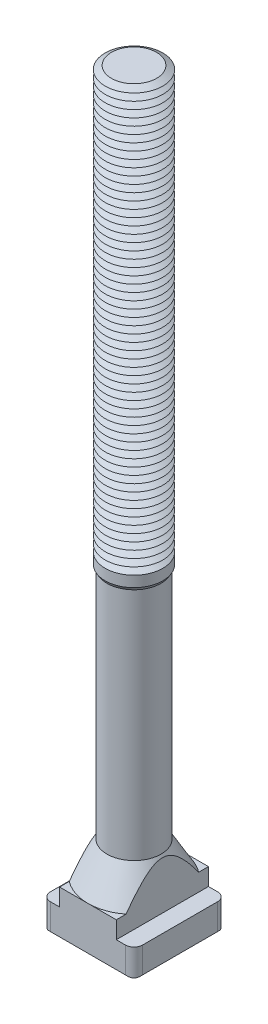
ISO-10303-21;
HEADER;
FILE_DESCRIPTION(('STEP AP214'),'2;1');
FILE_NAME('part.step','',(''),(''),'','','');
FILE_SCHEMA(('AUTOMOTIVE_DESIGN { 1 0 10303 214 1 1 1 1 }'));
ENDSEC;
DATA;
#1=APPLICATION_CONTEXT('core data for automotive mechanical design processes');
#2=APPLICATION_PROTOCOL_DEFINITION('international standard','automotive_design',2000,#1);
#3=PRODUCT_CONTEXT('',#1,'mechanical');
#4=PRODUCT('Part','Part','',(#3));
#5=PRODUCT_RELATED_PRODUCT_CATEGORY('part','',(#4));
#6=PRODUCT_DEFINITION_FORMATION('','',#4);
#7=PRODUCT_DEFINITION_CONTEXT('part definition',#1,'design');
#8=PRODUCT_DEFINITION('design','',#6,#7);
#9=PRODUCT_DEFINITION_SHAPE('','',#8);
#10=(LENGTH_UNIT() NAMED_UNIT(*) SI_UNIT(.MILLI.,.METRE.));
#11=(NAMED_UNIT(*) PLANE_ANGLE_UNIT() SI_UNIT($,.RADIAN.));
#12=(NAMED_UNIT(*) SI_UNIT($,.STERADIAN.) SOLID_ANGLE_UNIT());
#13=UNCERTAINTY_MEASURE_WITH_UNIT(LENGTH_MEASURE(1.E-05),#10,'distance_accuracy_value','');
#14=(GEOMETRIC_REPRESENTATION_CONTEXT(3) GLOBAL_UNCERTAINTY_ASSIGNED_CONTEXT((#13)) GLOBAL_UNIT_ASSIGNED_CONTEXT((#10,
#11,#12)) REPRESENTATION_CONTEXT('',''));
#15=CARTESIAN_POINT('',(0.,0.,0.));
#16=DIRECTION('',(0.,0.,1.));
#17=DIRECTION('',(1.,0.,0.));
#18=AXIS2_PLACEMENT_3D('',#15,#16,#17);
#19=CARTESIAN_POINT('',(0.,252.,0.));
#20=DIRECTION('',(0.,-1.,0.));
#21=DIRECTION('',(0.,0.,-1.));
#22=AXIS2_PLACEMENT_3D('',#19,#20,#21);
#23=CONICAL_SURFACE('',#22,7.83493649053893,1.04719755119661);
#24=CARTESIAN_POINT('',(0.,250.75,0.));
#25=DIRECTION('',(0.,-1.,0.));
#26=DIRECTION('',(0.,0.,-1.));
#27=AXIS2_PLACEMENT_3D('',#24,#25,#26);
#28=CIRCLE('',#27,10.);
#29=CARTESIAN_POINT('',(0.,250.75,-10.));
#30=VERTEX_POINT('',#29);
#31=EDGE_CURVE('E949',#30,#30,#28,.T.);
#32=ORIENTED_EDGE('',*,*,#31,.F.);
#33=EDGE_LOOP('',(#32));
#34=FACE_BOUND('',#33,.T.);
#35=CARTESIAN_POINT('',(0.,252.,0.));
#36=DIRECTION('',(0.,-1.,0.));
#37=DIRECTION('',(0.,0.,-1.));
#38=AXIS2_PLACEMENT_3D('',#35,#36,#37);
#39=CIRCLE('',#38,7.83493649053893);
#40=CARTESIAN_POINT('',(0.,252.,-7.83493649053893));
#41=VERTEX_POINT('',#40);
#42=EDGE_CURVE('E953',#41,#41,#39,.T.);
#43=ORIENTED_EDGE('',*,*,#42,.T.);
#44=EDGE_LOOP('',(#43));
#45=FACE_BOUND('',#44,.T.);
#46=ADVANCED_FACE('F39',(#34,#45),#23,.T.);
#47=CARTESIAN_POINT('',(0.,253.25,0.));
#48=DIRECTION('',(0.,1.,0.));
#49=DIRECTION('',(0.,0.,1.));
#50=AXIS2_PLACEMENT_3D('',#47,#48,#49);
#51=CONICAL_SURFACE('',#50,10.,1.04719755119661);
#52=ORIENTED_EDGE('',*,*,#42,.F.);
#53=EDGE_LOOP('',(#52));
#54=FACE_BOUND('',#53,.T.);
#55=CARTESIAN_POINT('',(0.,253.25,0.));
#56=DIRECTION('',(0.,-1.,0.));
#57=DIRECTION('',(0.,0.,-1.));
#58=AXIS2_PLACEMENT_3D('',#55,#56,#57);
#59=CIRCLE('',#58,10.);
#60=CARTESIAN_POINT('',(0.,253.25,-10.));
#61=VERTEX_POINT('',#60);
#62=EDGE_CURVE('E812',#61,#61,#59,.T.);
#63=ORIENTED_EDGE('',*,*,#62,.T.);
#64=EDGE_LOOP('',(#63));
#65=FACE_BOUND('',#64,.T.);
#66=ADVANCED_FACE('F449',(#54,#65),#51,.T.);
#67=CARTESIAN_POINT('',(4.8332509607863,262.,0.));
#68=DIRECTION('',(0.,-1.,0.));
#69=DIRECTION('',(1.,0.,0.));
#70=AXIS2_PLACEMENT_3D('',#67,#68,#69);
#71=PLANE('',#70);
#72=CARTESIAN_POINT('',(0.,262.,0.));
#73=DIRECTION('',(0.,-1.,0.));
#74=DIRECTION('',(0.,0.,-1.));
#75=AXIS2_PLACEMENT_3D('',#72,#73,#74);
#76=CIRCLE('',#75,7.83493649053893);
#77=CARTESIAN_POINT('',(0.,262.,-7.83493649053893));
#78=VERTEX_POINT('',#77);
#79=EDGE_CURVE('E727',#78,#78,#76,.T.);
#80=ORIENTED_EDGE('',*,*,#79,.F.);
#81=EDGE_LOOP('',(#80));
#82=FACE_BOUND('',#81,.T.);
#83=ADVANCED_FACE('F455',(#82),#71,.F.);
#84=CARTESIAN_POINT('',(0.,262.,0.));
#85=DIRECTION('',(0.,-1.,0.));
#86=DIRECTION('',(0.,0.,-1.));
#87=AXIS2_PLACEMENT_3D('',#84,#85,#86);
#88=CONICAL_SURFACE('',#87,7.83493649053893,1.04719755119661);
#89=CARTESIAN_POINT('',(0.,260.75,0.));
#90=DIRECTION('',(0.,-1.,0.));
#91=DIRECTION('',(0.,0.,-1.));
#92=AXIS2_PLACEMENT_3D('',#89,#90,#91);
#93=CIRCLE('',#92,10.);
#94=CARTESIAN_POINT('',(0.,260.75,-10.));
#95=VERTEX_POINT('',#94);
#96=EDGE_CURVE('E725',#95,#95,#93,.T.);
#97=ORIENTED_EDGE('',*,*,#96,.F.);
#98=EDGE_LOOP('',(#97));
#99=FACE_BOUND('',#98,.T.);
#100=ORIENTED_EDGE('',*,*,#79,.T.);
#101=EDGE_LOOP('',(#100));
#102=FACE_BOUND('',#101,.T.);
#103=ADVANCED_FACE('F483',(#99,#102),#88,.T.);
#104=CARTESIAN_POINT('',(0.,260.75,0.));
#105=DIRECTION('',(0.,1.,0.));
#106=DIRECTION('',(0.,0.,1.));
#107=AXIS2_PLACEMENT_3D('',#104,#105,#106);
#108=CONICAL_SURFACE('',#107,10.,1.04719755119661);
#109=CARTESIAN_POINT('',(0.,259.5,0.));
#110=DIRECTION('',(0.,-1.,0.));
#111=DIRECTION('',(0.,0.,-1.));
#112=AXIS2_PLACEMENT_3D('',#109,#110,#111);
#113=CIRCLE('',#112,7.83493649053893);
#114=CARTESIAN_POINT('',(0.,259.5,-7.83493649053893));
#115=VERTEX_POINT('',#114);
#116=EDGE_CURVE('E728',#115,#115,#113,.T.);
#117=ORIENTED_EDGE('',*,*,#116,.F.);
#118=EDGE_LOOP('',(#117));
#119=FACE_BOUND('',#118,.T.);
#120=ORIENTED_EDGE('',*,*,#96,.T.);
#121=EDGE_LOOP('',(#120));
#122=FACE_BOUND('',#121,.T.);
#123=ADVANCED_FACE('F480',(#119,#122),#108,.T.);
#124=CARTESIAN_POINT('',(0.,259.5,0.));
#125=DIRECTION('',(0.,-1.,0.));
#126=DIRECTION('',(0.,0.,-1.));
#127=AXIS2_PLACEMENT_3D('',#124,#125,#126);
#128=CONICAL_SURFACE('',#127,7.83493649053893,1.04719755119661);
#129=CARTESIAN_POINT('',(0.,258.25,0.));
#130=DIRECTION('',(0.,-1.,0.));
#131=DIRECTION('',(0.,0.,-1.));
#132=AXIS2_PLACEMENT_3D('',#129,#130,#131);
#133=CIRCLE('',#132,10.);
#134=CARTESIAN_POINT('',(0.,258.25,-10.));
#135=VERTEX_POINT('',#134);
#136=EDGE_CURVE('E888',#135,#135,#133,.T.);
#137=ORIENTED_EDGE('',*,*,#136,.F.);
#138=EDGE_LOOP('',(#137));
#139=FACE_BOUND('',#138,.T.);
#140=ORIENTED_EDGE('',*,*,#116,.T.);
#141=EDGE_LOOP('',(#140));
#142=FACE_BOUND('',#141,.T.);
#143=ADVANCED_FACE('F475',(#139,#142),#128,.T.);
#144=CARTESIAN_POINT('',(0.,258.25,0.));
#145=DIRECTION('',(0.,1.,0.));
#146=DIRECTION('',(0.,0.,1.));
#147=AXIS2_PLACEMENT_3D('',#144,#145,#146);
#148=CONICAL_SURFACE('',#147,10.,1.04719755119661);
#149=CARTESIAN_POINT('',(0.,257.,0.));
#150=DIRECTION('',(0.,-1.,0.));
#151=DIRECTION('',(0.,0.,-1.));
#152=AXIS2_PLACEMENT_3D('',#149,#150,#151);
#153=CIRCLE('',#152,7.83493649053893);
#154=CARTESIAN_POINT('',(0.,257.,-7.83493649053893));
#155=VERTEX_POINT('',#154);
#156=EDGE_CURVE('E963',#155,#155,#153,.T.);
#157=ORIENTED_EDGE('',*,*,#156,.F.);
#158=EDGE_LOOP('',(#157));
#159=FACE_BOUND('',#158,.T.);
#160=ORIENTED_EDGE('',*,*,#136,.T.);
#161=EDGE_LOOP('',(#160));
#162=FACE_BOUND('',#161,.T.);
#163=ADVANCED_FACE('F472',(#159,#162),#148,.T.);
#164=CARTESIAN_POINT('',(0.,257.,0.));
#165=DIRECTION('',(0.,-1.,0.));
#166=DIRECTION('',(0.,0.,-1.));
#167=AXIS2_PLACEMENT_3D('',#164,#165,#166);
#168=CONICAL_SURFACE('',#167,7.83493649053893,1.04719755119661);
#169=CARTESIAN_POINT('',(0.,255.75,0.));
#170=DIRECTION('',(0.,-1.,0.));
#171=DIRECTION('',(0.,0.,-1.));
#172=AXIS2_PLACEMENT_3D('',#169,#170,#171);
#173=CIRCLE('',#172,10.);
#174=CARTESIAN_POINT('',(0.,255.75,-10.));
#175=VERTEX_POINT('',#174);
#176=EDGE_CURVE('E811',#175,#175,#173,.T.);
#177=ORIENTED_EDGE('',*,*,#176,.F.);
#178=EDGE_LOOP('',(#177));
#179=FACE_BOUND('',#178,.T.);
#180=ORIENTED_EDGE('',*,*,#156,.T.);
#181=EDGE_LOOP('',(#180));
#182=FACE_BOUND('',#181,.T.);
#183=ADVANCED_FACE('F466',(#179,#182),#168,.T.);
#184=CARTESIAN_POINT('',(0.,255.75,0.));
#185=DIRECTION('',(0.,1.,0.));
#186=DIRECTION('',(0.,0.,1.));
#187=AXIS2_PLACEMENT_3D('',#184,#185,#186);
#188=CONICAL_SURFACE('',#187,10.,1.04719755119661);
#189=CARTESIAN_POINT('',(0.,254.5,0.));
#190=DIRECTION('',(0.,-1.,0.));
#191=DIRECTION('',(0.,0.,-1.));
#192=AXIS2_PLACEMENT_3D('',#189,#190,#191);
#193=CIRCLE('',#192,7.83493649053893);
#194=CARTESIAN_POINT('',(0.,254.5,-7.83493649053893));
#195=VERTEX_POINT('',#194);
#196=EDGE_CURVE('E809',#195,#195,#193,.T.);
#197=ORIENTED_EDGE('',*,*,#196,.F.);
#198=EDGE_LOOP('',(#197));
#199=FACE_BOUND('',#198,.T.);
#200=ORIENTED_EDGE('',*,*,#176,.T.);
#201=EDGE_LOOP('',(#200));
#202=FACE_BOUND('',#201,.T.);
#203=ADVANCED_FACE('F462',(#199,#202),#188,.T.);
#204=CARTESIAN_POINT('',(0.,254.5,0.));
#205=DIRECTION('',(0.,-1.,0.));
#206=DIRECTION('',(0.,0.,-1.));
#207=AXIS2_PLACEMENT_3D('',#204,#205,#206);
#208=CONICAL_SURFACE('',#207,7.83493649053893,1.04719755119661);
#209=ORIENTED_EDGE('',*,*,#62,.F.);
#210=EDGE_LOOP('',(#209));
#211=FACE_BOUND('',#210,.T.);
#212=ORIENTED_EDGE('',*,*,#196,.T.);
#213=EDGE_LOOP('',(#212));
#214=FACE_BOUND('',#213,.T.);
#215=ADVANCED_FACE('F465',(#211,#214),#208,.T.);
#216=CARTESIAN_POINT('',(0.,249.5,0.));
#217=DIRECTION('',(0.,-1.,0.));
#218=DIRECTION('',(0.,0.,-1.));
#219=AXIS2_PLACEMENT_3D('',#216,#217,#218);
#220=CONICAL_SURFACE('',#219,7.83493649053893,1.04719755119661);
#221=CARTESIAN_POINT('',(0.,248.25,0.));
#222=DIRECTION('',(0.,-1.,0.));
#223=DIRECTION('',(0.,0.,-1.));
#224=AXIS2_PLACEMENT_3D('',#221,#222,#223);
#225=CIRCLE('',#224,10.);
#226=CARTESIAN_POINT('',(0.,248.25,-10.));
#227=VERTEX_POINT('',#226);
#228=EDGE_CURVE('E806',#227,#227,#225,.T.);
#229=ORIENTED_EDGE('',*,*,#228,.F.);
#230=EDGE_LOOP('',(#229));
#231=FACE_BOUND('',#230,.T.);
#232=CARTESIAN_POINT('',(0.,249.5,0.));
#233=DIRECTION('',(0.,-1.,0.));
#234=DIRECTION('',(0.,0.,-1.));
#235=AXIS2_PLACEMENT_3D('',#232,#233,#234);
#236=CIRCLE('',#235,7.83493649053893);
#237=CARTESIAN_POINT('',(0.,249.5,-7.83493649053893));
#238=VERTEX_POINT('',#237);
#239=EDGE_CURVE('E945',#238,#238,#236,.T.);
#240=ORIENTED_EDGE('',*,*,#239,.T.);
#241=EDGE_LOOP('',(#240));
#242=FACE_BOUND('',#241,.T.);
#243=ADVANCED_FACE('F470',(#231,#242),#220,.T.);
#244=CARTESIAN_POINT('',(0.,250.75,0.));
#245=DIRECTION('',(0.,1.,0.));
#246=DIRECTION('',(0.,0.,1.));
#247=AXIS2_PLACEMENT_3D('',#244,#245,#246);
#248=CONICAL_SURFACE('',#247,10.,1.04719755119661);
#249=ORIENTED_EDGE('',*,*,#239,.F.);
#250=EDGE_LOOP('',(#249));
#251=FACE_BOUND('',#250,.T.);
#252=ORIENTED_EDGE('',*,*,#31,.T.);
#253=EDGE_LOOP('',(#252));
#254=FACE_BOUND('',#253,.T.);
#255=ADVANCED_FACE('F1130',(#251,#254),#248,.T.);
#256=CARTESIAN_POINT('',(0.,247.,0.));
#257=DIRECTION('',(0.,-1.,0.));
#258=DIRECTION('',(0.,0.,-1.));
#259=AXIS2_PLACEMENT_3D('',#256,#257,#258);
#260=CONICAL_SURFACE('',#259,7.83493649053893,1.04719755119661);
#261=CARTESIAN_POINT('',(0.,245.75,0.));
#262=DIRECTION('',(0.,-1.,0.));
#263=DIRECTION('',(0.,0.,-1.));
#264=AXIS2_PLACEMENT_3D('',#261,#262,#263);
#265=CIRCLE('',#264,10.);
#266=CARTESIAN_POINT('',(0.,245.75,-10.));
#267=VERTEX_POINT('',#266);
#268=EDGE_CURVE('E807',#267,#267,#265,.T.);
#269=ORIENTED_EDGE('',*,*,#268,.F.);
#270=EDGE_LOOP('',(#269));
#271=FACE_BOUND('',#270,.T.);
#272=CARTESIAN_POINT('',(0.,247.,0.));
#273=DIRECTION('',(0.,-1.,0.));
#274=DIRECTION('',(0.,0.,-1.));
#275=AXIS2_PLACEMENT_3D('',#272,#273,#274);
#276=CIRCLE('',#275,7.83493649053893);
#277=CARTESIAN_POINT('',(0.,247.,-7.83493649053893));
#278=VERTEX_POINT('',#277);
#279=EDGE_CURVE('E803',#278,#278,#276,.T.);
#280=ORIENTED_EDGE('',*,*,#279,.T.);
#281=EDGE_LOOP('',(#280));
#282=FACE_BOUND('',#281,.T.);
#283=ADVANCED_FACE('F1126',(#271,#282),#260,.T.);
#284=CARTESIAN_POINT('',(0.,248.25,0.));
#285=DIRECTION('',(0.,1.,0.));
#286=DIRECTION('',(0.,0.,1.));
#287=AXIS2_PLACEMENT_3D('',#284,#285,#286);
#288=CONICAL_SURFACE('',#287,10.,1.04719755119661);
#289=ORIENTED_EDGE('',*,*,#279,.F.);
#290=EDGE_LOOP('',(#289));
#291=FACE_BOUND('',#290,.T.);
#292=ORIENTED_EDGE('',*,*,#228,.T.);
#293=EDGE_LOOP('',(#292));
#294=FACE_BOUND('',#293,.T.);
#295=ADVANCED_FACE('F1122',(#291,#294),#288,.T.);
#296=CARTESIAN_POINT('',(0.,244.5,0.));
#297=DIRECTION('',(0.,-1.,0.));
#298=DIRECTION('',(0.,0.,-1.));
#299=AXIS2_PLACEMENT_3D('',#296,#297,#298);
#300=CONICAL_SURFACE('',#299,7.83493649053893,1.04719755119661);
#301=CARTESIAN_POINT('',(0.,243.25,0.));
#302=DIRECTION('',(0.,-1.,0.));
#303=DIRECTION('',(0.,0.,-1.));
#304=AXIS2_PLACEMENT_3D('',#301,#302,#303);
#305=CIRCLE('',#304,10.);
#306=CARTESIAN_POINT('',(0.,243.25,-10.));
#307=VERTEX_POINT('',#306);
#308=EDGE_CURVE('E858',#307,#307,#305,.T.);
#309=ORIENTED_EDGE('',*,*,#308,.F.);
#310=EDGE_LOOP('',(#309));
#311=FACE_BOUND('',#310,.T.);
#312=CARTESIAN_POINT('',(0.,244.5,0.));
#313=DIRECTION('',(0.,-1.,0.));
#314=DIRECTION('',(0.,0.,-1.));
#315=AXIS2_PLACEMENT_3D('',#312,#313,#314);
#316=CIRCLE('',#315,7.83493649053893);
#317=CARTESIAN_POINT('',(0.,244.5,-7.83493649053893));
#318=VERTEX_POINT('',#317);
#319=EDGE_CURVE('E936',#318,#318,#316,.T.);
#320=ORIENTED_EDGE('',*,*,#319,.T.);
#321=EDGE_LOOP('',(#320));
#322=FACE_BOUND('',#321,.T.);
#323=ADVANCED_FACE('F1118',(#311,#322),#300,.T.);
#324=CARTESIAN_POINT('',(0.,245.75,0.));
#325=DIRECTION('',(0.,1.,0.));
#326=DIRECTION('',(0.,0.,1.));
#327=AXIS2_PLACEMENT_3D('',#324,#325,#326);
#328=CONICAL_SURFACE('',#327,10.,1.04719755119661);
#329=ORIENTED_EDGE('',*,*,#319,.F.);
#330=EDGE_LOOP('',(#329));
#331=FACE_BOUND('',#330,.T.);
#332=ORIENTED_EDGE('',*,*,#268,.T.);
#333=EDGE_LOOP('',(#332));
#334=FACE_BOUND('',#333,.T.);
#335=ADVANCED_FACE('F1114',(#331,#334),#328,.T.);
#336=CARTESIAN_POINT('',(0.,242.,0.));
#337=DIRECTION('',(0.,-1.,0.));
#338=DIRECTION('',(0.,0.,-1.));
#339=AXIS2_PLACEMENT_3D('',#336,#337,#338);
#340=CONICAL_SURFACE('',#339,7.83493649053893,1.04719755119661);
#341=CARTESIAN_POINT('',(0.,240.75,0.));
#342=DIRECTION('',(0.,-1.,0.));
#343=DIRECTION('',(0.,0.,-1.));
#344=AXIS2_PLACEMENT_3D('',#341,#342,#343);
#345=CIRCLE('',#344,10.);
#346=CARTESIAN_POINT('',(0.,240.75,-10.));
#347=VERTEX_POINT('',#346);
#348=EDGE_CURVE('E670',#347,#347,#345,.T.);
#349=ORIENTED_EDGE('',*,*,#348,.F.);
#350=EDGE_LOOP('',(#349));
#351=FACE_BOUND('',#350,.T.);
#352=CARTESIAN_POINT('',(0.,242.,0.));
#353=DIRECTION('',(0.,-1.,0.));
#354=DIRECTION('',(0.,0.,-1.));
#355=AXIS2_PLACEMENT_3D('',#352,#353,#354);
#356=CIRCLE('',#355,7.83493649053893);
#357=CARTESIAN_POINT('',(0.,242.,-7.83493649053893));
#358=VERTEX_POINT('',#357);
#359=EDGE_CURVE('E673',#358,#358,#356,.T.);
#360=ORIENTED_EDGE('',*,*,#359,.T.);
#361=EDGE_LOOP('',(#360));
#362=FACE_BOUND('',#361,.T.);
#363=ADVANCED_FACE('F1110',(#351,#362),#340,.T.);
#364=CARTESIAN_POINT('',(0.,243.25,0.));
#365=DIRECTION('',(0.,1.,0.));
#366=DIRECTION('',(0.,0.,1.));
#367=AXIS2_PLACEMENT_3D('',#364,#365,#366);
#368=CONICAL_SURFACE('',#367,10.,1.04719755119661);
#369=ORIENTED_EDGE('',*,*,#359,.F.);
#370=EDGE_LOOP('',(#369));
#371=FACE_BOUND('',#370,.T.);
#372=ORIENTED_EDGE('',*,*,#308,.T.);
#373=EDGE_LOOP('',(#372));
#374=FACE_BOUND('',#373,.T.);
#375=ADVANCED_FACE('F1106',(#371,#374),#368,.T.);
#376=CARTESIAN_POINT('',(0.,239.5,0.));
#377=DIRECTION('',(0.,-1.,0.));
#378=DIRECTION('',(0.,0.,-1.));
#379=AXIS2_PLACEMENT_3D('',#376,#377,#378);
#380=CONICAL_SURFACE('',#379,7.83493649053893,1.04719755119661);
#381=CARTESIAN_POINT('',(0.,238.25,0.));
#382=DIRECTION('',(0.,-1.,0.));
#383=DIRECTION('',(0.,0.,-1.));
#384=AXIS2_PLACEMENT_3D('',#381,#382,#383);
#385=CIRCLE('',#384,10.);
#386=CARTESIAN_POINT('',(0.,238.25,-10.));
#387=VERTEX_POINT('',#386);
#388=EDGE_CURVE('E720',#387,#387,#385,.T.);
#389=ORIENTED_EDGE('',*,*,#388,.F.);
#390=EDGE_LOOP('',(#389));
#391=FACE_BOUND('',#390,.T.);
#392=CARTESIAN_POINT('',(0.,239.5,0.));
#393=DIRECTION('',(0.,-1.,0.));
#394=DIRECTION('',(0.,0.,-1.));
#395=AXIS2_PLACEMENT_3D('',#392,#393,#394);
#396=CIRCLE('',#395,7.83493649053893);
#397=CARTESIAN_POINT('',(0.,239.5,-7.83493649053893));
#398=VERTEX_POINT('',#397);
#399=EDGE_CURVE('E674',#398,#398,#396,.T.);
#400=ORIENTED_EDGE('',*,*,#399,.T.);
#401=EDGE_LOOP('',(#400));
#402=FACE_BOUND('',#401,.T.);
#403=ADVANCED_FACE('F1102',(#391,#402),#380,.T.);
#404=CARTESIAN_POINT('',(0.,240.75,0.));
#405=DIRECTION('',(0.,1.,0.));
#406=DIRECTION('',(0.,0.,1.));
#407=AXIS2_PLACEMENT_3D('',#404,#405,#406);
#408=CONICAL_SURFACE('',#407,10.,1.04719755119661);
#409=ORIENTED_EDGE('',*,*,#399,.F.);
#410=EDGE_LOOP('',(#409));
#411=FACE_BOUND('',#410,.T.);
#412=ORIENTED_EDGE('',*,*,#348,.T.);
#413=EDGE_LOOP('',(#412));
#414=FACE_BOUND('',#413,.T.);
#415=ADVANCED_FACE('F1098',(#411,#414),#408,.T.);
#416=CARTESIAN_POINT('',(0.,237.,0.));
#417=DIRECTION('',(0.,-1.,0.));
#418=DIRECTION('',(0.,0.,-1.));
#419=AXIS2_PLACEMENT_3D('',#416,#417,#418);
#420=CONICAL_SURFACE('',#419,7.83493649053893,1.04719755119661);
#421=CARTESIAN_POINT('',(0.,235.75,0.));
#422=DIRECTION('',(0.,-1.,0.));
#423=DIRECTION('',(0.,0.,-1.));
#424=AXIS2_PLACEMENT_3D('',#421,#422,#423);
#425=CIRCLE('',#424,10.);
#426=CARTESIAN_POINT('',(0.,235.75,-10.));
#427=VERTEX_POINT('',#426);
#428=EDGE_CURVE('E926',#427,#427,#425,.T.);
#429=ORIENTED_EDGE('',*,*,#428,.F.);
#430=EDGE_LOOP('',(#429));
#431=FACE_BOUND('',#430,.T.);
#432=CARTESIAN_POINT('',(0.,237.,0.));
#433=DIRECTION('',(0.,-1.,0.));
#434=DIRECTION('',(0.,0.,-1.));
#435=AXIS2_PLACEMENT_3D('',#432,#433,#434);
#436=CIRCLE('',#435,7.83493649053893);
#437=CARTESIAN_POINT('',(0.,237.,-7.83493649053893));
#438=VERTEX_POINT('',#437);
#439=EDGE_CURVE('E723',#438,#438,#436,.T.);
#440=ORIENTED_EDGE('',*,*,#439,.T.);
#441=EDGE_LOOP('',(#440));
#442=FACE_BOUND('',#441,.T.);
#443=ADVANCED_FACE('F1094',(#431,#442),#420,.T.);
#444=CARTESIAN_POINT('',(0.,238.25,0.));
#445=DIRECTION('',(0.,1.,0.));
#446=DIRECTION('',(0.,0.,1.));
#447=AXIS2_PLACEMENT_3D('',#444,#445,#446);
#448=CONICAL_SURFACE('',#447,10.,1.04719755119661);
#449=ORIENTED_EDGE('',*,*,#439,.F.);
#450=EDGE_LOOP('',(#449));
#451=FACE_BOUND('',#450,.T.);
#452=ORIENTED_EDGE('',*,*,#388,.T.);
#453=EDGE_LOOP('',(#452));
#454=FACE_BOUND('',#453,.T.);
#455=ADVANCED_FACE('F1090',(#451,#454),#448,.T.);
#456=CARTESIAN_POINT('',(0.,234.5,0.));
#457=DIRECTION('',(0.,-1.,0.));
#458=DIRECTION('',(0.,0.,-1.));
#459=AXIS2_PLACEMENT_3D('',#456,#457,#458);
#460=CONICAL_SURFACE('',#459,7.83493649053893,1.04719755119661);
#461=CARTESIAN_POINT('',(0.,233.25,0.));
#462=DIRECTION('',(0.,-1.,0.));
#463=DIRECTION('',(0.,0.,-1.));
#464=AXIS2_PLACEMENT_3D('',#461,#462,#463);
#465=CIRCLE('',#464,10.);
#466=CARTESIAN_POINT('',(0.,233.25,-10.));
#467=VERTEX_POINT('',#466);
#468=EDGE_CURVE('E918',#467,#467,#465,.T.);
#469=ORIENTED_EDGE('',*,*,#468,.F.);
#470=EDGE_LOOP('',(#469));
#471=FACE_BOUND('',#470,.T.);
#472=CARTESIAN_POINT('',(0.,234.5,0.));
#473=DIRECTION('',(0.,-1.,0.));
#474=DIRECTION('',(0.,0.,-1.));
#475=AXIS2_PLACEMENT_3D('',#472,#473,#474);
#476=CIRCLE('',#475,7.83493649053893);
#477=CARTESIAN_POINT('',(0.,234.5,-7.83493649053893));
#478=VERTEX_POINT('',#477);
#479=EDGE_CURVE('E922',#478,#478,#476,.T.);
#480=ORIENTED_EDGE('',*,*,#479,.T.);
#481=EDGE_LOOP('',(#480));
#482=FACE_BOUND('',#481,.T.);
#483=ADVANCED_FACE('F1086',(#471,#482),#460,.T.);
#484=CARTESIAN_POINT('',(0.,235.75,0.));
#485=DIRECTION('',(0.,1.,0.));
#486=DIRECTION('',(0.,0.,1.));
#487=AXIS2_PLACEMENT_3D('',#484,#485,#486);
#488=CONICAL_SURFACE('',#487,10.,1.04719755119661);
#489=ORIENTED_EDGE('',*,*,#479,.F.);
#490=EDGE_LOOP('',(#489));
#491=FACE_BOUND('',#490,.T.);
#492=ORIENTED_EDGE('',*,*,#428,.T.);
#493=EDGE_LOOP('',(#492));
#494=FACE_BOUND('',#493,.T.);
#495=ADVANCED_FACE('F1082',(#491,#494),#488,.T.);
#496=CARTESIAN_POINT('',(0.,232.,0.));
#497=DIRECTION('',(0.,-1.,0.));
#498=DIRECTION('',(0.,0.,-1.));
#499=AXIS2_PLACEMENT_3D('',#496,#497,#498);
#500=CONICAL_SURFACE('',#499,7.83493649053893,1.04719755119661);
#501=CARTESIAN_POINT('',(0.,230.75,0.));
#502=DIRECTION('',(0.,-1.,0.));
#503=DIRECTION('',(0.,0.,-1.));
#504=AXIS2_PLACEMENT_3D('',#501,#502,#503);
#505=CIRCLE('',#504,10.);
#506=CARTESIAN_POINT('',(0.,230.75,-10.));
#507=VERTEX_POINT('',#506);
#508=EDGE_CURVE('E826',#507,#507,#505,.T.);
#509=ORIENTED_EDGE('',*,*,#508,.F.);
#510=EDGE_LOOP('',(#509));
#511=FACE_BOUND('',#510,.T.);
#512=CARTESIAN_POINT('',(0.,232.,0.));
#513=DIRECTION('',(0.,-1.,0.));
#514=DIRECTION('',(0.,0.,-1.));
#515=AXIS2_PLACEMENT_3D('',#512,#513,#514);
#516=CIRCLE('',#515,7.83493649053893);
#517=CARTESIAN_POINT('',(0.,232.,-7.83493649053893));
#518=VERTEX_POINT('',#517);
#519=EDGE_CURVE('E828',#518,#518,#516,.T.);
#520=ORIENTED_EDGE('',*,*,#519,.T.);
#521=EDGE_LOOP('',(#520));
#522=FACE_BOUND('',#521,.T.);
#523=ADVANCED_FACE('F1078',(#511,#522),#500,.T.);
#524=CARTESIAN_POINT('',(0.,233.25,0.));
#525=DIRECTION('',(0.,1.,0.));
#526=DIRECTION('',(0.,0.,1.));
#527=AXIS2_PLACEMENT_3D('',#524,#525,#526);
#528=CONICAL_SURFACE('',#527,10.,1.04719755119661);
#529=ORIENTED_EDGE('',*,*,#519,.F.);
#530=EDGE_LOOP('',(#529));
#531=FACE_BOUND('',#530,.T.);
#532=ORIENTED_EDGE('',*,*,#468,.T.);
#533=EDGE_LOOP('',(#532));
#534=FACE_BOUND('',#533,.T.);
#535=ADVANCED_FACE('F1074',(#531,#534),#528,.T.);
#536=CARTESIAN_POINT('',(0.,229.5,0.));
#537=DIRECTION('',(0.,-1.,0.));
#538=DIRECTION('',(0.,0.,-1.));
#539=AXIS2_PLACEMENT_3D('',#536,#537,#538);
#540=CONICAL_SURFACE('',#539,7.83493649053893,1.04719755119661);
#541=CARTESIAN_POINT('',(0.,228.25,0.));
#542=DIRECTION('',(0.,-1.,0.));
#543=DIRECTION('',(0.,0.,-1.));
#544=AXIS2_PLACEMENT_3D('',#541,#542,#543);
#545=CIRCLE('',#544,10.);
#546=CARTESIAN_POINT('',(0.,228.25,-10.));
#547=VERTEX_POINT('',#546);
#548=EDGE_CURVE('E904',#547,#547,#545,.T.);
#549=ORIENTED_EDGE('',*,*,#548,.F.);
#550=EDGE_LOOP('',(#549));
#551=FACE_BOUND('',#550,.T.);
#552=CARTESIAN_POINT('',(0.,229.5,0.));
#553=DIRECTION('',(0.,-1.,0.));
#554=DIRECTION('',(0.,0.,-1.));
#555=AXIS2_PLACEMENT_3D('',#552,#553,#554);
#556=CIRCLE('',#555,7.83493649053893);
#557=CARTESIAN_POINT('',(0.,229.5,-7.83493649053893));
#558=VERTEX_POINT('',#557);
#559=EDGE_CURVE('E829',#558,#558,#556,.T.);
#560=ORIENTED_EDGE('',*,*,#559,.T.);
#561=EDGE_LOOP('',(#560));
#562=FACE_BOUND('',#561,.T.);
#563=ADVANCED_FACE('F1068',(#551,#562),#540,.T.);
#564=CARTESIAN_POINT('',(0.,230.75,0.));
#565=DIRECTION('',(0.,1.,0.));
#566=DIRECTION('',(0.,0.,1.));
#567=AXIS2_PLACEMENT_3D('',#564,#565,#566);
#568=CONICAL_SURFACE('',#567,10.,1.04719755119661);
#569=ORIENTED_EDGE('',*,*,#559,.F.);
#570=EDGE_LOOP('',(#569));
#571=FACE_BOUND('',#570,.T.);
#572=ORIENTED_EDGE('',*,*,#508,.T.);
#573=EDGE_LOOP('',(#572));
#574=FACE_BOUND('',#573,.T.);
#575=ADVANCED_FACE('F1060',(#571,#574),#568,.T.);
#576=CARTESIAN_POINT('',(0.,227.,0.));
#577=DIRECTION('',(0.,-1.,0.));
#578=DIRECTION('',(0.,0.,-1.));
#579=AXIS2_PLACEMENT_3D('',#576,#577,#578);
#580=CONICAL_SURFACE('',#579,7.83493649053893,1.04719755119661);
#581=CARTESIAN_POINT('',(0.,225.75,0.));
#582=DIRECTION('',(0.,-1.,0.));
#583=DIRECTION('',(0.,0.,-1.));
#584=AXIS2_PLACEMENT_3D('',#581,#582,#583);
#585=CIRCLE('',#584,10.);
#586=CARTESIAN_POINT('',(0.,225.75,-10.));
#587=VERTEX_POINT('',#586);
#588=EDGE_CURVE('E667',#587,#587,#585,.T.);
#589=ORIENTED_EDGE('',*,*,#588,.F.);
#590=EDGE_LOOP('',(#589));
#591=FACE_BOUND('',#590,.T.);
#592=CARTESIAN_POINT('',(0.,227.,0.));
#593=DIRECTION('',(0.,-1.,0.));
#594=DIRECTION('',(0.,0.,-1.));
#595=AXIS2_PLACEMENT_3D('',#592,#593,#594);
#596=CIRCLE('',#595,7.83493649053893);
#597=CARTESIAN_POINT('',(0.,227.,-7.83493649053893));
#598=VERTEX_POINT('',#597);
#599=EDGE_CURVE('E718',#598,#598,#596,.T.);
#600=ORIENTED_EDGE('',*,*,#599,.T.);
#601=EDGE_LOOP('',(#600));
#602=FACE_BOUND('',#601,.T.);
#603=ADVANCED_FACE('F1058',(#591,#602),#580,.T.);
#604=CARTESIAN_POINT('',(0.,228.25,0.));
#605=DIRECTION('',(0.,1.,0.));
#606=DIRECTION('',(0.,0.,1.));
#607=AXIS2_PLACEMENT_3D('',#604,#605,#606);
#608=CONICAL_SURFACE('',#607,10.,1.04719755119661);
#609=ORIENTED_EDGE('',*,*,#599,.F.);
#610=EDGE_LOOP('',(#609));
#611=FACE_BOUND('',#610,.T.);
#612=ORIENTED_EDGE('',*,*,#548,.T.);
#613=EDGE_LOOP('',(#612));
#614=FACE_BOUND('',#613,.T.);
#615=ADVANCED_FACE('F1048',(#611,#614),#608,.T.);
#616=CARTESIAN_POINT('',(0.,224.5,0.));
#617=DIRECTION('',(0.,-1.,0.));
#618=DIRECTION('',(0.,0.,-1.));
#619=AXIS2_PLACEMENT_3D('',#616,#617,#618);
#620=CONICAL_SURFACE('',#619,7.83493649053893,1.04719755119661);
#621=CARTESIAN_POINT('',(0.,223.25,0.));
#622=DIRECTION('',(0.,-1.,0.));
#623=DIRECTION('',(0.,0.,-1.));
#624=AXIS2_PLACEMENT_3D('',#621,#622,#623);
#625=CIRCLE('',#624,10.);
#626=CARTESIAN_POINT('',(0.,223.25,-10.));
#627=VERTEX_POINT('',#626);
#628=EDGE_CURVE('E668',#627,#627,#625,.T.);
#629=ORIENTED_EDGE('',*,*,#628,.F.);
#630=EDGE_LOOP('',(#629));
#631=FACE_BOUND('',#630,.T.);
#632=CARTESIAN_POINT('',(0.,224.5,0.));
#633=DIRECTION('',(0.,-1.,0.));
#634=DIRECTION('',(0.,0.,-1.));
#635=AXIS2_PLACEMENT_3D('',#632,#633,#634);
#636=CIRCLE('',#635,7.83493649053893);
#637=CARTESIAN_POINT('',(0.,224.5,-7.83493649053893));
#638=VERTEX_POINT('',#637);
#639=EDGE_CURVE('E664',#638,#638,#636,.T.);
#640=ORIENTED_EDGE('',*,*,#639,.T.);
#641=EDGE_LOOP('',(#640));
#642=FACE_BOUND('',#641,.T.);
#643=ADVANCED_FACE('F1044',(#631,#642),#620,.T.);
#644=CARTESIAN_POINT('',(0.,225.75,0.));
#645=DIRECTION('',(0.,1.,0.));
#646=DIRECTION('',(0.,0.,1.));
#647=AXIS2_PLACEMENT_3D('',#644,#645,#646);
#648=CONICAL_SURFACE('',#647,10.,1.04719755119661);
#649=ORIENTED_EDGE('',*,*,#639,.F.);
#650=EDGE_LOOP('',(#649));
#651=FACE_BOUND('',#650,.T.);
#652=ORIENTED_EDGE('',*,*,#588,.T.);
#653=EDGE_LOOP('',(#652));
#654=FACE_BOUND('',#653,.T.);
#655=ADVANCED_FACE('F1047',(#651,#654),#648,.T.);
#656=CARTESIAN_POINT('',(0.,222.,0.));
#657=DIRECTION('',(0.,-1.,0.));
#658=DIRECTION('',(0.,0.,-1.));
#659=AXIS2_PLACEMENT_3D('',#656,#657,#658);
#660=CONICAL_SURFACE('',#659,7.83493649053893,1.04719755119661);
#661=CARTESIAN_POINT('',(0.,220.75,0.));
#662=DIRECTION('',(0.,-1.,0.));
#663=DIRECTION('',(0.,0.,-1.));
#664=AXIS2_PLACEMENT_3D('',#661,#662,#663);
#665=CIRCLE('',#664,10.);
#666=CARTESIAN_POINT('',(0.,220.75,-10.));
#667=VERTEX_POINT('',#666);
#668=EDGE_CURVE('E658',#667,#667,#665,.T.);
#669=ORIENTED_EDGE('',*,*,#668,.F.);
#670=EDGE_LOOP('',(#669));
#671=FACE_BOUND('',#670,.T.);
#672=CARTESIAN_POINT('',(0.,222.,0.));
#673=DIRECTION('',(0.,-1.,0.));
#674=DIRECTION('',(0.,0.,-1.));
#675=AXIS2_PLACEMENT_3D('',#672,#673,#674);
#676=CIRCLE('',#675,7.83493649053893);
#677=CARTESIAN_POINT('',(0.,222.,-7.83493649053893));
#678=VERTEX_POINT('',#677);
#679=EDGE_CURVE('E661',#678,#678,#676,.T.);
#680=ORIENTED_EDGE('',*,*,#679,.T.);
#681=EDGE_LOOP('',(#680));
#682=FACE_BOUND('',#681,.T.);
#683=ADVANCED_FACE('F1054',(#671,#682),#660,.T.);
#684=CARTESIAN_POINT('',(0.,223.25,0.));
#685=DIRECTION('',(0.,1.,0.));
#686=DIRECTION('',(0.,0.,1.));
#687=AXIS2_PLACEMENT_3D('',#684,#685,#686);
#688=CONICAL_SURFACE('',#687,10.,1.04719755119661);
#689=ORIENTED_EDGE('',*,*,#679,.F.);
#690=EDGE_LOOP('',(#689));
#691=FACE_BOUND('',#690,.T.);
#692=ORIENTED_EDGE('',*,*,#628,.T.);
#693=EDGE_LOOP('',(#692));
#694=FACE_BOUND('',#693,.T.);
#695=ADVANCED_FACE('F1042',(#691,#694),#688,.T.);
#696=CARTESIAN_POINT('',(0.,219.5,0.));
#697=DIRECTION('',(0.,-1.,0.));
#698=DIRECTION('',(0.,0.,-1.));
#699=AXIS2_PLACEMENT_3D('',#696,#697,#698);
#700=CONICAL_SURFACE('',#699,7.83493649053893,1.04719755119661);
#701=CARTESIAN_POINT('',(0.,218.25,0.));
#702=DIRECTION('',(0.,-1.,0.));
#703=DIRECTION('',(0.,0.,-1.));
#704=AXIS2_PLACEMENT_3D('',#701,#702,#703);
#705=CIRCLE('',#704,10.);
#706=CARTESIAN_POINT('',(0.,218.25,-10.));
#707=VERTEX_POINT('',#706);
#708=EDGE_CURVE('E800',#707,#707,#705,.T.);
#709=ORIENTED_EDGE('',*,*,#708,.F.);
#710=EDGE_LOOP('',(#709));
#711=FACE_BOUND('',#710,.T.);
#712=CARTESIAN_POINT('',(0.,219.5,0.));
#713=DIRECTION('',(0.,-1.,0.));
#714=DIRECTION('',(0.,0.,-1.));
#715=AXIS2_PLACEMENT_3D('',#712,#713,#714);
#716=CIRCLE('',#715,7.83493649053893);
#717=CARTESIAN_POINT('',(0.,219.5,-7.83493649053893));
#718=VERTEX_POINT('',#717);
#719=EDGE_CURVE('E662',#718,#718,#716,.T.);
#720=ORIENTED_EDGE('',*,*,#719,.T.);
#721=EDGE_LOOP('',(#720));
#722=FACE_BOUND('',#721,.T.);
#723=ADVANCED_FACE('F1229',(#711,#722),#700,.T.);
#724=CARTESIAN_POINT('',(0.,220.75,0.));
#725=DIRECTION('',(0.,1.,0.));
#726=DIRECTION('',(0.,0.,1.));
#727=AXIS2_PLACEMENT_3D('',#724,#725,#726);
#728=CONICAL_SURFACE('',#727,10.,1.04719755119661);
#729=ORIENTED_EDGE('',*,*,#719,.F.);
#730=EDGE_LOOP('',(#729));
#731=FACE_BOUND('',#730,.T.);
#732=ORIENTED_EDGE('',*,*,#668,.T.);
#733=EDGE_LOOP('',(#732));
#734=FACE_BOUND('',#733,.T.);
#735=ADVANCED_FACE('F1238',(#731,#734),#728,.T.);
#736=CARTESIAN_POINT('',(0.,217.,0.));
#737=DIRECTION('',(0.,-1.,0.));
#738=DIRECTION('',(0.,0.,-1.));
#739=AXIS2_PLACEMENT_3D('',#736,#737,#738);
#740=CONICAL_SURFACE('',#739,7.83493649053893,1.04719755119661);
#741=CARTESIAN_POINT('',(0.,215.75,0.));
#742=DIRECTION('',(0.,-1.,0.));
#743=DIRECTION('',(0.,0.,-1.));
#744=AXIS2_PLACEMENT_3D('',#741,#742,#743);
#745=CIRCLE('',#744,10.);
#746=CARTESIAN_POINT('',(0.,215.75,-10.));
#747=VERTEX_POINT('',#746);
#748=EDGE_CURVE('E801',#747,#747,#745,.T.);
#749=ORIENTED_EDGE('',*,*,#748,.F.);
#750=EDGE_LOOP('',(#749));
#751=FACE_BOUND('',#750,.T.);
#752=CARTESIAN_POINT('',(0.,217.,0.));
#753=DIRECTION('',(0.,-1.,0.));
#754=DIRECTION('',(0.,0.,-1.));
#755=AXIS2_PLACEMENT_3D('',#752,#753,#754);
#756=CIRCLE('',#755,7.83493649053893);
#757=CARTESIAN_POINT('',(0.,217.,-7.83493649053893));
#758=VERTEX_POINT('',#757);
#759=EDGE_CURVE('E797',#758,#758,#756,.T.);
#760=ORIENTED_EDGE('',*,*,#759,.T.);
#761=EDGE_LOOP('',(#760));
#762=FACE_BOUND('',#761,.T.);
#763=ADVANCED_FACE('F1247',(#751,#762),#740,.T.);
#764=CARTESIAN_POINT('',(0.,218.25,0.));
#765=DIRECTION('',(0.,1.,0.));
#766=DIRECTION('',(0.,0.,1.));
#767=AXIS2_PLACEMENT_3D('',#764,#765,#766);
#768=CONICAL_SURFACE('',#767,10.,1.04719755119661);
#769=ORIENTED_EDGE('',*,*,#759,.F.);
#770=EDGE_LOOP('',(#769));
#771=FACE_BOUND('',#770,.T.);
#772=ORIENTED_EDGE('',*,*,#708,.T.);
#773=EDGE_LOOP('',(#772));
#774=FACE_BOUND('',#773,.T.);
#775=ADVANCED_FACE('F1256',(#771,#774),#768,.T.);
#776=CARTESIAN_POINT('',(0.,214.5,0.));
#777=DIRECTION('',(0.,-1.,0.));
#778=DIRECTION('',(0.,0.,-1.));
#779=AXIS2_PLACEMENT_3D('',#776,#777,#778);
#780=CONICAL_SURFACE('',#779,7.83493649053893,1.04719755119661);
#781=CARTESIAN_POINT('',(0.,213.25,0.));
#782=DIRECTION('',(0.,-1.,0.));
#783=DIRECTION('',(0.,0.,-1.));
#784=AXIS2_PLACEMENT_3D('',#781,#782,#783);
#785=CIRCLE('',#784,10.);
#786=CARTESIAN_POINT('',(0.,213.25,-10.));
#787=VERTEX_POINT('',#786);
#788=EDGE_CURVE('E655',#787,#787,#785,.T.);
#789=ORIENTED_EDGE('',*,*,#788,.F.);
#790=EDGE_LOOP('',(#789));
#791=FACE_BOUND('',#790,.T.);
#792=CARTESIAN_POINT('',(0.,214.5,0.));
#793=DIRECTION('',(0.,-1.,0.));
#794=DIRECTION('',(0.,0.,-1.));
#795=AXIS2_PLACEMENT_3D('',#792,#793,#794);
#796=CIRCLE('',#795,7.83493649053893);
#797=CARTESIAN_POINT('',(0.,214.5,-7.83493649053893));
#798=VERTEX_POINT('',#797);
#799=EDGE_CURVE('E770',#798,#798,#796,.T.);
#800=ORIENTED_EDGE('',*,*,#799,.T.);
#801=EDGE_LOOP('',(#800));
#802=FACE_BOUND('',#801,.T.);
#803=ADVANCED_FACE('F1265',(#791,#802),#780,.T.);
#804=CARTESIAN_POINT('',(0.,215.75,0.));
#805=DIRECTION('',(0.,1.,0.));
#806=DIRECTION('',(0.,0.,1.));
#807=AXIS2_PLACEMENT_3D('',#804,#805,#806);
#808=CONICAL_SURFACE('',#807,10.,1.04719755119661);
#809=ORIENTED_EDGE('',*,*,#799,.F.);
#810=EDGE_LOOP('',(#809));
#811=FACE_BOUND('',#810,.T.);
#812=ORIENTED_EDGE('',*,*,#748,.T.);
#813=EDGE_LOOP('',(#812));
#814=FACE_BOUND('',#813,.T.);
#815=ADVANCED_FACE('F1274',(#811,#814),#808,.T.);
#816=CARTESIAN_POINT('',(0.,212.,0.));
#817=DIRECTION('',(0.,-1.,0.));
#818=DIRECTION('',(0.,0.,-1.));
#819=AXIS2_PLACEMENT_3D('',#816,#817,#818);
#820=CONICAL_SURFACE('',#819,7.83493649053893,1.04719755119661);
#821=CARTESIAN_POINT('',(0.,210.75,0.));
#822=DIRECTION('',(0.,-1.,0.));
#823=DIRECTION('',(0.,0.,-1.));
#824=AXIS2_PLACEMENT_3D('',#821,#822,#823);
#825=CIRCLE('',#824,10.);
#826=CARTESIAN_POINT('',(0.,210.75,-10.));
#827=VERTEX_POINT('',#826);
#828=EDGE_CURVE('E656',#827,#827,#825,.T.);
#829=ORIENTED_EDGE('',*,*,#828,.F.);
#830=EDGE_LOOP('',(#829));
#831=FACE_BOUND('',#830,.T.);
#832=CARTESIAN_POINT('',(0.,212.,0.));
#833=DIRECTION('',(0.,-1.,0.));
#834=DIRECTION('',(0.,0.,-1.));
#835=AXIS2_PLACEMENT_3D('',#832,#833,#834);
#836=CIRCLE('',#835,7.83493649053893);
#837=CARTESIAN_POINT('',(0.,212.,-7.83493649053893));
#838=VERTEX_POINT('',#837);
#839=EDGE_CURVE('E652',#838,#838,#836,.T.);
#840=ORIENTED_EDGE('',*,*,#839,.T.);
#841=EDGE_LOOP('',(#840));
#842=FACE_BOUND('',#841,.T.);
#843=ADVANCED_FACE('F1283',(#831,#842),#820,.T.);
#844=CARTESIAN_POINT('',(0.,213.25,0.));
#845=DIRECTION('',(0.,1.,0.));
#846=DIRECTION('',(0.,0.,1.));
#847=AXIS2_PLACEMENT_3D('',#844,#845,#846);
#848=CONICAL_SURFACE('',#847,10.,1.04719755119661);
#849=ORIENTED_EDGE('',*,*,#839,.F.);
#850=EDGE_LOOP('',(#849));
#851=FACE_BOUND('',#850,.T.);
#852=ORIENTED_EDGE('',*,*,#788,.T.);
#853=EDGE_LOOP('',(#852));
#854=FACE_BOUND('',#853,.T.);
#855=ADVANCED_FACE('F1292',(#851,#854),#848,.T.);
#856=CARTESIAN_POINT('',(0.,209.5,0.));
#857=DIRECTION('',(0.,-1.,0.));
#858=DIRECTION('',(0.,0.,-1.));
#859=AXIS2_PLACEMENT_3D('',#856,#857,#858);
#860=CONICAL_SURFACE('',#859,7.83493649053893,1.04719755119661);
#861=CARTESIAN_POINT('',(0.,208.25,0.));
#862=DIRECTION('',(0.,-1.,0.));
#863=DIRECTION('',(0.,0.,-1.));
#864=AXIS2_PLACEMENT_3D('',#861,#862,#863);
#865=CIRCLE('',#864,10.);
#866=CARTESIAN_POINT('',(0.,208.25,-10.));
#867=VERTEX_POINT('',#866);
#868=EDGE_CURVE('E710',#867,#867,#865,.T.);
#869=ORIENTED_EDGE('',*,*,#868,.F.);
#870=EDGE_LOOP('',(#869));
#871=FACE_BOUND('',#870,.T.);
#872=CARTESIAN_POINT('',(0.,209.5,0.));
#873=DIRECTION('',(0.,-1.,0.));
#874=DIRECTION('',(0.,0.,-1.));
#875=AXIS2_PLACEMENT_3D('',#872,#873,#874);
#876=CIRCLE('',#875,7.83493649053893);
#877=CARTESIAN_POINT('',(0.,209.5,-7.83493649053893));
#878=VERTEX_POINT('',#877);
#879=EDGE_CURVE('E713',#878,#878,#876,.T.);
#880=ORIENTED_EDGE('',*,*,#879,.T.);
#881=EDGE_LOOP('',(#880));
#882=FACE_BOUND('',#881,.T.);
#883=ADVANCED_FACE('F1301',(#871,#882),#860,.T.);
#884=CARTESIAN_POINT('',(0.,210.75,0.));
#885=DIRECTION('',(0.,1.,0.));
#886=DIRECTION('',(0.,0.,1.));
#887=AXIS2_PLACEMENT_3D('',#884,#885,#886);
#888=CONICAL_SURFACE('',#887,10.,1.04719755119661);
#889=ORIENTED_EDGE('',*,*,#879,.F.);
#890=EDGE_LOOP('',(#889));
#891=FACE_BOUND('',#890,.T.);
#892=ORIENTED_EDGE('',*,*,#828,.T.);
#893=EDGE_LOOP('',(#892));
#894=FACE_BOUND('',#893,.T.);
#895=ADVANCED_FACE('F1310',(#891,#894),#888,.T.);
#896=CARTESIAN_POINT('',(0.,207.,0.));
#897=DIRECTION('',(0.,-1.,0.));
#898=DIRECTION('',(0.,0.,-1.));
#899=AXIS2_PLACEMENT_3D('',#896,#897,#898);
#900=CONICAL_SURFACE('',#899,7.83493649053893,1.04719755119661);
#901=CARTESIAN_POINT('',(0.,205.75,0.));
#902=DIRECTION('',(0.,-1.,0.));
#903=DIRECTION('',(0.,0.,-1.));
#904=AXIS2_PLACEMENT_3D('',#901,#902,#903);
#905=CIRCLE('',#904,10.);
#906=CARTESIAN_POINT('',(0.,205.75,-10.));
#907=VERTEX_POINT('',#906);
#908=EDGE_CURVE('E1019',#907,#907,#905,.T.);
#909=ORIENTED_EDGE('',*,*,#908,.F.);
#910=EDGE_LOOP('',(#909));
#911=FACE_BOUND('',#910,.T.);
#912=CARTESIAN_POINT('',(0.,207.,0.));
#913=DIRECTION('',(0.,-1.,0.));
#914=DIRECTION('',(0.,0.,-1.));
#915=AXIS2_PLACEMENT_3D('',#912,#913,#914);
#916=CIRCLE('',#915,7.83493649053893);
#917=CARTESIAN_POINT('',(0.,207.,-7.83493649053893));
#918=VERTEX_POINT('',#917);
#919=EDGE_CURVE('E714',#918,#918,#916,.T.);
#920=ORIENTED_EDGE('',*,*,#919,.T.);
#921=EDGE_LOOP('',(#920));
#922=FACE_BOUND('',#921,.T.);
#923=ADVANCED_FACE('F1319',(#911,#922),#900,.T.);
#924=CARTESIAN_POINT('',(0.,208.25,0.));
#925=DIRECTION('',(0.,1.,0.));
#926=DIRECTION('',(0.,0.,1.));
#927=AXIS2_PLACEMENT_3D('',#924,#925,#926);
#928=CONICAL_SURFACE('',#927,10.,1.04719755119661);
#929=ORIENTED_EDGE('',*,*,#919,.F.);
#930=EDGE_LOOP('',(#929));
#931=FACE_BOUND('',#930,.T.);
#932=ORIENTED_EDGE('',*,*,#868,.T.);
#933=EDGE_LOOP('',(#932));
#934=FACE_BOUND('',#933,.T.);
#935=ADVANCED_FACE('F1328',(#931,#934),#928,.T.);
#936=CARTESIAN_POINT('',(0.,204.5,0.));
#937=DIRECTION('',(0.,-1.,0.));
#938=DIRECTION('',(0.,0.,-1.));
#939=AXIS2_PLACEMENT_3D('',#936,#937,#938);
#940=CONICAL_SURFACE('',#939,7.83493649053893,1.04719755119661);
#941=CARTESIAN_POINT('',(0.,203.25,0.));
#942=DIRECTION('',(0.,-1.,0.));
#943=DIRECTION('',(0.,0.,-1.));
#944=AXIS2_PLACEMENT_3D('',#941,#942,#943);
#945=CIRCLE('',#944,10.);
#946=CARTESIAN_POINT('',(0.,203.25,-10.));
#947=VERTEX_POINT('',#946);
#948=EDGE_CURVE('E766',#947,#947,#945,.T.);
#949=ORIENTED_EDGE('',*,*,#948,.F.);
#950=EDGE_LOOP('',(#949));
#951=FACE_BOUND('',#950,.T.);
#952=CARTESIAN_POINT('',(0.,204.5,0.));
#953=DIRECTION('',(0.,-1.,0.));
#954=DIRECTION('',(0.,0.,-1.));
#955=AXIS2_PLACEMENT_3D('',#952,#953,#954);
#956=CIRCLE('',#955,7.83493649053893);
#957=CARTESIAN_POINT('',(0.,204.5,-7.83493649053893));
#958=VERTEX_POINT('',#957);
#959=EDGE_CURVE('E879',#958,#958,#956,.T.);
#960=ORIENTED_EDGE('',*,*,#959,.T.);
#961=EDGE_LOOP('',(#960));
#962=FACE_BOUND('',#961,.T.);
#963=ADVANCED_FACE('F1337',(#951,#962),#940,.T.);
#964=CARTESIAN_POINT('',(0.,205.75,0.));
#965=DIRECTION('',(0.,1.,0.));
#966=DIRECTION('',(0.,0.,1.));
#967=AXIS2_PLACEMENT_3D('',#964,#965,#966);
#968=CONICAL_SURFACE('',#967,10.,1.04719755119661);
#969=ORIENTED_EDGE('',*,*,#959,.F.);
#970=EDGE_LOOP('',(#969));
#971=FACE_BOUND('',#970,.T.);
#972=ORIENTED_EDGE('',*,*,#908,.T.);
#973=EDGE_LOOP('',(#972));
#974=FACE_BOUND('',#973,.T.);
#975=ADVANCED_FACE('F1346',(#971,#974),#968,.T.);
#976=CARTESIAN_POINT('',(0.,202.,0.));
#977=DIRECTION('',(0.,-1.,0.));
#978=DIRECTION('',(0.,0.,-1.));
#979=AXIS2_PLACEMENT_3D('',#976,#977,#978);
#980=CONICAL_SURFACE('',#979,7.83493649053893,1.04719755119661);
#981=CARTESIAN_POINT('',(0.,200.75,0.));
#982=DIRECTION('',(0.,-1.,0.));
#983=DIRECTION('',(0.,0.,-1.));
#984=AXIS2_PLACEMENT_3D('',#981,#982,#983);
#985=CIRCLE('',#984,10.);
#986=CARTESIAN_POINT('',(0.,200.75,-10.));
#987=VERTEX_POINT('',#986);
#988=EDGE_CURVE('E767',#987,#987,#985,.T.);
#989=ORIENTED_EDGE('',*,*,#988,.F.);
#990=EDGE_LOOP('',(#989));
#991=FACE_BOUND('',#990,.T.);
#992=CARTESIAN_POINT('',(0.,202.,0.));
#993=DIRECTION('',(0.,-1.,0.));
#994=DIRECTION('',(0.,0.,-1.));
#995=AXIS2_PLACEMENT_3D('',#992,#993,#994);
#996=CIRCLE('',#995,7.83493649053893);
#997=CARTESIAN_POINT('',(0.,202.,-7.83493649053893));
#998=VERTEX_POINT('',#997);
#999=EDGE_CURVE('E763',#998,#998,#996,.T.);
#1000=ORIENTED_EDGE('',*,*,#999,.T.);
#1001=EDGE_LOOP('',(#1000));
#1002=FACE_BOUND('',#1001,.T.);
#1003=ADVANCED_FACE('F1355',(#991,#1002),#980,.T.);
#1004=CARTESIAN_POINT('',(0.,203.25,0.));
#1005=DIRECTION('',(0.,1.,0.));
#1006=DIRECTION('',(0.,0.,1.));
#1007=AXIS2_PLACEMENT_3D('',#1004,#1005,#1006);
#1008=CONICAL_SURFACE('',#1007,10.,1.04719755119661);
#1009=ORIENTED_EDGE('',*,*,#999,.F.);
#1010=EDGE_LOOP('',(#1009));
#1011=FACE_BOUND('',#1010,.T.);
#1012=ORIENTED_EDGE('',*,*,#948,.T.);
#1013=EDGE_LOOP('',(#1012));
#1014=FACE_BOUND('',#1013,.T.);
#1015=ADVANCED_FACE('F1364',(#1011,#1014),#1008,.T.);
#1016=CARTESIAN_POINT('',(0.,199.5,0.));
#1017=DIRECTION('',(0.,-1.,0.));
#1018=DIRECTION('',(0.,0.,-1.));
#1019=AXIS2_PLACEMENT_3D('',#1016,#1017,#1018);
#1020=CONICAL_SURFACE('',#1019,7.83493649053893,1.04719755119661);
#1021=CARTESIAN_POINT('',(0.,198.25,0.));
#1022=DIRECTION('',(0.,-1.,0.));
#1023=DIRECTION('',(0.,0.,-1.));
#1024=AXIS2_PLACEMENT_3D('',#1021,#1022,#1023);
#1025=CIRCLE('',#1024,10.);
#1026=CARTESIAN_POINT('',(0.,198.25,-10.));
#1027=VERTEX_POINT('',#1026);
#1028=EDGE_CURVE('E875',#1027,#1027,#1025,.T.);
#1029=ORIENTED_EDGE('',*,*,#1028,.F.);
#1030=EDGE_LOOP('',(#1029));
#1031=FACE_BOUND('',#1030,.T.);
#1032=CARTESIAN_POINT('',(0.,199.5,0.));
#1033=DIRECTION('',(0.,-1.,0.));
#1034=DIRECTION('',(0.,0.,-1.));
#1035=AXIS2_PLACEMENT_3D('',#1032,#1033,#1034);
#1036=CIRCLE('',#1035,7.83493649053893);
#1037=CARTESIAN_POINT('',(0.,199.5,-7.83493649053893));
#1038=VERTEX_POINT('',#1037);
#1039=EDGE_CURVE('E1004',#1038,#1038,#1036,.T.);
#1040=ORIENTED_EDGE('',*,*,#1039,.T.);
#1041=EDGE_LOOP('',(#1040));
#1042=FACE_BOUND('',#1041,.T.);
#1043=ADVANCED_FACE('F1373',(#1031,#1042),#1020,.T.);
#1044=CARTESIAN_POINT('',(0.,200.75,0.));
#1045=DIRECTION('',(0.,1.,0.));
#1046=DIRECTION('',(0.,0.,1.));
#1047=AXIS2_PLACEMENT_3D('',#1044,#1045,#1046);
#1048=CONICAL_SURFACE('',#1047,10.,1.04719755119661);
#1049=ORIENTED_EDGE('',*,*,#1039,.F.);
#1050=EDGE_LOOP('',(#1049));
#1051=FACE_BOUND('',#1050,.T.);
#1052=ORIENTED_EDGE('',*,*,#988,.T.);
#1053=EDGE_LOOP('',(#1052));
#1054=FACE_BOUND('',#1053,.T.);
#1055=ADVANCED_FACE('F1382',(#1051,#1054),#1048,.T.);
#1056=CARTESIAN_POINT('',(0.,197.,0.));
#1057=DIRECTION('',(0.,-1.,0.));
#1058=DIRECTION('',(0.,0.,-1.));
#1059=AXIS2_PLACEMENT_3D('',#1056,#1057,#1058);
#1060=CONICAL_SURFACE('',#1059,7.83493649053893,1.04719755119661);
#1061=CARTESIAN_POINT('',(0.,195.75,0.));
#1062=DIRECTION('',(0.,-1.,0.));
#1063=DIRECTION('',(0.,0.,-1.));
#1064=AXIS2_PLACEMENT_3D('',#1061,#1062,#1063);
#1065=CIRCLE('',#1064,10.);
#1066=CARTESIAN_POINT('',(0.,195.75,-10.));
#1067=VERTEX_POINT('',#1066);
#1068=EDGE_CURVE('E704',#1067,#1067,#1065,.T.);
#1069=ORIENTED_EDGE('',*,*,#1068,.F.);
#1070=EDGE_LOOP('',(#1069));
#1071=FACE_BOUND('',#1070,.T.);
#1072=CARTESIAN_POINT('',(0.,197.,0.));
#1073=DIRECTION('',(0.,-1.,0.));
#1074=DIRECTION('',(0.,0.,-1.));
#1075=AXIS2_PLACEMENT_3D('',#1072,#1073,#1074);
#1076=CIRCLE('',#1075,7.83493649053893);
#1077=CARTESIAN_POINT('',(0.,197.,-7.83493649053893));
#1078=VERTEX_POINT('',#1077);
#1079=EDGE_CURVE('E707',#1078,#1078,#1076,.T.);
#1080=ORIENTED_EDGE('',*,*,#1079,.T.);
#1081=EDGE_LOOP('',(#1080));
#1082=FACE_BOUND('',#1081,.T.);
#1083=ADVANCED_FACE('F1391',(#1071,#1082),#1060,.T.);
#1084=CARTESIAN_POINT('',(0.,198.25,0.));
#1085=DIRECTION('',(0.,1.,0.));
#1086=DIRECTION('',(0.,0.,1.));
#1087=AXIS2_PLACEMENT_3D('',#1084,#1085,#1086);
#1088=CONICAL_SURFACE('',#1087,10.,1.04719755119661);
#1089=ORIENTED_EDGE('',*,*,#1079,.F.);
#1090=EDGE_LOOP('',(#1089));
#1091=FACE_BOUND('',#1090,.T.);
#1092=ORIENTED_EDGE('',*,*,#1028,.T.);
#1093=EDGE_LOOP('',(#1092));
#1094=FACE_BOUND('',#1093,.T.);
#1095=ADVANCED_FACE('F1400',(#1091,#1094),#1088,.T.);
#1096=CARTESIAN_POINT('',(0.,194.5,0.));
#1097=DIRECTION('',(0.,-1.,0.));
#1098=DIRECTION('',(0.,0.,-1.));
#1099=AXIS2_PLACEMENT_3D('',#1096,#1097,#1098);
#1100=CONICAL_SURFACE('',#1099,7.83493649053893,1.04719755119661);
#1101=CARTESIAN_POINT('',(0.,193.25,0.));
#1102=DIRECTION('',(0.,-1.,0.));
#1103=DIRECTION('',(0.,0.,-1.));
#1104=AXIS2_PLACEMENT_3D('',#1101,#1102,#1103);
#1105=CIRCLE('',#1104,10.);
#1106=CARTESIAN_POINT('',(0.,193.25,-10.));
#1107=VERTEX_POINT('',#1106);
#1108=EDGE_CURVE('E649',#1107,#1107,#1105,.T.);
#1109=ORIENTED_EDGE('',*,*,#1108,.F.);
#1110=EDGE_LOOP('',(#1109));
#1111=FACE_BOUND('',#1110,.T.);
#1112=CARTESIAN_POINT('',(0.,194.5,0.));
#1113=DIRECTION('',(0.,-1.,0.));
#1114=DIRECTION('',(0.,0.,-1.));
#1115=AXIS2_PLACEMENT_3D('',#1112,#1113,#1114);
#1116=CIRCLE('',#1115,7.83493649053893);
#1117=CARTESIAN_POINT('',(0.,194.5,-7.83493649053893));
#1118=VERTEX_POINT('',#1117);
#1119=EDGE_CURVE('E708',#1118,#1118,#1116,.T.);
#1120=ORIENTED_EDGE('',*,*,#1119,.T.);
#1121=EDGE_LOOP('',(#1120));
#1122=FACE_BOUND('',#1121,.T.);
#1123=ADVANCED_FACE('F1409',(#1111,#1122),#1100,.T.);
#1124=CARTESIAN_POINT('',(0.,195.75,0.));
#1125=DIRECTION('',(0.,1.,0.));
#1126=DIRECTION('',(0.,0.,1.));
#1127=AXIS2_PLACEMENT_3D('',#1124,#1125,#1126);
#1128=CONICAL_SURFACE('',#1127,10.,1.04719755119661);
#1129=ORIENTED_EDGE('',*,*,#1119,.F.);
#1130=EDGE_LOOP('',(#1129));
#1131=FACE_BOUND('',#1130,.T.);
#1132=ORIENTED_EDGE('',*,*,#1068,.T.);
#1133=EDGE_LOOP('',(#1132));
#1134=FACE_BOUND('',#1133,.T.);
#1135=ADVANCED_FACE('F1418',(#1131,#1134),#1128,.T.);
#1136=CARTESIAN_POINT('',(0.,192.,0.));
#1137=DIRECTION('',(0.,-1.,0.));
#1138=DIRECTION('',(0.,0.,-1.));
#1139=AXIS2_PLACEMENT_3D('',#1136,#1137,#1138);
#1140=CONICAL_SURFACE('',#1139,7.83493649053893,1.04719755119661);
#1141=CARTESIAN_POINT('',(0.,190.75,0.));
#1142=DIRECTION('',(0.,-1.,0.));
#1143=DIRECTION('',(0.,0.,-1.));
#1144=AXIS2_PLACEMENT_3D('',#1141,#1142,#1143);
#1145=CIRCLE('',#1144,10.);
#1146=CARTESIAN_POINT('',(0.,190.75,-10.));
#1147=VERTEX_POINT('',#1146);
#1148=EDGE_CURVE('E650',#1147,#1147,#1145,.T.);
#1149=ORIENTED_EDGE('',*,*,#1148,.F.);
#1150=EDGE_LOOP('',(#1149));
#1151=FACE_BOUND('',#1150,.T.);
#1152=CARTESIAN_POINT('',(0.,192.,0.));
#1153=DIRECTION('',(0.,-1.,0.));
#1154=DIRECTION('',(0.,0.,-1.));
#1155=AXIS2_PLACEMENT_3D('',#1152,#1153,#1154);
#1156=CIRCLE('',#1155,7.83493649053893);
#1157=CARTESIAN_POINT('',(0.,192.,-7.83493649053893));
#1158=VERTEX_POINT('',#1157);
#1159=EDGE_CURVE('E646',#1158,#1158,#1156,.T.);
#1160=ORIENTED_EDGE('',*,*,#1159,.T.);
#1161=EDGE_LOOP('',(#1160));
#1162=FACE_BOUND('',#1161,.T.);
#1163=ADVANCED_FACE('F1427',(#1151,#1162),#1140,.T.);
#1164=CARTESIAN_POINT('',(0.,193.25,0.));
#1165=DIRECTION('',(0.,1.,0.));
#1166=DIRECTION('',(0.,0.,1.));
#1167=AXIS2_PLACEMENT_3D('',#1164,#1165,#1166);
#1168=CONICAL_SURFACE('',#1167,10.,1.04719755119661);
#1169=ORIENTED_EDGE('',*,*,#1159,.F.);
#1170=EDGE_LOOP('',(#1169));
#1171=FACE_BOUND('',#1170,.T.);
#1172=ORIENTED_EDGE('',*,*,#1108,.T.);
#1173=EDGE_LOOP('',(#1172));
#1174=FACE_BOUND('',#1173,.T.);
#1175=ADVANCED_FACE('F1436',(#1171,#1174),#1168,.T.);
#1176=CARTESIAN_POINT('',(0.,189.5,0.));
#1177=DIRECTION('',(0.,-1.,0.));
#1178=DIRECTION('',(0.,0.,-1.));
#1179=AXIS2_PLACEMENT_3D('',#1176,#1177,#1178);
#1180=CONICAL_SURFACE('',#1179,7.83493649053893,1.04719755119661);
#1181=CARTESIAN_POINT('',(0.,188.25,0.));
#1182=DIRECTION('',(0.,-1.,0.));
#1183=DIRECTION('',(0.,0.,-1.));
#1184=AXIS2_PLACEMENT_3D('',#1181,#1182,#1183);
#1185=CIRCLE('',#1184,10.);
#1186=CARTESIAN_POINT('',(0.,188.25,-10.));
#1187=VERTEX_POINT('',#1186);
#1188=EDGE_CURVE('E847',#1187,#1187,#1185,.T.);
#1189=ORIENTED_EDGE('',*,*,#1188,.F.);
#1190=EDGE_LOOP('',(#1189));
#1191=FACE_BOUND('',#1190,.T.);
#1192=CARTESIAN_POINT('',(0.,189.5,0.));
#1193=DIRECTION('',(0.,-1.,0.));
#1194=DIRECTION('',(0.,0.,-1.));
#1195=AXIS2_PLACEMENT_3D('',#1192,#1193,#1194);
#1196=CIRCLE('',#1195,7.83493649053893);
#1197=CARTESIAN_POINT('',(0.,189.5,-7.83493649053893));
#1198=VERTEX_POINT('',#1197);
#1199=EDGE_CURVE('E850',#1198,#1198,#1196,.T.);
#1200=ORIENTED_EDGE('',*,*,#1199,.T.);
#1201=EDGE_LOOP('',(#1200));
#1202=FACE_BOUND('',#1201,.T.);
#1203=ADVANCED_FACE('F1445',(#1191,#1202),#1180,.T.);
#1204=CARTESIAN_POINT('',(0.,190.75,0.));
#1205=DIRECTION('',(0.,1.,0.));
#1206=DIRECTION('',(0.,0.,1.));
#1207=AXIS2_PLACEMENT_3D('',#1204,#1205,#1206);
#1208=CONICAL_SURFACE('',#1207,10.,1.04719755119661);
#1209=ORIENTED_EDGE('',*,*,#1199,.F.);
#1210=EDGE_LOOP('',(#1209));
#1211=FACE_BOUND('',#1210,.T.);
#1212=ORIENTED_EDGE('',*,*,#1148,.T.);
#1213=EDGE_LOOP('',(#1212));
#1214=FACE_BOUND('',#1213,.T.);
#1215=ADVANCED_FACE('F1454',(#1211,#1214),#1208,.T.);
#1216=CARTESIAN_POINT('',(0.,187.,0.));
#1217=DIRECTION('',(0.,-1.,0.));
#1218=DIRECTION('',(0.,0.,-1.));
#1219=AXIS2_PLACEMENT_3D('',#1216,#1217,#1218);
#1220=CONICAL_SURFACE('',#1219,7.83493649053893,1.04719755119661);
#1221=CARTESIAN_POINT('',(0.,185.75,0.));
#1222=DIRECTION('',(0.,-1.,0.));
#1223=DIRECTION('',(0.,0.,-1.));
#1224=AXIS2_PLACEMENT_3D('',#1221,#1222,#1223);
#1225=CIRCLE('',#1224,10.);
#1226=CARTESIAN_POINT('',(0.,185.75,-10.));
#1227=VERTEX_POINT('',#1226);
#1228=EDGE_CURVE('E795',#1227,#1227,#1225,.T.);
#1229=ORIENTED_EDGE('',*,*,#1228,.F.);
#1230=EDGE_LOOP('',(#1229));
#1231=FACE_BOUND('',#1230,.T.);
#1232=CARTESIAN_POINT('',(0.,187.,0.));
#1233=DIRECTION('',(0.,-1.,0.));
#1234=DIRECTION('',(0.,0.,-1.));
#1235=AXIS2_PLACEMENT_3D('',#1232,#1233,#1234);
#1236=CIRCLE('',#1235,7.83493649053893);
#1237=CARTESIAN_POINT('',(0.,187.,-7.83493649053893));
#1238=VERTEX_POINT('',#1237);
#1239=EDGE_CURVE('E851',#1238,#1238,#1236,.T.);
#1240=ORIENTED_EDGE('',*,*,#1239,.T.);
#1241=EDGE_LOOP('',(#1240));
#1242=FACE_BOUND('',#1241,.T.);
#1243=ADVANCED_FACE('F1463',(#1231,#1242),#1220,.T.);
#1244=CARTESIAN_POINT('',(0.,188.25,0.));
#1245=DIRECTION('',(0.,1.,0.));
#1246=DIRECTION('',(0.,0.,1.));
#1247=AXIS2_PLACEMENT_3D('',#1244,#1245,#1246);
#1248=CONICAL_SURFACE('',#1247,10.,1.04719755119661);
#1249=ORIENTED_EDGE('',*,*,#1239,.F.);
#1250=EDGE_LOOP('',(#1249));
#1251=FACE_BOUND('',#1250,.T.);
#1252=ORIENTED_EDGE('',*,*,#1188,.T.);
#1253=EDGE_LOOP('',(#1252));
#1254=FACE_BOUND('',#1253,.T.);
#1255=ADVANCED_FACE('F1472',(#1251,#1254),#1248,.T.);
#1256=CARTESIAN_POINT('',(0.,184.5,0.));
#1257=DIRECTION('',(0.,-1.,0.));
#1258=DIRECTION('',(0.,0.,-1.));
#1259=AXIS2_PLACEMENT_3D('',#1256,#1257,#1258);
#1260=CONICAL_SURFACE('',#1259,7.83493649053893,1.04719755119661);
#1261=CARTESIAN_POINT('',(0.,183.25,0.));
#1262=DIRECTION('',(0.,-1.,0.));
#1263=DIRECTION('',(0.,0.,-1.));
#1264=AXIS2_PLACEMENT_3D('',#1261,#1262,#1263);
#1265=CIRCLE('',#1264,10.);
#1266=CARTESIAN_POINT('',(0.,183.25,-10.));
#1267=VERTEX_POINT('',#1266);
#1268=EDGE_CURVE('E760',#1267,#1267,#1265,.T.);
#1269=ORIENTED_EDGE('',*,*,#1268,.F.);
#1270=EDGE_LOOP('',(#1269));
#1271=FACE_BOUND('',#1270,.T.);
#1272=CARTESIAN_POINT('',(0.,184.5,0.));
#1273=DIRECTION('',(0.,-1.,0.));
#1274=DIRECTION('',(0.,0.,-1.));
#1275=AXIS2_PLACEMENT_3D('',#1272,#1273,#1274);
#1276=CIRCLE('',#1275,7.83493649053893);
#1277=CARTESIAN_POINT('',(0.,184.5,-7.83493649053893));
#1278=VERTEX_POINT('',#1277);
#1279=EDGE_CURVE('E792',#1278,#1278,#1276,.T.);
#1280=ORIENTED_EDGE('',*,*,#1279,.T.);
#1281=EDGE_LOOP('',(#1280));
#1282=FACE_BOUND('',#1281,.T.);
#1283=ADVANCED_FACE('F1481',(#1271,#1282),#1260,.T.);
#1284=CARTESIAN_POINT('',(0.,185.75,0.));
#1285=DIRECTION('',(0.,1.,0.));
#1286=DIRECTION('',(0.,0.,1.));
#1287=AXIS2_PLACEMENT_3D('',#1284,#1285,#1286);
#1288=CONICAL_SURFACE('',#1287,10.,1.04719755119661);
#1289=ORIENTED_EDGE('',*,*,#1279,.F.);
#1290=EDGE_LOOP('',(#1289));
#1291=FACE_BOUND('',#1290,.T.);
#1292=ORIENTED_EDGE('',*,*,#1228,.T.);
#1293=EDGE_LOOP('',(#1292));
#1294=FACE_BOUND('',#1293,.T.);
#1295=ADVANCED_FACE('F1490',(#1291,#1294),#1288,.T.);
#1296=CARTESIAN_POINT('',(0.,182.,0.));
#1297=DIRECTION('',(0.,-1.,0.));
#1298=DIRECTION('',(0.,0.,-1.));
#1299=AXIS2_PLACEMENT_3D('',#1296,#1297,#1298);
#1300=CONICAL_SURFACE('',#1299,7.83493649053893,1.04719755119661);
#1301=CARTESIAN_POINT('',(0.,180.75,0.));
#1302=DIRECTION('',(0.,-1.,0.));
#1303=DIRECTION('',(0.,0.,-1.));
#1304=AXIS2_PLACEMENT_3D('',#1301,#1302,#1303);
#1305=CIRCLE('',#1304,10.);
#1306=CARTESIAN_POINT('',(0.,180.75,-10.));
#1307=VERTEX_POINT('',#1306);
#1308=EDGE_CURVE('E761',#1307,#1307,#1305,.T.);
#1309=ORIENTED_EDGE('',*,*,#1308,.F.);
#1310=EDGE_LOOP('',(#1309));
#1311=FACE_BOUND('',#1310,.T.);
#1312=CARTESIAN_POINT('',(0.,182.,0.));
#1313=DIRECTION('',(0.,-1.,0.));
#1314=DIRECTION('',(0.,0.,-1.));
#1315=AXIS2_PLACEMENT_3D('',#1312,#1313,#1314);
#1316=CIRCLE('',#1315,7.83493649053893);
#1317=CARTESIAN_POINT('',(0.,182.,-7.83493649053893));
#1318=VERTEX_POINT('',#1317);
#1319=EDGE_CURVE('E757',#1318,#1318,#1316,.T.);
#1320=ORIENTED_EDGE('',*,*,#1319,.T.);
#1321=EDGE_LOOP('',(#1320));
#1322=FACE_BOUND('',#1321,.T.);
#1323=ADVANCED_FACE('F1499',(#1311,#1322),#1300,.T.);
#1324=CARTESIAN_POINT('',(0.,183.25,0.));
#1325=DIRECTION('',(0.,1.,0.));
#1326=DIRECTION('',(0.,0.,1.));
#1327=AXIS2_PLACEMENT_3D('',#1324,#1325,#1326);
#1328=CONICAL_SURFACE('',#1327,10.,1.04719755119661);
#1329=ORIENTED_EDGE('',*,*,#1319,.F.);
#1330=EDGE_LOOP('',(#1329));
#1331=FACE_BOUND('',#1330,.T.);
#1332=ORIENTED_EDGE('',*,*,#1268,.T.);
#1333=EDGE_LOOP('',(#1332));
#1334=FACE_BOUND('',#1333,.T.);
#1335=ADVANCED_FACE('F1508',(#1331,#1334),#1328,.T.);
#1336=CARTESIAN_POINT('',(0.,179.5,0.));
#1337=DIRECTION('',(0.,-1.,0.));
#1338=DIRECTION('',(0.,0.,-1.));
#1339=AXIS2_PLACEMENT_3D('',#1336,#1337,#1338);
#1340=CONICAL_SURFACE('',#1339,7.83493649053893,1.04719755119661);
#1341=CARTESIAN_POINT('',(0.,178.25,0.));
#1342=DIRECTION('',(0.,-1.,0.));
#1343=DIRECTION('',(0.,0.,-1.));
#1344=AXIS2_PLACEMENT_3D('',#1341,#1342,#1343);
#1345=CIRCLE('',#1344,10.);
#1346=CARTESIAN_POINT('',(0.,178.25,-10.));
#1347=VERTEX_POINT('',#1346);
#1348=EDGE_CURVE('E643',#1347,#1347,#1345,.T.);
#1349=ORIENTED_EDGE('',*,*,#1348,.F.);
#1350=EDGE_LOOP('',(#1349));
#1351=FACE_BOUND('',#1350,.T.);
#1352=CARTESIAN_POINT('',(0.,179.5,0.));
#1353=DIRECTION('',(0.,-1.,0.));
#1354=DIRECTION('',(0.,0.,-1.));
#1355=AXIS2_PLACEMENT_3D('',#1352,#1353,#1354);
#1356=CIRCLE('',#1355,7.83493649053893);
#1357=CARTESIAN_POINT('',(0.,179.5,-7.83493649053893));
#1358=VERTEX_POINT('',#1357);
#1359=EDGE_CURVE('E788',#1358,#1358,#1356,.T.);
#1360=ORIENTED_EDGE('',*,*,#1359,.T.);
#1361=EDGE_LOOP('',(#1360));
#1362=FACE_BOUND('',#1361,.T.);
#1363=ADVANCED_FACE('F1517',(#1351,#1362),#1340,.T.);
#1364=CARTESIAN_POINT('',(0.,180.75,0.));
#1365=DIRECTION('',(0.,1.,0.));
#1366=DIRECTION('',(0.,0.,1.));
#1367=AXIS2_PLACEMENT_3D('',#1364,#1365,#1366);
#1368=CONICAL_SURFACE('',#1367,10.,1.04719755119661);
#1369=ORIENTED_EDGE('',*,*,#1359,.F.);
#1370=EDGE_LOOP('',(#1369));
#1371=FACE_BOUND('',#1370,.T.);
#1372=ORIENTED_EDGE('',*,*,#1308,.T.);
#1373=EDGE_LOOP('',(#1372));
#1374=FACE_BOUND('',#1373,.T.);
#1375=ADVANCED_FACE('F1526',(#1371,#1374),#1368,.T.);
#1376=CARTESIAN_POINT('',(0.,177.,0.));
#1377=DIRECTION('',(0.,-1.,0.));
#1378=DIRECTION('',(0.,0.,-1.));
#1379=AXIS2_PLACEMENT_3D('',#1376,#1377,#1378);
#1380=CONICAL_SURFACE('',#1379,7.83493649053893,1.04719755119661);
#1381=CARTESIAN_POINT('',(0.,175.75,0.));
#1382=DIRECTION('',(0.,-1.,0.));
#1383=DIRECTION('',(0.,0.,-1.));
#1384=AXIS2_PLACEMENT_3D('',#1381,#1382,#1383);
#1385=CIRCLE('',#1384,10.);
#1386=CARTESIAN_POINT('',(0.,175.75,-10.));
#1387=VERTEX_POINT('',#1386);
#1388=EDGE_CURVE('E644',#1387,#1387,#1385,.T.);
#1389=ORIENTED_EDGE('',*,*,#1388,.F.);
#1390=EDGE_LOOP('',(#1389));
#1391=FACE_BOUND('',#1390,.T.);
#1392=CARTESIAN_POINT('',(0.,177.,0.));
#1393=DIRECTION('',(0.,-1.,0.));
#1394=DIRECTION('',(0.,0.,-1.));
#1395=AXIS2_PLACEMENT_3D('',#1392,#1393,#1394);
#1396=CIRCLE('',#1395,7.83493649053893);
#1397=CARTESIAN_POINT('',(0.,177.,-7.83493649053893));
#1398=VERTEX_POINT('',#1397);
#1399=EDGE_CURVE('E640',#1398,#1398,#1396,.T.);
#1400=ORIENTED_EDGE('',*,*,#1399,.T.);
#1401=EDGE_LOOP('',(#1400));
#1402=FACE_BOUND('',#1401,.T.);
#1403=ADVANCED_FACE('F1535',(#1391,#1402),#1380,.T.);
#1404=CARTESIAN_POINT('',(0.,178.25,0.));
#1405=DIRECTION('',(0.,1.,0.));
#1406=DIRECTION('',(0.,0.,1.));
#1407=AXIS2_PLACEMENT_3D('',#1404,#1405,#1406);
#1408=CONICAL_SURFACE('',#1407,10.,1.04719755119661);
#1409=ORIENTED_EDGE('',*,*,#1399,.F.);
#1410=EDGE_LOOP('',(#1409));
#1411=FACE_BOUND('',#1410,.T.);
#1412=ORIENTED_EDGE('',*,*,#1348,.T.);
#1413=EDGE_LOOP('',(#1412));
#1414=FACE_BOUND('',#1413,.T.);
#1415=ADVANCED_FACE('F1544',(#1411,#1414),#1408,.T.);
#1416=CARTESIAN_POINT('',(0.,174.5,0.));
#1417=DIRECTION('',(0.,-1.,0.));
#1418=DIRECTION('',(0.,0.,-1.));
#1419=AXIS2_PLACEMENT_3D('',#1416,#1417,#1418);
#1420=CONICAL_SURFACE('',#1419,7.83493649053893,1.04719755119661);
#1421=CARTESIAN_POINT('',(0.,173.25,0.));
#1422=DIRECTION('',(0.,-1.,0.));
#1423=DIRECTION('',(0.,0.,-1.));
#1424=AXIS2_PLACEMENT_3D('',#1421,#1422,#1423);
#1425=CIRCLE('',#1424,10.);
#1426=CARTESIAN_POINT('',(0.,173.25,-10.));
#1427=VERTEX_POINT('',#1426);
#1428=EDGE_CURVE('E1002',#1427,#1427,#1425,.T.);
#1429=ORIENTED_EDGE('',*,*,#1428,.F.);
#1430=EDGE_LOOP('',(#1429));
#1431=FACE_BOUND('',#1430,.T.);
#1432=CARTESIAN_POINT('',(0.,174.5,0.));
#1433=DIRECTION('',(0.,-1.,0.));
#1434=DIRECTION('',(0.,0.,-1.));
#1435=AXIS2_PLACEMENT_3D('',#1432,#1433,#1434);
#1436=CIRCLE('',#1435,7.83493649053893);
#1437=CARTESIAN_POINT('',(0.,174.5,-7.83493649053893));
#1438=VERTEX_POINT('',#1437);
#1439=EDGE_CURVE('E2551',#1438,#1438,#1436,.T.);
#1440=ORIENTED_EDGE('',*,*,#1439,.T.);
#1441=EDGE_LOOP('',(#1440));
#1442=FACE_BOUND('',#1441,.T.);
#1443=ADVANCED_FACE('F1553',(#1431,#1442),#1420,.T.);
#1444=CARTESIAN_POINT('',(0.,175.75,0.));
#1445=DIRECTION('',(0.,1.,0.));
#1446=DIRECTION('',(0.,0.,1.));
#1447=AXIS2_PLACEMENT_3D('',#1444,#1445,#1446);
#1448=CONICAL_SURFACE('',#1447,10.,1.04719755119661);
#1449=ORIENTED_EDGE('',*,*,#1439,.F.);
#1450=EDGE_LOOP('',(#1449));
#1451=FACE_BOUND('',#1450,.T.);
#1452=ORIENTED_EDGE('',*,*,#1388,.T.);
#1453=EDGE_LOOP('',(#1452));
#1454=FACE_BOUND('',#1453,.T.);
#1455=ADVANCED_FACE('F1562',(#1451,#1454),#1448,.T.);
#1456=CARTESIAN_POINT('',(0.,172.,0.));
#1457=DIRECTION('',(0.,-1.,0.));
#1458=DIRECTION('',(0.,0.,-1.));
#1459=AXIS2_PLACEMENT_3D('',#1456,#1457,#1458);
#1460=CONICAL_SURFACE('',#1459,7.83493649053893,1.04719755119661);
#1461=CARTESIAN_POINT('',(0.,170.75,0.));
#1462=DIRECTION('',(0.,-1.,0.));
#1463=DIRECTION('',(0.,0.,-1.));
#1464=AXIS2_PLACEMENT_3D('',#1461,#1462,#1463);
#1465=CIRCLE('',#1464,10.);
#1466=CARTESIAN_POINT('',(0.,170.75,-10.));
#1467=VERTEX_POINT('',#1466);
#1468=EDGE_CURVE('E752',#1467,#1467,#1465,.T.);
#1469=ORIENTED_EDGE('',*,*,#1468,.F.);
#1470=EDGE_LOOP('',(#1469));
#1471=FACE_BOUND('',#1470,.T.);
#1472=CARTESIAN_POINT('',(0.,172.,0.));
#1473=DIRECTION('',(0.,-1.,0.));
#1474=DIRECTION('',(0.,0.,-1.));
#1475=AXIS2_PLACEMENT_3D('',#1472,#1473,#1474);
#1476=CIRCLE('',#1475,7.83493649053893);
#1477=CARTESIAN_POINT('',(0.,172.,-7.83493649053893));
#1478=VERTEX_POINT('',#1477);
#1479=EDGE_CURVE('E755',#1478,#1478,#1476,.T.);
#1480=ORIENTED_EDGE('',*,*,#1479,.T.);
#1481=EDGE_LOOP('',(#1480));
#1482=FACE_BOUND('',#1481,.T.);
#1483=ADVANCED_FACE('F1571',(#1471,#1482),#1460,.T.);
#1484=CARTESIAN_POINT('',(0.,173.25,0.));
#1485=DIRECTION('',(0.,1.,0.));
#1486=DIRECTION('',(0.,0.,1.));
#1487=AXIS2_PLACEMENT_3D('',#1484,#1485,#1486);
#1488=CONICAL_SURFACE('',#1487,10.,1.04719755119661);
#1489=ORIENTED_EDGE('',*,*,#1479,.F.);
#1490=EDGE_LOOP('',(#1489));
#1491=FACE_BOUND('',#1490,.T.);
#1492=ORIENTED_EDGE('',*,*,#1428,.T.);
#1493=EDGE_LOOP('',(#1492));
#1494=FACE_BOUND('',#1493,.T.);
#1495=ADVANCED_FACE('F1580',(#1491,#1494),#1488,.T.);
#1496=CARTESIAN_POINT('',(0.,169.5,0.));
#1497=DIRECTION('',(0.,-1.,0.));
#1498=DIRECTION('',(0.,0.,-1.));
#1499=AXIS2_PLACEMENT_3D('',#1496,#1497,#1498);
#1500=CONICAL_SURFACE('',#1499,7.83493649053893,1.04719755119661);
#1501=CARTESIAN_POINT('',(0.,168.25,0.));
#1502=DIRECTION('',(0.,-1.,0.));
#1503=DIRECTION('',(0.,0.,-1.));
#1504=AXIS2_PLACEMENT_3D('',#1501,#1502,#1503);
#1505=CIRCLE('',#1504,10.);
#1506=CARTESIAN_POINT('',(0.,168.25,-10.));
#1507=VERTEX_POINT('',#1506);
#1508=EDGE_CURVE('E698',#1507,#1507,#1505,.T.);
#1509=ORIENTED_EDGE('',*,*,#1508,.F.);
#1510=EDGE_LOOP('',(#1509));
#1511=FACE_BOUND('',#1510,.T.);
#1512=CARTESIAN_POINT('',(0.,169.5,0.));
#1513=DIRECTION('',(0.,-1.,0.));
#1514=DIRECTION('',(0.,0.,-1.));
#1515=AXIS2_PLACEMENT_3D('',#1512,#1513,#1514);
#1516=CIRCLE('',#1515,7.83493649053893);
#1517=CARTESIAN_POINT('',(0.,169.5,-7.83493649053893));
#1518=VERTEX_POINT('',#1517);
#1519=EDGE_CURVE('E701',#1518,#1518,#1516,.T.);
#1520=ORIENTED_EDGE('',*,*,#1519,.T.);
#1521=EDGE_LOOP('',(#1520));
#1522=FACE_BOUND('',#1521,.T.);
#1523=ADVANCED_FACE('F1589',(#1511,#1522),#1500,.T.);
#1524=CARTESIAN_POINT('',(0.,170.75,0.));
#1525=DIRECTION('',(0.,1.,0.));
#1526=DIRECTION('',(0.,0.,1.));
#1527=AXIS2_PLACEMENT_3D('',#1524,#1525,#1526);
#1528=CONICAL_SURFACE('',#1527,10.,1.04719755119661);
#1529=ORIENTED_EDGE('',*,*,#1519,.F.);
#1530=EDGE_LOOP('',(#1529));
#1531=FACE_BOUND('',#1530,.T.);
#1532=ORIENTED_EDGE('',*,*,#1468,.T.);
#1533=EDGE_LOOP('',(#1532));
#1534=FACE_BOUND('',#1533,.T.);
#1535=ADVANCED_FACE('F1598',(#1531,#1534),#1528,.T.);
#1536=CARTESIAN_POINT('',(0.,167.,0.));
#1537=DIRECTION('',(0.,-1.,0.));
#1538=DIRECTION('',(0.,0.,-1.));
#1539=AXIS2_PLACEMENT_3D('',#1536,#1537,#1538);
#1540=CONICAL_SURFACE('',#1539,7.83493649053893,1.04719755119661);
#1541=CARTESIAN_POINT('',(0.,165.75,0.));
#1542=DIRECTION('',(0.,-1.,0.));
#1543=DIRECTION('',(0.,0.,-1.));
#1544=AXIS2_PLACEMENT_3D('',#1541,#1542,#1543);
#1545=CIRCLE('',#1544,10.);
#1546=CARTESIAN_POINT('',(0.,165.75,-10.));
#1547=VERTEX_POINT('',#1546);
#1548=EDGE_CURVE('E2561',#1547,#1547,#1545,.T.);
#1549=ORIENTED_EDGE('',*,*,#1548,.F.);
#1550=EDGE_LOOP('',(#1549));
#1551=FACE_BOUND('',#1550,.T.);
#1552=CARTESIAN_POINT('',(0.,167.,0.));
#1553=DIRECTION('',(0.,-1.,0.));
#1554=DIRECTION('',(0.,0.,-1.));
#1555=AXIS2_PLACEMENT_3D('',#1552,#1553,#1554);
#1556=CIRCLE('',#1555,7.83493649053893);
#1557=CARTESIAN_POINT('',(0.,167.,-7.83493649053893));
#1558=VERTEX_POINT('',#1557);
#1559=EDGE_CURVE('E702',#1558,#1558,#1556,.T.);
#1560=ORIENTED_EDGE('',*,*,#1559,.T.);
#1561=EDGE_LOOP('',(#1560));
#1562=FACE_BOUND('',#1561,.T.);
#1563=ADVANCED_FACE('F1607',(#1551,#1562),#1540,.T.);
#1564=CARTESIAN_POINT('',(0.,168.25,0.));
#1565=DIRECTION('',(0.,1.,0.));
#1566=DIRECTION('',(0.,0.,1.));
#1567=AXIS2_PLACEMENT_3D('',#1564,#1565,#1566);
#1568=CONICAL_SURFACE('',#1567,10.,1.04719755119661);
#1569=ORIENTED_EDGE('',*,*,#1559,.F.);
#1570=EDGE_LOOP('',(#1569));
#1571=FACE_BOUND('',#1570,.T.);
#1572=ORIENTED_EDGE('',*,*,#1508,.T.);
#1573=EDGE_LOOP('',(#1572));
#1574=FACE_BOUND('',#1573,.T.);
#1575=ADVANCED_FACE('F1616',(#1571,#1574),#1568,.T.);
#1576=CARTESIAN_POINT('',(0.,164.5,0.));
#1577=DIRECTION('',(0.,-1.,0.));
#1578=DIRECTION('',(0.,0.,-1.));
#1579=AXIS2_PLACEMENT_3D('',#1576,#1577,#1578);
#1580=CONICAL_SURFACE('',#1579,7.83493649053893,1.04719755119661);
#1581=CARTESIAN_POINT('',(0.,163.25,0.));
#1582=DIRECTION('',(0.,-1.,0.));
#1583=DIRECTION('',(0.,0.,-1.));
#1584=AXIS2_PLACEMENT_3D('',#1581,#1582,#1583);
#1585=CIRCLE('',#1584,10.);
#1586=CARTESIAN_POINT('',(0.,163.25,-10.));
#1587=VERTEX_POINT('',#1586);
#1588=EDGE_CURVE('E842',#1587,#1587,#1585,.T.);
#1589=ORIENTED_EDGE('',*,*,#1588,.F.);
#1590=EDGE_LOOP('',(#1589));
#1591=FACE_BOUND('',#1590,.T.);
#1592=CARTESIAN_POINT('',(0.,164.5,0.));
#1593=DIRECTION('',(0.,-1.,0.));
#1594=DIRECTION('',(0.,0.,-1.));
#1595=AXIS2_PLACEMENT_3D('',#1592,#1593,#1594);
#1596=CIRCLE('',#1595,7.83493649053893);
#1597=CARTESIAN_POINT('',(0.,164.5,-7.83493649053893));
#1598=VERTEX_POINT('',#1597);
#1599=EDGE_CURVE('E845',#1598,#1598,#1596,.T.);
#1600=ORIENTED_EDGE('',*,*,#1599,.T.);
#1601=EDGE_LOOP('',(#1600));
#1602=FACE_BOUND('',#1601,.T.);
#1603=ADVANCED_FACE('F1625',(#1591,#1602),#1580,.T.);
#1604=CARTESIAN_POINT('',(0.,165.75,0.));
#1605=DIRECTION('',(0.,1.,0.));
#1606=DIRECTION('',(0.,0.,1.));
#1607=AXIS2_PLACEMENT_3D('',#1604,#1605,#1606);
#1608=CONICAL_SURFACE('',#1607,10.,1.04719755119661);
#1609=ORIENTED_EDGE('',*,*,#1599,.F.);
#1610=EDGE_LOOP('',(#1609));
#1611=FACE_BOUND('',#1610,.T.);
#1612=ORIENTED_EDGE('',*,*,#1548,.T.);
#1613=EDGE_LOOP('',(#1612));
#1614=FACE_BOUND('',#1613,.T.);
#1615=ADVANCED_FACE('F1634',(#1611,#1614),#1608,.T.);
#1616=CARTESIAN_POINT('',(0.,162.,0.));
#1617=DIRECTION('',(0.,-1.,0.));
#1618=DIRECTION('',(0.,0.,-1.));
#1619=AXIS2_PLACEMENT_3D('',#1616,#1617,#1618);
#1620=CONICAL_SURFACE('',#1619,7.83493649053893,1.04719755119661);
#1621=CARTESIAN_POINT('',(0.,160.75,0.));
#1622=DIRECTION('',(0.,-1.,0.));
#1623=DIRECTION('',(0.,0.,-1.));
#1624=AXIS2_PLACEMENT_3D('',#1621,#1622,#1623);
#1625=CIRCLE('',#1624,10.);
#1626=CARTESIAN_POINT('',(0.,160.75,-10.));
#1627=VERTEX_POINT('',#1626);
#1628=EDGE_CURVE('E820',#1627,#1627,#1625,.T.);
#1629=ORIENTED_EDGE('',*,*,#1628,.F.);
#1630=EDGE_LOOP('',(#1629));
#1631=FACE_BOUND('',#1630,.T.);
#1632=CARTESIAN_POINT('',(0.,162.,0.));
#1633=DIRECTION('',(0.,-1.,0.));
#1634=DIRECTION('',(0.,0.,-1.));
#1635=AXIS2_PLACEMENT_3D('',#1632,#1633,#1634);
#1636=CIRCLE('',#1635,7.83493649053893);
#1637=CARTESIAN_POINT('',(0.,162.,-7.83493649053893));
#1638=VERTEX_POINT('',#1637);
#1639=EDGE_CURVE('E823',#1638,#1638,#1636,.T.);
#1640=ORIENTED_EDGE('',*,*,#1639,.T.);
#1641=EDGE_LOOP('',(#1640));
#1642=FACE_BOUND('',#1641,.T.);
#1643=ADVANCED_FACE('F1643',(#1631,#1642),#1620,.T.);
#1644=CARTESIAN_POINT('',(0.,163.25,0.));
#1645=DIRECTION('',(0.,1.,0.));
#1646=DIRECTION('',(0.,0.,1.));
#1647=AXIS2_PLACEMENT_3D('',#1644,#1645,#1646);
#1648=CONICAL_SURFACE('',#1647,10.,1.04719755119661);
#1649=ORIENTED_EDGE('',*,*,#1639,.F.);
#1650=EDGE_LOOP('',(#1649));
#1651=FACE_BOUND('',#1650,.T.);
#1652=ORIENTED_EDGE('',*,*,#1588,.T.);
#1653=EDGE_LOOP('',(#1652));
#1654=FACE_BOUND('',#1653,.T.);
#1655=ADVANCED_FACE('F1652',(#1651,#1654),#1648,.T.);
#1656=CARTESIAN_POINT('',(0.,159.5,0.));
#1657=DIRECTION('',(0.,-1.,0.));
#1658=DIRECTION('',(0.,0.,-1.));
#1659=AXIS2_PLACEMENT_3D('',#1656,#1657,#1658);
#1660=CONICAL_SURFACE('',#1659,7.83493649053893,1.04719755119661);
#1661=CARTESIAN_POINT('',(0.,158.25,0.));
#1662=DIRECTION('',(0.,-1.,0.));
#1663=DIRECTION('',(0.,0.,-1.));
#1664=AXIS2_PLACEMENT_3D('',#1661,#1662,#1663);
#1665=CIRCLE('',#1664,10.);
#1666=CARTESIAN_POINT('',(0.,158.25,-10.));
#1667=VERTEX_POINT('',#1666);
#1668=EDGE_CURVE('E785',#1667,#1667,#1665,.T.);
#1669=ORIENTED_EDGE('',*,*,#1668,.F.);
#1670=EDGE_LOOP('',(#1669));
#1671=FACE_BOUND('',#1670,.T.);
#1672=CARTESIAN_POINT('',(0.,159.5,0.));
#1673=DIRECTION('',(0.,-1.,0.));
#1674=DIRECTION('',(0.,0.,-1.));
#1675=AXIS2_PLACEMENT_3D('',#1672,#1673,#1674);
#1676=CIRCLE('',#1675,7.83493649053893);
#1677=CARTESIAN_POINT('',(0.,159.5,-7.83493649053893));
#1678=VERTEX_POINT('',#1677);
#1679=EDGE_CURVE('E824',#1678,#1678,#1676,.T.);
#1680=ORIENTED_EDGE('',*,*,#1679,.T.);
#1681=EDGE_LOOP('',(#1680));
#1682=FACE_BOUND('',#1681,.T.);
#1683=ADVANCED_FACE('F1661',(#1671,#1682),#1660,.T.);
#1684=CARTESIAN_POINT('',(0.,160.75,0.));
#1685=DIRECTION('',(0.,1.,0.));
#1686=DIRECTION('',(0.,0.,1.));
#1687=AXIS2_PLACEMENT_3D('',#1684,#1685,#1686);
#1688=CONICAL_SURFACE('',#1687,10.,1.04719755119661);
#1689=ORIENTED_EDGE('',*,*,#1679,.F.);
#1690=EDGE_LOOP('',(#1689));
#1691=FACE_BOUND('',#1690,.T.);
#1692=ORIENTED_EDGE('',*,*,#1628,.T.);
#1693=EDGE_LOOP('',(#1692));
#1694=FACE_BOUND('',#1693,.T.);
#1695=ADVANCED_FACE('F1670',(#1691,#1694),#1688,.T.);
#1696=CARTESIAN_POINT('',(0.,157.,0.));
#1697=DIRECTION('',(0.,-1.,0.));
#1698=DIRECTION('',(0.,0.,-1.));
#1699=AXIS2_PLACEMENT_3D('',#1696,#1697,#1698);
#1700=CONICAL_SURFACE('',#1699,7.83493649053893,1.04719755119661);
#1701=CARTESIAN_POINT('',(0.,155.75,0.));
#1702=DIRECTION('',(0.,-1.,0.));
#1703=DIRECTION('',(0.,0.,-1.));
#1704=AXIS2_PLACEMENT_3D('',#1701,#1702,#1703);
#1705=CIRCLE('',#1704,10.);
#1706=CARTESIAN_POINT('',(0.,155.75,-10.));
#1707=VERTEX_POINT('',#1706);
#1708=EDGE_CURVE('E786',#1707,#1707,#1705,.T.);
#1709=ORIENTED_EDGE('',*,*,#1708,.F.);
#1710=EDGE_LOOP('',(#1709));
#1711=FACE_BOUND('',#1710,.T.);
#1712=CARTESIAN_POINT('',(0.,157.,0.));
#1713=DIRECTION('',(0.,-1.,0.));
#1714=DIRECTION('',(0.,0.,-1.));
#1715=AXIS2_PLACEMENT_3D('',#1712,#1713,#1714);
#1716=CIRCLE('',#1715,7.83493649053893);
#1717=CARTESIAN_POINT('',(0.,157.,-7.83493649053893));
#1718=VERTEX_POINT('',#1717);
#1719=EDGE_CURVE('E782',#1718,#1718,#1716,.T.);
#1720=ORIENTED_EDGE('',*,*,#1719,.T.);
#1721=EDGE_LOOP('',(#1720));
#1722=FACE_BOUND('',#1721,.T.);
#1723=ADVANCED_FACE('F1679',(#1711,#1722),#1700,.T.);
#1724=CARTESIAN_POINT('',(0.,158.25,0.));
#1725=DIRECTION('',(0.,1.,0.));
#1726=DIRECTION('',(0.,0.,1.));
#1727=AXIS2_PLACEMENT_3D('',#1724,#1725,#1726);
#1728=CONICAL_SURFACE('',#1727,10.,1.04719755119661);
#1729=ORIENTED_EDGE('',*,*,#1719,.F.);
#1730=EDGE_LOOP('',(#1729));
#1731=FACE_BOUND('',#1730,.T.);
#1732=ORIENTED_EDGE('',*,*,#1668,.T.);
#1733=EDGE_LOOP('',(#1732));
#1734=FACE_BOUND('',#1733,.T.);
#1735=ADVANCED_FACE('F1688',(#1731,#1734),#1728,.T.);
#1736=CARTESIAN_POINT('',(0.,154.5,0.));
#1737=DIRECTION('',(0.,-1.,0.));
#1738=DIRECTION('',(0.,0.,-1.));
#1739=AXIS2_PLACEMENT_3D('',#1736,#1737,#1738);
#1740=CONICAL_SURFACE('',#1739,7.83493649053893,1.04719755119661);
#1741=CARTESIAN_POINT('',(0.,153.25,0.));
#1742=DIRECTION('',(0.,-1.,0.));
#1743=DIRECTION('',(0.,0.,-1.));
#1744=AXIS2_PLACEMENT_3D('',#1741,#1742,#1743);
#1745=CIRCLE('',#1744,10.);
#1746=CARTESIAN_POINT('',(0.,153.25,-10.));
#1747=VERTEX_POINT('',#1746);
#1748=EDGE_CURVE('E695',#1747,#1747,#1745,.T.);
#1749=ORIENTED_EDGE('',*,*,#1748,.F.);
#1750=EDGE_LOOP('',(#1749));
#1751=FACE_BOUND('',#1750,.T.);
#1752=CARTESIAN_POINT('',(0.,154.5,0.));
#1753=DIRECTION('',(0.,-1.,0.));
#1754=DIRECTION('',(0.,0.,-1.));
#1755=AXIS2_PLACEMENT_3D('',#1752,#1753,#1754);
#1756=CIRCLE('',#1755,7.83493649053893);
#1757=CARTESIAN_POINT('',(0.,154.5,-7.83493649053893));
#1758=VERTEX_POINT('',#1757);
#1759=EDGE_CURVE('E2511',#1758,#1758,#1756,.T.);
#1760=ORIENTED_EDGE('',*,*,#1759,.T.);
#1761=EDGE_LOOP('',(#1760));
#1762=FACE_BOUND('',#1761,.T.);
#1763=ADVANCED_FACE('F1697',(#1751,#1762),#1740,.T.);
#1764=CARTESIAN_POINT('',(0.,155.75,0.));
#1765=DIRECTION('',(0.,1.,0.));
#1766=DIRECTION('',(0.,0.,1.));
#1767=AXIS2_PLACEMENT_3D('',#1764,#1765,#1766);
#1768=CONICAL_SURFACE('',#1767,10.,1.04719755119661);
#1769=ORIENTED_EDGE('',*,*,#1759,.F.);
#1770=EDGE_LOOP('',(#1769));
#1771=FACE_BOUND('',#1770,.T.);
#1772=ORIENTED_EDGE('',*,*,#1708,.T.);
#1773=EDGE_LOOP('',(#1772));
#1774=FACE_BOUND('',#1773,.T.);
#1775=ADVANCED_FACE('F1706',(#1771,#1774),#1768,.T.);
#1776=CARTESIAN_POINT('',(0.,152.,0.));
#1777=DIRECTION('',(0.,-1.,0.));
#1778=DIRECTION('',(0.,0.,-1.));
#1779=AXIS2_PLACEMENT_3D('',#1776,#1777,#1778);
#1780=CONICAL_SURFACE('',#1779,7.83493649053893,1.04719755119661);
#1781=CARTESIAN_POINT('',(0.,150.75,0.));
#1782=DIRECTION('',(0.,-1.,0.));
#1783=DIRECTION('',(0.,0.,-1.));
#1784=AXIS2_PLACEMENT_3D('',#1781,#1782,#1783);
#1785=CIRCLE('',#1784,10.);
#1786=CARTESIAN_POINT('',(0.,150.75,-10.));
#1787=VERTEX_POINT('',#1786);
#1788=EDGE_CURVE('E696',#1787,#1787,#1785,.T.);
#1789=ORIENTED_EDGE('',*,*,#1788,.F.);
#1790=EDGE_LOOP('',(#1789));
#1791=FACE_BOUND('',#1790,.T.);
#1792=CARTESIAN_POINT('',(0.,152.,0.));
#1793=DIRECTION('',(0.,-1.,0.));
#1794=DIRECTION('',(0.,0.,-1.));
#1795=AXIS2_PLACEMENT_3D('',#1792,#1793,#1794);
#1796=CIRCLE('',#1795,7.83493649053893);
#1797=CARTESIAN_POINT('',(0.,152.,-7.83493649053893));
#1798=VERTEX_POINT('',#1797);
#1799=EDGE_CURVE('E692',#1798,#1798,#1796,.T.);
#1800=ORIENTED_EDGE('',*,*,#1799,.T.);
#1801=EDGE_LOOP('',(#1800));
#1802=FACE_BOUND('',#1801,.T.);
#1803=ADVANCED_FACE('F1715',(#1791,#1802),#1780,.T.);
#1804=CARTESIAN_POINT('',(0.,153.25,0.));
#1805=DIRECTION('',(0.,1.,0.));
#1806=DIRECTION('',(0.,0.,1.));
#1807=AXIS2_PLACEMENT_3D('',#1804,#1805,#1806);
#1808=CONICAL_SURFACE('',#1807,10.,1.04719755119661);
#1809=ORIENTED_EDGE('',*,*,#1799,.F.);
#1810=EDGE_LOOP('',(#1809));
#1811=FACE_BOUND('',#1810,.T.);
#1812=ORIENTED_EDGE('',*,*,#1748,.T.);
#1813=EDGE_LOOP('',(#1812));
#1814=FACE_BOUND('',#1813,.T.);
#1815=ADVANCED_FACE('F1724',(#1811,#1814),#1808,.T.);
#1816=CARTESIAN_POINT('',(0.,149.5,0.));
#1817=DIRECTION('',(0.,-1.,0.));
#1818=DIRECTION('',(0.,0.,-1.));
#1819=AXIS2_PLACEMENT_3D('',#1816,#1817,#1818);
#1820=CONICAL_SURFACE('',#1819,7.83493649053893,1.04719755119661);
#1821=CARTESIAN_POINT('',(0.,148.25,0.));
#1822=DIRECTION('',(0.,-1.,0.));
#1823=DIRECTION('',(0.,0.,-1.));
#1824=AXIS2_PLACEMENT_3D('',#1821,#1822,#1823);
#1825=CIRCLE('',#1824,10.);
#1826=CARTESIAN_POINT('',(0.,148.25,-10.));
#1827=VERTEX_POINT('',#1826);
#1828=EDGE_CURVE('E869',#1827,#1827,#1825,.T.);
#1829=ORIENTED_EDGE('',*,*,#1828,.F.);
#1830=EDGE_LOOP('',(#1829));
#1831=FACE_BOUND('',#1830,.T.);
#1832=CARTESIAN_POINT('',(0.,149.5,0.));
#1833=DIRECTION('',(0.,-1.,0.));
#1834=DIRECTION('',(0.,0.,-1.));
#1835=AXIS2_PLACEMENT_3D('',#1832,#1833,#1834);
#1836=CIRCLE('',#1835,7.83493649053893);
#1837=CARTESIAN_POINT('',(0.,149.5,-7.83493649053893));
#1838=VERTEX_POINT('',#1837);
#1839=EDGE_CURVE('E750',#1838,#1838,#1836,.T.);
#1840=ORIENTED_EDGE('',*,*,#1839,.T.);
#1841=EDGE_LOOP('',(#1840));
#1842=FACE_BOUND('',#1841,.T.);
#1843=ADVANCED_FACE('F1733',(#1831,#1842),#1820,.T.);
#1844=CARTESIAN_POINT('',(0.,150.75,0.));
#1845=DIRECTION('',(0.,1.,0.));
#1846=DIRECTION('',(0.,0.,1.));
#1847=AXIS2_PLACEMENT_3D('',#1844,#1845,#1846);
#1848=CONICAL_SURFACE('',#1847,10.,1.04719755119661);
#1849=ORIENTED_EDGE('',*,*,#1839,.F.);
#1850=EDGE_LOOP('',(#1849));
#1851=FACE_BOUND('',#1850,.T.);
#1852=ORIENTED_EDGE('',*,*,#1788,.T.);
#1853=EDGE_LOOP('',(#1852));
#1854=FACE_BOUND('',#1853,.T.);
#1855=ADVANCED_FACE('F1742',(#1851,#1854),#1848,.T.);
#1856=CARTESIAN_POINT('',(0.,147.,0.));
#1857=DIRECTION('',(0.,-1.,0.));
#1858=DIRECTION('',(0.,0.,-1.));
#1859=AXIS2_PLACEMENT_3D('',#1856,#1857,#1858);
#1860=CONICAL_SURFACE('',#1859,7.83493649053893,1.04719755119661);
#1861=CARTESIAN_POINT('',(0.,145.75,0.));
#1862=DIRECTION('',(0.,-1.,0.));
#1863=DIRECTION('',(0.,0.,-1.));
#1864=AXIS2_PLACEMENT_3D('',#1861,#1862,#1863);
#1865=CIRCLE('',#1864,10.);
#1866=CARTESIAN_POINT('',(0.,145.75,-10.));
#1867=VERTEX_POINT('',#1866);
#1868=EDGE_CURVE('E837',#1867,#1867,#1865,.T.);
#1869=ORIENTED_EDGE('',*,*,#1868,.F.);
#1870=EDGE_LOOP('',(#1869));
#1871=FACE_BOUND('',#1870,.T.);
#1872=CARTESIAN_POINT('',(0.,147.,0.));
#1873=DIRECTION('',(0.,-1.,0.));
#1874=DIRECTION('',(0.,0.,-1.));
#1875=AXIS2_PLACEMENT_3D('',#1872,#1873,#1874);
#1876=CIRCLE('',#1875,7.83493649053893);
#1877=CARTESIAN_POINT('',(0.,147.,-7.83493649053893));
#1878=VERTEX_POINT('',#1877);
#1879=EDGE_CURVE('E840',#1878,#1878,#1876,.T.);
#1880=ORIENTED_EDGE('',*,*,#1879,.T.);
#1881=EDGE_LOOP('',(#1880));
#1882=FACE_BOUND('',#1881,.T.);
#1883=ADVANCED_FACE('F1751',(#1871,#1882),#1860,.T.);
#1884=CARTESIAN_POINT('',(0.,148.25,0.));
#1885=DIRECTION('',(0.,1.,0.));
#1886=DIRECTION('',(0.,0.,1.));
#1887=AXIS2_PLACEMENT_3D('',#1884,#1885,#1886);
#1888=CONICAL_SURFACE('',#1887,10.,1.04719755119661);
#1889=ORIENTED_EDGE('',*,*,#1879,.F.);
#1890=EDGE_LOOP('',(#1889));
#1891=FACE_BOUND('',#1890,.T.);
#1892=ORIENTED_EDGE('',*,*,#1828,.T.);
#1893=EDGE_LOOP('',(#1892));
#1894=FACE_BOUND('',#1893,.T.);
#1895=ADVANCED_FACE('F1760',(#1891,#1894),#1888,.T.);
#1896=CARTESIAN_POINT('',(0.,144.5,0.));
#1897=DIRECTION('',(0.,-1.,0.));
#1898=DIRECTION('',(0.,0.,-1.));
#1899=AXIS2_PLACEMENT_3D('',#1896,#1897,#1898);
#1900=CONICAL_SURFACE('',#1899,7.83493649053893,1.04719755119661);
#1901=CARTESIAN_POINT('',(0.,143.25,0.));
#1902=DIRECTION('',(0.,-1.,0.));
#1903=DIRECTION('',(0.,0.,-1.));
#1904=AXIS2_PLACEMENT_3D('',#1901,#1902,#1903);
#1905=CIRCLE('',#1904,10.);
#1906=CARTESIAN_POINT('',(0.,143.25,-10.));
#1907=VERTEX_POINT('',#1906);
#1908=EDGE_CURVE('E742',#1907,#1907,#1905,.T.);
#1909=ORIENTED_EDGE('',*,*,#1908,.F.);
#1910=EDGE_LOOP('',(#1909));
#1911=FACE_BOUND('',#1910,.T.);
#1912=CARTESIAN_POINT('',(0.,144.5,0.));
#1913=DIRECTION('',(0.,-1.,0.));
#1914=DIRECTION('',(0.,0.,-1.));
#1915=AXIS2_PLACEMENT_3D('',#1912,#1913,#1914);
#1916=CIRCLE('',#1915,7.83493649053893);
#1917=CARTESIAN_POINT('',(0.,144.5,-7.83493649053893));
#1918=VERTEX_POINT('',#1917);
#1919=EDGE_CURVE('E745',#1918,#1918,#1916,.T.);
#1920=ORIENTED_EDGE('',*,*,#1919,.T.);
#1921=EDGE_LOOP('',(#1920));
#1922=FACE_BOUND('',#1921,.T.);
#1923=ADVANCED_FACE('F1769',(#1911,#1922),#1900,.T.);
#1924=CARTESIAN_POINT('',(0.,145.75,0.));
#1925=DIRECTION('',(0.,1.,0.));
#1926=DIRECTION('',(0.,0.,1.));
#1927=AXIS2_PLACEMENT_3D('',#1924,#1925,#1926);
#1928=CONICAL_SURFACE('',#1927,10.,1.04719755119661);
#1929=ORIENTED_EDGE('',*,*,#1919,.F.);
#1930=EDGE_LOOP('',(#1929));
#1931=FACE_BOUND('',#1930,.T.);
#1932=ORIENTED_EDGE('',*,*,#1868,.T.);
#1933=EDGE_LOOP('',(#1932));
#1934=FACE_BOUND('',#1933,.T.);
#1935=ADVANCED_FACE('F1778',(#1931,#1934),#1928,.T.);
#1936=CARTESIAN_POINT('',(0.,142.,0.));
#1937=DIRECTION('',(0.,-1.,0.));
#1938=DIRECTION('',(0.,0.,-1.));
#1939=AXIS2_PLACEMENT_3D('',#1936,#1937,#1938);
#1940=CONICAL_SURFACE('',#1939,7.83493649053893,1.04719755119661);
#1941=CARTESIAN_POINT('',(0.,140.75,0.));
#1942=DIRECTION('',(0.,-1.,0.));
#1943=DIRECTION('',(0.,0.,-1.));
#1944=AXIS2_PLACEMENT_3D('',#1941,#1942,#1943);
#1945=CIRCLE('',#1944,10.);
#1946=CARTESIAN_POINT('',(0.,140.75,-10.));
#1947=VERTEX_POINT('',#1946);
#1948=EDGE_CURVE('E780',#1947,#1947,#1945,.T.);
#1949=ORIENTED_EDGE('',*,*,#1948,.F.);
#1950=EDGE_LOOP('',(#1949));
#1951=FACE_BOUND('',#1950,.T.);
#1952=CARTESIAN_POINT('',(0.,142.,0.));
#1953=DIRECTION('',(0.,-1.,0.));
#1954=DIRECTION('',(0.,0.,-1.));
#1955=AXIS2_PLACEMENT_3D('',#1952,#1953,#1954);
#1956=CIRCLE('',#1955,7.83493649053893);
#1957=CARTESIAN_POINT('',(0.,142.,-7.83493649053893));
#1958=VERTEX_POINT('',#1957);
#1959=EDGE_CURVE('E746',#1958,#1958,#1956,.T.);
#1960=ORIENTED_EDGE('',*,*,#1959,.T.);
#1961=EDGE_LOOP('',(#1960));
#1962=FACE_BOUND('',#1961,.T.);
#1963=ADVANCED_FACE('F1787',(#1951,#1962),#1940,.T.);
#1964=CARTESIAN_POINT('',(0.,143.25,0.));
#1965=DIRECTION('',(0.,1.,0.));
#1966=DIRECTION('',(0.,0.,1.));
#1967=AXIS2_PLACEMENT_3D('',#1964,#1965,#1966);
#1968=CONICAL_SURFACE('',#1967,10.,1.04719755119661);
#1969=ORIENTED_EDGE('',*,*,#1959,.F.);
#1970=EDGE_LOOP('',(#1969));
#1971=FACE_BOUND('',#1970,.T.);
#1972=ORIENTED_EDGE('',*,*,#1908,.T.);
#1973=EDGE_LOOP('',(#1972));
#1974=FACE_BOUND('',#1973,.T.);
#1975=ADVANCED_FACE('F1796',(#1971,#1974),#1968,.T.);
#1976=CARTESIAN_POINT('',(0.,139.5,0.));
#1977=DIRECTION('',(0.,-1.,0.));
#1978=DIRECTION('',(0.,0.,-1.));
#1979=AXIS2_PLACEMENT_3D('',#1976,#1977,#1978);
#1980=CONICAL_SURFACE('',#1979,7.83493649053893,1.04719755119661);
#1981=CARTESIAN_POINT('',(0.,138.25,0.));
#1982=DIRECTION('',(0.,-1.,0.));
#1983=DIRECTION('',(0.,0.,-1.));
#1984=AXIS2_PLACEMENT_3D('',#1981,#1982,#1983);
#1985=CIRCLE('',#1984,10.);
#1986=CARTESIAN_POINT('',(0.,138.25,-10.));
#1987=VERTEX_POINT('',#1986);
#1988=EDGE_CURVE('E634',#1987,#1987,#1985,.T.);
#1989=ORIENTED_EDGE('',*,*,#1988,.F.);
#1990=EDGE_LOOP('',(#1989));
#1991=FACE_BOUND('',#1990,.T.);
#1992=CARTESIAN_POINT('',(0.,139.5,0.));
#1993=DIRECTION('',(0.,-1.,0.));
#1994=DIRECTION('',(0.,0.,-1.));
#1995=AXIS2_PLACEMENT_3D('',#1992,#1993,#1994);
#1996=CIRCLE('',#1995,7.83493649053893);
#1997=CARTESIAN_POINT('',(0.,139.5,-7.83493649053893));
#1998=VERTEX_POINT('',#1997);
#1999=EDGE_CURVE('E637',#1998,#1998,#1996,.T.);
#2000=ORIENTED_EDGE('',*,*,#1999,.T.);
#2001=EDGE_LOOP('',(#2000));
#2002=FACE_BOUND('',#2001,.T.);
#2003=ADVANCED_FACE('F1805',(#1991,#2002),#1980,.T.);
#2004=CARTESIAN_POINT('',(0.,140.75,0.));
#2005=DIRECTION('',(0.,1.,0.));
#2006=DIRECTION('',(0.,0.,1.));
#2007=AXIS2_PLACEMENT_3D('',#2004,#2005,#2006);
#2008=CONICAL_SURFACE('',#2007,10.,1.04719755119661);
#2009=ORIENTED_EDGE('',*,*,#1999,.F.);
#2010=EDGE_LOOP('',(#2009));
#2011=FACE_BOUND('',#2010,.T.);
#2012=ORIENTED_EDGE('',*,*,#1948,.T.);
#2013=EDGE_LOOP('',(#2012));
#2014=FACE_BOUND('',#2013,.T.);
#2015=ADVANCED_FACE('F1814',(#2011,#2014),#2008,.T.);
#2016=CARTESIAN_POINT('',(0.,137.,0.));
#2017=DIRECTION('',(0.,-1.,0.));
#2018=DIRECTION('',(0.,0.,-1.));
#2019=AXIS2_PLACEMENT_3D('',#2016,#2017,#2018);
#2020=CONICAL_SURFACE('',#2019,7.83493649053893,1.04719755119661);
#2021=CARTESIAN_POINT('',(0.,135.75,0.));
#2022=DIRECTION('',(0.,-1.,0.));
#2023=DIRECTION('',(0.,0.,-1.));
#2024=AXIS2_PLACEMENT_3D('',#2021,#2022,#2023);
#2025=CIRCLE('',#2024,10.);
#2026=CARTESIAN_POINT('',(0.,135.75,-10.));
#2027=VERTEX_POINT('',#2026);
#2028=EDGE_CURVE('E832',#2027,#2027,#2025,.T.);
#2029=ORIENTED_EDGE('',*,*,#2028,.F.);
#2030=EDGE_LOOP('',(#2029));
#2031=FACE_BOUND('',#2030,.T.);
#2032=CARTESIAN_POINT('',(0.,137.,0.));
#2033=DIRECTION('',(0.,-1.,0.));
#2034=DIRECTION('',(0.,0.,-1.));
#2035=AXIS2_PLACEMENT_3D('',#2032,#2033,#2034);
#2036=CIRCLE('',#2035,7.83493649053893);
#2037=CARTESIAN_POINT('',(0.,137.,-7.83493649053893));
#2038=VERTEX_POINT('',#2037);
#2039=EDGE_CURVE('E638',#2038,#2038,#2036,.T.);
#2040=ORIENTED_EDGE('',*,*,#2039,.T.);
#2041=EDGE_LOOP('',(#2040));
#2042=FACE_BOUND('',#2041,.T.);
#2043=ADVANCED_FACE('F1823',(#2031,#2042),#2020,.T.);
#2044=CARTESIAN_POINT('',(0.,138.25,0.));
#2045=DIRECTION('',(0.,1.,0.));
#2046=DIRECTION('',(0.,0.,1.));
#2047=AXIS2_PLACEMENT_3D('',#2044,#2045,#2046);
#2048=CONICAL_SURFACE('',#2047,10.,1.04719755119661);
#2049=ORIENTED_EDGE('',*,*,#2039,.F.);
#2050=EDGE_LOOP('',(#2049));
#2051=FACE_BOUND('',#2050,.T.);
#2052=ORIENTED_EDGE('',*,*,#1988,.T.);
#2053=EDGE_LOOP('',(#2052));
#2054=FACE_BOUND('',#2053,.T.);
#2055=ADVANCED_FACE('F1832',(#2051,#2054),#2048,.T.);
#2056=CARTESIAN_POINT('',(0.,134.5,0.));
#2057=DIRECTION('',(0.,-1.,0.));
#2058=DIRECTION('',(0.,0.,-1.));
#2059=AXIS2_PLACEMENT_3D('',#2056,#2057,#2058);
#2060=CONICAL_SURFACE('',#2059,7.83493649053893,1.04719755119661);
#2061=CARTESIAN_POINT('',(0.,133.25,0.));
#2062=DIRECTION('',(0.,-1.,0.));
#2063=DIRECTION('',(0.,0.,-1.));
#2064=AXIS2_PLACEMENT_3D('',#2061,#2062,#2063);
#2065=CIRCLE('',#2064,10.);
#2066=CARTESIAN_POINT('',(0.,133.25,-10.));
#2067=VERTEX_POINT('',#2066);
#2068=EDGE_CURVE('E2502',#2067,#2067,#2065,.T.);
#2069=ORIENTED_EDGE('',*,*,#2068,.F.);
#2070=EDGE_LOOP('',(#2069));
#2071=FACE_BOUND('',#2070,.T.);
#2072=CARTESIAN_POINT('',(0.,134.5,0.));
#2073=DIRECTION('',(0.,-1.,0.));
#2074=DIRECTION('',(0.,0.,-1.));
#2075=AXIS2_PLACEMENT_3D('',#2072,#2073,#2074);
#2076=CIRCLE('',#2075,7.83493649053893);
#2077=CARTESIAN_POINT('',(0.,134.5,-7.83493649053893));
#2078=VERTEX_POINT('',#2077);
#2079=EDGE_CURVE('E835',#2078,#2078,#2076,.T.);
#2080=ORIENTED_EDGE('',*,*,#2079,.T.);
#2081=EDGE_LOOP('',(#2080));
#2082=FACE_BOUND('',#2081,.T.);
#2083=ADVANCED_FACE('F1841',(#2071,#2082),#2060,.T.);
#2084=CARTESIAN_POINT('',(0.,135.75,0.));
#2085=DIRECTION('',(0.,1.,0.));
#2086=DIRECTION('',(0.,0.,1.));
#2087=AXIS2_PLACEMENT_3D('',#2084,#2085,#2086);
#2088=CONICAL_SURFACE('',#2087,10.,1.04719755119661);
#2089=ORIENTED_EDGE('',*,*,#2079,.F.);
#2090=EDGE_LOOP('',(#2089));
#2091=FACE_BOUND('',#2090,.T.);
#2092=ORIENTED_EDGE('',*,*,#2028,.T.);
#2093=EDGE_LOOP('',(#2092));
#2094=FACE_BOUND('',#2093,.T.);
#2095=ADVANCED_FACE('F1850',(#2091,#2094),#2088,.T.);
#2096=CARTESIAN_POINT('',(0.,132.,0.));
#2097=DIRECTION('',(0.,-1.,0.));
#2098=DIRECTION('',(0.,0.,-1.));
#2099=AXIS2_PLACEMENT_3D('',#2096,#2097,#2098);
#2100=CONICAL_SURFACE('',#2099,7.83493649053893,1.04719755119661);
#2101=CARTESIAN_POINT('',(0.,130.75,0.));
#2102=DIRECTION('',(0.,-1.,0.));
#2103=DIRECTION('',(0.,0.,-1.));
#2104=AXIS2_PLACEMENT_3D('',#2101,#2102,#2103);
#2105=CIRCLE('',#2104,10.);
#2106=CARTESIAN_POINT('',(0.,130.75,-10.));
#2107=VERTEX_POINT('',#2106);
#2108=EDGE_CURVE('E739',#2107,#2107,#2105,.T.);
#2109=ORIENTED_EDGE('',*,*,#2108,.F.);
#2110=EDGE_LOOP('',(#2109));
#2111=FACE_BOUND('',#2110,.T.);
#2112=CARTESIAN_POINT('',(0.,132.,0.));
#2113=DIRECTION('',(0.,-1.,0.));
#2114=DIRECTION('',(0.,0.,-1.));
#2115=AXIS2_PLACEMENT_3D('',#2112,#2113,#2114);
#2116=CIRCLE('',#2115,7.83493649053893);
#2117=CARTESIAN_POINT('',(0.,132.,-7.83493649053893));
#2118=VERTEX_POINT('',#2117);
#2119=EDGE_CURVE('E776',#2118,#2118,#2116,.T.);
#2120=ORIENTED_EDGE('',*,*,#2119,.T.);
#2121=EDGE_LOOP('',(#2120));
#2122=FACE_BOUND('',#2121,.T.);
#2123=ADVANCED_FACE('F1859',(#2111,#2122),#2100,.T.);
#2124=CARTESIAN_POINT('',(0.,133.25,0.));
#2125=DIRECTION('',(0.,1.,0.));
#2126=DIRECTION('',(0.,0.,1.));
#2127=AXIS2_PLACEMENT_3D('',#2124,#2125,#2126);
#2128=CONICAL_SURFACE('',#2127,10.,1.04719755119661);
#2129=ORIENTED_EDGE('',*,*,#2119,.F.);
#2130=EDGE_LOOP('',(#2129));
#2131=FACE_BOUND('',#2130,.T.);
#2132=ORIENTED_EDGE('',*,*,#2068,.T.);
#2133=EDGE_LOOP('',(#2132));
#2134=FACE_BOUND('',#2133,.T.);
#2135=ADVANCED_FACE('F1868',(#2131,#2134),#2128,.T.);
#2136=CARTESIAN_POINT('',(0.,129.5,0.));
#2137=DIRECTION('',(0.,-1.,0.));
#2138=DIRECTION('',(0.,0.,-1.));
#2139=AXIS2_PLACEMENT_3D('',#2136,#2137,#2138);
#2140=CONICAL_SURFACE('',#2139,7.83493649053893,1.04719755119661);
#2141=CARTESIAN_POINT('',(0.,128.25,0.));
#2142=DIRECTION('',(0.,-1.,0.));
#2143=DIRECTION('',(0.,0.,-1.));
#2144=AXIS2_PLACEMENT_3D('',#2141,#2142,#2143);
#2145=CIRCLE('',#2144,10.);
#2146=CARTESIAN_POINT('',(0.,128.25,-10.));
#2147=VERTEX_POINT('',#2146);
#2148=EDGE_CURVE('E740',#2147,#2147,#2145,.T.);
#2149=ORIENTED_EDGE('',*,*,#2148,.F.);
#2150=EDGE_LOOP('',(#2149));
#2151=FACE_BOUND('',#2150,.T.);
#2152=CARTESIAN_POINT('',(0.,129.5,0.));
#2153=DIRECTION('',(0.,-1.,0.));
#2154=DIRECTION('',(0.,0.,-1.));
#2155=AXIS2_PLACEMENT_3D('',#2152,#2153,#2154);
#2156=CIRCLE('',#2155,7.83493649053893);
#2157=CARTESIAN_POINT('',(0.,129.5,-7.83493649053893));
#2158=VERTEX_POINT('',#2157);
#2159=EDGE_CURVE('E736',#2158,#2158,#2156,.T.);
#2160=ORIENTED_EDGE('',*,*,#2159,.T.);
#2161=EDGE_LOOP('',(#2160));
#2162=FACE_BOUND('',#2161,.T.);
#2163=ADVANCED_FACE('F1877',(#2151,#2162),#2140,.T.);
#2164=CARTESIAN_POINT('',(0.,130.75,0.));
#2165=DIRECTION('',(0.,1.,0.));
#2166=DIRECTION('',(0.,0.,1.));
#2167=AXIS2_PLACEMENT_3D('',#2164,#2165,#2166);
#2168=CONICAL_SURFACE('',#2167,10.,1.04719755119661);
#2169=ORIENTED_EDGE('',*,*,#2159,.F.);
#2170=EDGE_LOOP('',(#2169));
#2171=FACE_BOUND('',#2170,.T.);
#2172=ORIENTED_EDGE('',*,*,#2108,.T.);
#2173=EDGE_LOOP('',(#2172));
#2174=FACE_BOUND('',#2173,.T.);
#2175=ADVANCED_FACE('F1886',(#2171,#2174),#2168,.T.);
#2176=CARTESIAN_POINT('',(0.,127.,0.));
#2177=DIRECTION('',(0.,-1.,0.));
#2178=DIRECTION('',(0.,0.,-1.));
#2179=AXIS2_PLACEMENT_3D('',#2176,#2177,#2178);
#2180=CONICAL_SURFACE('',#2179,7.83493649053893,1.04719755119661);
#2181=CARTESIAN_POINT('',(0.,125.75,0.));
#2182=DIRECTION('',(0.,-1.,0.));
#2183=DIRECTION('',(0.,0.,-1.));
#2184=AXIS2_PLACEMENT_3D('',#2181,#2182,#2183);
#2185=CIRCLE('',#2184,10.);
#2186=CARTESIAN_POINT('',(0.,125.75,-10.));
#2187=VERTEX_POINT('',#2186);
#2188=EDGE_CURVE('E686',#2187,#2187,#2185,.T.);
#2189=ORIENTED_EDGE('',*,*,#2188,.F.);
#2190=EDGE_LOOP('',(#2189));
#2191=FACE_BOUND('',#2190,.T.);
#2192=CARTESIAN_POINT('',(0.,127.,0.));
#2193=DIRECTION('',(0.,-1.,0.));
#2194=DIRECTION('',(0.,0.,-1.));
#2195=AXIS2_PLACEMENT_3D('',#2192,#2193,#2194);
#2196=CIRCLE('',#2195,7.83493649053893);
#2197=CARTESIAN_POINT('',(0.,127.,-7.83493649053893));
#2198=VERTEX_POINT('',#2197);
#2199=EDGE_CURVE('E689',#2198,#2198,#2196,.T.);
#2200=ORIENTED_EDGE('',*,*,#2199,.T.);
#2201=EDGE_LOOP('',(#2200));
#2202=FACE_BOUND('',#2201,.T.);
#2203=ADVANCED_FACE('F1895',(#2191,#2202),#2180,.T.);
#2204=CARTESIAN_POINT('',(0.,128.25,0.));
#2205=DIRECTION('',(0.,1.,0.));
#2206=DIRECTION('',(0.,0.,1.));
#2207=AXIS2_PLACEMENT_3D('',#2204,#2205,#2206);
#2208=CONICAL_SURFACE('',#2207,10.,1.04719755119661);
#2209=ORIENTED_EDGE('',*,*,#2199,.F.);
#2210=EDGE_LOOP('',(#2209));
#2211=FACE_BOUND('',#2210,.T.);
#2212=ORIENTED_EDGE('',*,*,#2148,.T.);
#2213=EDGE_LOOP('',(#2212));
#2214=FACE_BOUND('',#2213,.T.);
#2215=ADVANCED_FACE('F1904',(#2211,#2214),#2208,.T.);
#2216=CARTESIAN_POINT('',(0.,124.5,0.));
#2217=DIRECTION('',(0.,-1.,0.));
#2218=DIRECTION('',(0.,0.,-1.));
#2219=AXIS2_PLACEMENT_3D('',#2216,#2217,#2218);
#2220=CONICAL_SURFACE('',#2219,7.83493649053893,1.04719755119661);
#2221=CARTESIAN_POINT('',(0.,123.25,0.));
#2222=DIRECTION('',(0.,-1.,0.));
#2223=DIRECTION('',(0.,0.,-1.));
#2224=AXIS2_PLACEMENT_3D('',#2221,#2222,#2223);
#2225=CIRCLE('',#2224,10.);
#2226=CARTESIAN_POINT('',(0.,123.25,-10.));
#2227=VERTEX_POINT('',#2226);
#2228=EDGE_CURVE('E818',#2227,#2227,#2225,.T.);
#2229=ORIENTED_EDGE('',*,*,#2228,.F.);
#2230=EDGE_LOOP('',(#2229));
#2231=FACE_BOUND('',#2230,.T.);
#2232=CARTESIAN_POINT('',(0.,124.5,0.));
#2233=DIRECTION('',(0.,-1.,0.));
#2234=DIRECTION('',(0.,0.,-1.));
#2235=AXIS2_PLACEMENT_3D('',#2232,#2233,#2234);
#2236=CIRCLE('',#2235,7.83493649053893);
#2237=CARTESIAN_POINT('',(0.,124.5,-7.83493649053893));
#2238=VERTEX_POINT('',#2237);
#2239=EDGE_CURVE('E690',#2238,#2238,#2236,.T.);
#2240=ORIENTED_EDGE('',*,*,#2239,.T.);
#2241=EDGE_LOOP('',(#2240));
#2242=FACE_BOUND('',#2241,.T.);
#2243=ADVANCED_FACE('F1913',(#2231,#2242),#2220,.T.);
#2244=CARTESIAN_POINT('',(0.,125.75,0.));
#2245=DIRECTION('',(0.,1.,0.));
#2246=DIRECTION('',(0.,0.,1.));
#2247=AXIS2_PLACEMENT_3D('',#2244,#2245,#2246);
#2248=CONICAL_SURFACE('',#2247,10.,1.04719755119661);
#2249=ORIENTED_EDGE('',*,*,#2239,.F.);
#2250=EDGE_LOOP('',(#2249));
#2251=FACE_BOUND('',#2250,.T.);
#2252=ORIENTED_EDGE('',*,*,#2188,.T.);
#2253=EDGE_LOOP('',(#2252));
#2254=FACE_BOUND('',#2253,.T.);
#2255=ADVANCED_FACE('F1922',(#2251,#2254),#2248,.T.);
#2256=CARTESIAN_POINT('',(0.,122.,0.));
#2257=DIRECTION('',(0.,-1.,0.));
#2258=DIRECTION('',(0.,0.,-1.));
#2259=AXIS2_PLACEMENT_3D('',#2256,#2257,#2258);
#2260=CONICAL_SURFACE('',#2259,7.83493649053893,1.04719755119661);
#2261=CARTESIAN_POINT('',(0.,120.75,0.));
#2262=DIRECTION('',(0.,-1.,0.));
#2263=DIRECTION('',(0.,0.,-1.));
#2264=AXIS2_PLACEMENT_3D('',#2261,#2262,#2263);
#2265=CIRCLE('',#2264,10.);
#2266=CARTESIAN_POINT('',(0.,120.75,-10.));
#2267=VERTEX_POINT('',#2266);
#2268=EDGE_CURVE('E683',#2267,#2267,#2265,.T.);
#2269=ORIENTED_EDGE('',*,*,#2268,.F.);
#2270=EDGE_LOOP('',(#2269));
#2271=FACE_BOUND('',#2270,.T.);
#2272=CARTESIAN_POINT('',(0.,122.,0.));
#2273=DIRECTION('',(0.,-1.,0.));
#2274=DIRECTION('',(0.,0.,-1.));
#2275=AXIS2_PLACEMENT_3D('',#2272,#2273,#2274);
#2276=CIRCLE('',#2275,7.83493649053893);
#2277=CARTESIAN_POINT('',(0.,122.,-7.83493649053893));
#2278=VERTEX_POINT('',#2277);
#2279=EDGE_CURVE('E815',#2278,#2278,#2276,.T.);
#2280=ORIENTED_EDGE('',*,*,#2279,.T.);
#2281=EDGE_LOOP('',(#2280));
#2282=FACE_BOUND('',#2281,.T.);
#2283=ADVANCED_FACE('F1931',(#2271,#2282),#2260,.T.);
#2284=CARTESIAN_POINT('',(0.,123.25,0.));
#2285=DIRECTION('',(0.,1.,0.));
#2286=DIRECTION('',(0.,0.,1.));
#2287=AXIS2_PLACEMENT_3D('',#2284,#2285,#2286);
#2288=CONICAL_SURFACE('',#2287,10.,1.04719755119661);
#2289=ORIENTED_EDGE('',*,*,#2279,.F.);
#2290=EDGE_LOOP('',(#2289));
#2291=FACE_BOUND('',#2290,.T.);
#2292=ORIENTED_EDGE('',*,*,#2228,.T.);
#2293=EDGE_LOOP('',(#2292));
#2294=FACE_BOUND('',#2293,.T.);
#2295=ADVANCED_FACE('F1940',(#2291,#2294),#2288,.T.);
#2296=CARTESIAN_POINT('',(0.,119.5,0.));
#2297=DIRECTION('',(0.,-1.,0.));
#2298=DIRECTION('',(0.,0.,-1.));
#2299=AXIS2_PLACEMENT_3D('',#2296,#2297,#2298);
#2300=CONICAL_SURFACE('',#2299,7.83493649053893,1.04719755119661);
#2301=CARTESIAN_POINT('',(0.,118.25,0.));
#2302=DIRECTION('',(0.,-1.,0.));
#2303=DIRECTION('',(0.,0.,-1.));
#2304=AXIS2_PLACEMENT_3D('',#2301,#2302,#2303);
#2305=CIRCLE('',#2304,10.);
#2306=CARTESIAN_POINT('',(0.,118.25,-10.));
#2307=VERTEX_POINT('',#2306);
#2308=EDGE_CURVE('E734',#2307,#2307,#2305,.T.);
#2309=ORIENTED_EDGE('',*,*,#2308,.F.);
#2310=EDGE_LOOP('',(#2309));
#2311=FACE_BOUND('',#2310,.T.);
#2312=CARTESIAN_POINT('',(0.,119.5,0.));
#2313=DIRECTION('',(0.,-1.,0.));
#2314=DIRECTION('',(0.,0.,-1.));
#2315=AXIS2_PLACEMENT_3D('',#2312,#2313,#2314);
#2316=CIRCLE('',#2315,7.83493649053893);
#2317=CARTESIAN_POINT('',(0.,119.5,-7.83493649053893));
#2318=VERTEX_POINT('',#2317);
#2319=EDGE_CURVE('E680',#2318,#2318,#2316,.T.);
#2320=ORIENTED_EDGE('',*,*,#2319,.T.);
#2321=EDGE_LOOP('',(#2320));
#2322=FACE_BOUND('',#2321,.T.);
#2323=ADVANCED_FACE('F1949',(#2311,#2322),#2300,.T.);
#2324=CARTESIAN_POINT('',(0.,120.75,0.));
#2325=DIRECTION('',(0.,1.,0.));
#2326=DIRECTION('',(0.,0.,1.));
#2327=AXIS2_PLACEMENT_3D('',#2324,#2325,#2326);
#2328=CONICAL_SURFACE('',#2327,10.,1.04719755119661);
#2329=ORIENTED_EDGE('',*,*,#2319,.F.);
#2330=EDGE_LOOP('',(#2329));
#2331=FACE_BOUND('',#2330,.T.);
#2332=ORIENTED_EDGE('',*,*,#2268,.T.);
#2333=EDGE_LOOP('',(#2332));
#2334=FACE_BOUND('',#2333,.T.);
#2335=ADVANCED_FACE('F1958',(#2331,#2334),#2328,.T.);
#2336=CARTESIAN_POINT('',(0.,117.,0.));
#2337=DIRECTION('',(0.,-1.,0.));
#2338=DIRECTION('',(0.,0.,-1.));
#2339=AXIS2_PLACEMENT_3D('',#2336,#2337,#2338);
#2340=CONICAL_SURFACE('',#2339,7.83493649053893,1.04719755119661);
#2341=CARTESIAN_POINT('',(0.,115.75,0.));
#2342=DIRECTION('',(0.,-1.,0.));
#2343=DIRECTION('',(0.,0.,-1.));
#2344=AXIS2_PLACEMENT_3D('',#2341,#2342,#2343);
#2345=CIRCLE('',#2344,10.);
#2346=CARTESIAN_POINT('',(0.,115.75,-10.));
#2347=VERTEX_POINT('',#2346);
#2348=EDGE_CURVE('E684',#2347,#2347,#2345,.T.);
#2349=ORIENTED_EDGE('',*,*,#2348,.F.);
#2350=EDGE_LOOP('',(#2349));
#2351=FACE_BOUND('',#2350,.T.);
#2352=CARTESIAN_POINT('',(0.,117.,0.));
#2353=DIRECTION('',(0.,-1.,0.));
#2354=DIRECTION('',(0.,0.,-1.));
#2355=AXIS2_PLACEMENT_3D('',#2352,#2353,#2354);
#2356=CIRCLE('',#2355,7.83493649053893);
#2357=CARTESIAN_POINT('',(0.,117.,-7.83493649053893));
#2358=VERTEX_POINT('',#2357);
#2359=EDGE_CURVE('E731',#2358,#2358,#2356,.T.);
#2360=ORIENTED_EDGE('',*,*,#2359,.T.);
#2361=EDGE_LOOP('',(#2360));
#2362=FACE_BOUND('',#2361,.T.);
#2363=ADVANCED_FACE('F567',(#2351,#2362),#2340,.T.);
#2364=CARTESIAN_POINT('',(0.,118.25,0.));
#2365=DIRECTION('',(0.,1.,0.));
#2366=DIRECTION('',(0.,0.,1.));
#2367=AXIS2_PLACEMENT_3D('',#2364,#2365,#2366);
#2368=CONICAL_SURFACE('',#2367,10.,1.04719755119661);
#2369=ORIENTED_EDGE('',*,*,#2359,.F.);
#2370=EDGE_LOOP('',(#2369));
#2371=FACE_BOUND('',#2370,.T.);
#2372=ORIENTED_EDGE('',*,*,#2308,.T.);
#2373=EDGE_LOOP('',(#2372));
#2374=FACE_BOUND('',#2373,.T.);
#2375=ADVANCED_FACE('F562',(#2371,#2374),#2368,.T.);
#2376=CARTESIAN_POINT('',(-14.5857864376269,5.82842712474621,-14.5857864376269));
#2377=DIRECTION('',(-0.577350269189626,0.577350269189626,-0.577350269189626));
#2378=DIRECTION('',(-0.707106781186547,0.,0.707106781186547));
#2379=AXIS2_PLACEMENT_3D('',#2376,#2377,#2378);
#2380=CYLINDRICAL_SURFACE('',#2379,3.);
#2381=CARTESIAN_POINT('',(-8.7573593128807,0.,-8.7573593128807));
#2382=DIRECTION('',(0.,1.,0.));
#2383=DIRECTION('',(-0.707106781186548,0.,-0.707106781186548));
#2384=AXIS2_PLACEMENT_3D('',#2381,#2382,#2383);
#2385=ELLIPSE('',#2384,5.19615242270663,3.);
#2386=CARTESIAN_POINT('',(-13.,0.,-10.8786796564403));
#2387=VERTEX_POINT('',#2386);
#2388=CARTESIAN_POINT('',(-10.8786796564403,0.,-13.));
#2389=VERTEX_POINT('',#2388);
#2390=EDGE_CURVE('E326',#2387,#2389,#2385,.F.);
#2391=ORIENTED_EDGE('',*,*,#2390,.F.);
#2392=DIRECTION('',(0.577350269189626,-0.577350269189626,0.577350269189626));
#2393=VECTOR('',#2392,1.);
#2394=CARTESIAN_POINT('',(-6.04044011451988,-6.9595598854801,-3.91911977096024));
#2395=LINE('',#2394,#2393);
#2396=CARTESIAN_POINT('',(-15.8977774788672,2.89777747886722,-13.7764571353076));
#2397=VERTEX_POINT('',#2396);
#2398=EDGE_CURVE('E367',#2397,#2387,#2395,.T.);
#2399=ORIENTED_EDGE('',*,*,#2398,.F.);
#2400=CARTESIAN_POINT('',(-13.,4.2426406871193,-13.));
#2401=DIRECTION('',(0.325057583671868,-0.888073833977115,0.325057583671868));
#2402=DIRECTION('',(-0.627963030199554,-0.459700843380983,-0.627963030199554));
#2403=AXIS2_PLACEMENT_3D('',#2400,#2401,#2402);
#2404=ELLIPSE('',#2403,3.37809750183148,3.);
#2405=CARTESIAN_POINT('',(-13.7764571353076,2.89777747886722,-15.8977774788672));
#2406=VERTEX_POINT('',#2405);
#2407=EDGE_CURVE('E264',#2397,#2406,#2404,.T.);
#2408=ORIENTED_EDGE('',*,*,#2407,.T.);
#2409=DIRECTION('',(0.577350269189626,-0.577350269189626,0.577350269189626));
#2410=VECTOR('',#2409,1.);
#2411=CARTESIAN_POINT('',(-14.5857864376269,3.70710678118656,-16.7071067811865));
#2412=LINE('',#2411,#2410);
#2413=EDGE_CURVE('E360',#2389,#2406,#2412,.F.);
#2414=ORIENTED_EDGE('',*,*,#2413,.F.);
#2415=EDGE_LOOP('',(#2391,#2399,#2408,#2414));
#2416=FACE_BOUND('',#2415,.T.);
#2417=ADVANCED_FACE('F551',(#2416),#2380,.T.);
#2418=CARTESIAN_POINT('',(3.91911977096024,-4.83823954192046,-3.91911977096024));
#2419=DIRECTION('',(0.577350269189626,0.577350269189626,-0.577350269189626));
#2420=DIRECTION('',(-0.707106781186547,0.,-0.707106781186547));
#2421=AXIS2_PLACEMENT_3D('',#2418,#2419,#2420);
#2422=CYLINDRICAL_SURFACE('',#2421,3.);
#2423=CARTESIAN_POINT('',(8.7573593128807,0.,-8.75735931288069));
#2424=DIRECTION('',(0.,1.,0.));
#2425=DIRECTION('',(0.707106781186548,0.,-0.707106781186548));
#2426=AXIS2_PLACEMENT_3D('',#2423,#2424,#2425);
#2427=ELLIPSE('',#2426,5.19615242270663,3.);
#2428=CARTESIAN_POINT('',(10.8786796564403,0.,-13.));
#2429=VERTEX_POINT('',#2428);
#2430=CARTESIAN_POINT('',(13.,0.,-10.8786796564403));
#2431=VERTEX_POINT('',#2430);
#2432=EDGE_CURVE('E332',#2429,#2431,#2427,.F.);
#2433=ORIENTED_EDGE('',*,*,#2432,.F.);
#2434=DIRECTION('',(-0.577350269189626,-0.577350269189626,0.577350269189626));
#2435=VECTOR('',#2434,1.);
#2436=CARTESIAN_POINT('',(3.91911977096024,-6.9595598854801,-6.04044011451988));
#2437=LINE('',#2436,#2435);
#2438=CARTESIAN_POINT('',(13.7764571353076,2.89777747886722,-15.8977774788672));
#2439=VERTEX_POINT('',#2438);
#2440=EDGE_CURVE('E354',#2439,#2429,#2437,.T.);
#2441=ORIENTED_EDGE('',*,*,#2440,.F.);
#2442=CARTESIAN_POINT('',(13.,4.2426406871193,-13.));
#2443=DIRECTION('',(-0.325057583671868,-0.888073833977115,0.325057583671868));
#2444=DIRECTION('',(0.627963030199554,-0.459700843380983,-0.627963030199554));
#2445=AXIS2_PLACEMENT_3D('',#2442,#2443,#2444);
#2446=ELLIPSE('',#2445,3.37809750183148,3.);
#2447=CARTESIAN_POINT('',(15.8977774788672,2.89777747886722,-13.7764571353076));
#2448=VERTEX_POINT('',#2447);
#2449=EDGE_CURVE('E407',#2439,#2448,#2446,.T.);
#2450=ORIENTED_EDGE('',*,*,#2449,.T.);
#2451=DIRECTION('',(-0.577350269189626,-0.577350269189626,0.577350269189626));
#2452=VECTOR('',#2451,1.);
#2453=CARTESIAN_POINT('',(6.04044011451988,-6.9595598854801,-3.91911977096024));
#2454=LINE('',#2453,#2452);
#2455=EDGE_CURVE('E322',#2431,#2448,#2454,.F.);
#2456=ORIENTED_EDGE('',*,*,#2455,.F.);
#2457=EDGE_LOOP('',(#2433,#2441,#2450,#2456));
#2458=FACE_BOUND('',#2457,.T.);
#2459=ADVANCED_FACE('F547',(#2458),#2422,.T.);
#2460=CARTESIAN_POINT('',(16.,0.,-16.));
#2461=DIRECTION('',(0.,1.,0.));
#2462=DIRECTION('',(0.,0.,1.));
#2463=AXIS2_PLACEMENT_3D('',#2460,#2461,#2462);
#2464=PLANE('',#2463);
#2465=DIRECTION('',(0.,0.,1.));
#2466=VECTOR('',#2465,1.);
#2467=CARTESIAN_POINT('',(13.,0.,-16.));
#2468=LINE('',#2467,#2466);
#2469=CARTESIAN_POINT('',(13.,0.,10.8786796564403));
#2470=VERTEX_POINT('',#2469);
#2471=EDGE_CURVE('E296',#2431,#2470,#2468,.T.);
#2472=ORIENTED_EDGE('',*,*,#2471,.T.);
#2473=CARTESIAN_POINT('',(8.7573593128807,0.,8.7573593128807));
#2474=DIRECTION('',(0.,1.,0.));
#2475=DIRECTION('',(-0.707106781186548,0.,-0.707106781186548));
#2476=AXIS2_PLACEMENT_3D('',#2473,#2474,#2475);
#2477=ELLIPSE('',#2476,5.19615242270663,3.);
#2478=CARTESIAN_POINT('',(10.8786796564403,0.,13.));
#2479=VERTEX_POINT('',#2478);
#2480=EDGE_CURVE('E335',#2470,#2479,#2477,.F.);
#2481=ORIENTED_EDGE('',*,*,#2480,.T.);
#2482=DIRECTION('',(-1.,0.,0.));
#2483=VECTOR('',#2482,1.);
#2484=CARTESIAN_POINT('',(16.,0.,13.));
#2485=LINE('',#2484,#2483);
#2486=CARTESIAN_POINT('',(-10.8786796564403,0.,13.));
#2487=VERTEX_POINT('',#2486);
#2488=EDGE_CURVE('E283',#2479,#2487,#2485,.T.);
#2489=ORIENTED_EDGE('',*,*,#2488,.T.);
#2490=CARTESIAN_POINT('',(-8.7573593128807,0.,8.7573593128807));
#2491=DIRECTION('',(0.,1.,0.));
#2492=DIRECTION('',(0.707106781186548,0.,-0.707106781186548));
#2493=AXIS2_PLACEMENT_3D('',#2490,#2491,#2492);
#2494=ELLIPSE('',#2493,5.19615242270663,3.);
#2495=CARTESIAN_POINT('',(-13.,0.,10.8786796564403));
#2496=VERTEX_POINT('',#2495);
#2497=EDGE_CURVE('E329',#2487,#2496,#2494,.F.);
#2498=ORIENTED_EDGE('',*,*,#2497,.T.);
#2499=DIRECTION('',(0.,0.,-1.));
#2500=VECTOR('',#2499,1.);
#2501=CARTESIAN_POINT('',(-13.,0.,-16.));
#2502=LINE('',#2501,#2500);
#2503=EDGE_CURVE('E288',#2496,#2387,#2502,.T.);
#2504=ORIENTED_EDGE('',*,*,#2503,.T.);
#2505=ORIENTED_EDGE('',*,*,#2390,.T.);
#2506=DIRECTION('',(1.,0.,0.));
#2507=VECTOR('',#2506,1.);
#2508=CARTESIAN_POINT('',(16.,0.,-13.));
#2509=LINE('',#2508,#2507);
#2510=EDGE_CURVE('E292',#2389,#2429,#2509,.T.);
#2511=ORIENTED_EDGE('',*,*,#2510,.T.);
#2512=ORIENTED_EDGE('',*,*,#2432,.T.);
#2513=EDGE_LOOP('',(#2472,#2481,#2489,#2498,#2504,#2505,#2511,#2512));
#2514=FACE_BOUND('',#2513,.T.);
#2515=ADVANCED_FACE('F550',(#2514),#2464,.F.);
#2516=CARTESIAN_POINT('',(-14.5857864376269,5.82842712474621,14.5857864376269));
#2517=DIRECTION('',(0.577350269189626,-0.577350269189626,-0.577350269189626));
#2518=DIRECTION('',(-0.707106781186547,0.,-0.707106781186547));
#2519=AXIS2_PLACEMENT_3D('',#2516,#2517,#2518);
#2520=CYLINDRICAL_SURFACE('',#2519,3.);
#2521=CARTESIAN_POINT('',(-13.,4.2426406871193,13.));
#2522=DIRECTION('',(0.325057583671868,-0.888073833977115,-0.325057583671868));
#2523=DIRECTION('',(-0.627963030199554,-0.459700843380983,0.627963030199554));
#2524=AXIS2_PLACEMENT_3D('',#2521,#2522,#2523);
#2525=ELLIPSE('',#2524,3.37809750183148,3.);
#2526=CARTESIAN_POINT('',(-13.7764571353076,2.89777747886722,15.8977774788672));
#2527=VERTEX_POINT('',#2526);
#2528=CARTESIAN_POINT('',(-15.8977774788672,2.89777747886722,13.7764571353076));
#2529=VERTEX_POINT('',#2528);
#2530=EDGE_CURVE('E410',#2527,#2529,#2525,.T.);
#2531=ORIENTED_EDGE('',*,*,#2530,.T.);
#2532=DIRECTION('',(-0.577350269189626,0.577350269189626,0.577350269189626));
#2533=VECTOR('',#2532,1.);
#2534=CARTESIAN_POINT('',(-16.7071067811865,3.70710678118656,14.5857864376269));
#2535=LINE('',#2534,#2533);
#2536=EDGE_CURVE('E373',#2496,#2529,#2535,.T.);
#2537=ORIENTED_EDGE('',*,*,#2536,.F.);
#2538=ORIENTED_EDGE('',*,*,#2497,.F.);
#2539=DIRECTION('',(-0.577350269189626,0.577350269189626,0.577350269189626));
#2540=VECTOR('',#2539,1.);
#2541=CARTESIAN_POINT('',(-14.5857864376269,3.70710678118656,16.7071067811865));
#2542=LINE('',#2541,#2540);
#2543=EDGE_CURVE('E347',#2527,#2487,#2542,.F.);
#2544=ORIENTED_EDGE('',*,*,#2543,.F.);
#2545=EDGE_LOOP('',(#2531,#2537,#2538,#2544));
#2546=FACE_BOUND('',#2545,.T.);
#2547=ADVANCED_FACE('F542',(#2546),#2520,.T.);
#2548=CARTESIAN_POINT('',(-16.,3.00000000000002,16.));
#2549=DIRECTION('',(0.707106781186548,0.707106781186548,0.));
#2550=DIRECTION('',(-0.707106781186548,0.707106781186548,0.));
#2551=AXIS2_PLACEMENT_3D('',#2548,#2549,#2550);
#2552=PLANE('',#2551);
#2553=ORIENTED_EDGE('',*,*,#2503,.F.);
#2554=ORIENTED_EDGE('',*,*,#2536,.T.);
#2555=CARTESIAN_POINT('',(-13.,0.,13.));
#2556=DIRECTION('',(0.707106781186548,0.707106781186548,0.));
#2557=DIRECTION('',(0.707106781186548,-0.707106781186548,0.));
#2558=AXIS2_PLACEMENT_3D('',#2555,#2556,#2557);
#2559=ELLIPSE('',#2558,4.24264068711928,3.);
#2560=CARTESIAN_POINT('',(-16.,3.00000000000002,13.));
#2561=VERTEX_POINT('',#2560);
#2562=EDGE_CURVE('E370',#2529,#2561,#2559,.F.);
#2563=ORIENTED_EDGE('',*,*,#2562,.T.);
#2564=DIRECTION('',(0.,0.,1.));
#2565=VECTOR('',#2564,1.);
#2566=CARTESIAN_POINT('',(-16.,3.00000000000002,16.));
#2567=LINE('',#2566,#2565);
#2568=CARTESIAN_POINT('',(-16.,3.00000000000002,-13.));
#2569=VERTEX_POINT('',#2568);
#2570=EDGE_CURVE('E304',#2569,#2561,#2567,.T.);
#2571=ORIENTED_EDGE('',*,*,#2570,.F.);
#2572=CARTESIAN_POINT('',(-13.,0.,-13.));
#2573=DIRECTION('',(0.707106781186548,0.707106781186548,0.));
#2574=DIRECTION('',(0.707106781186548,-0.707106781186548,0.));
#2575=AXIS2_PLACEMENT_3D('',#2572,#2573,#2574);
#2576=ELLIPSE('',#2575,4.24264068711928,3.);
#2577=EDGE_CURVE('E364',#2569,#2397,#2576,.F.);
#2578=ORIENTED_EDGE('',*,*,#2577,.T.);
#2579=ORIENTED_EDGE('',*,*,#2398,.T.);
#2580=EDGE_LOOP('',(#2553,#2554,#2563,#2571,#2578,#2579));
#2581=FACE_BOUND('',#2580,.T.);
#2582=ADVANCED_FACE('F529',(#2581),#2552,.F.);
#2583=CARTESIAN_POINT('',(16.,3.00000000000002,16.));
#2584=DIRECTION('',(-0.707106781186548,0.707106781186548,0.));
#2585=DIRECTION('',(-0.707106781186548,-0.707106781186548,0.));
#2586=AXIS2_PLACEMENT_3D('',#2583,#2584,#2585);
#2587=PLANE('',#2586);
#2588=ORIENTED_EDGE('',*,*,#2471,.F.);
#2589=ORIENTED_EDGE('',*,*,#2455,.T.);
#2590=CARTESIAN_POINT('',(13.,0.,-13.));
#2591=DIRECTION('',(-0.707106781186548,0.707106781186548,0.));
#2592=DIRECTION('',(-0.707106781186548,-0.707106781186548,0.));
#2593=AXIS2_PLACEMENT_3D('',#2590,#2591,#2592);
#2594=ELLIPSE('',#2593,4.24264068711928,3.);
#2595=CARTESIAN_POINT('',(16.,3.00000000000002,-13.));
#2596=VERTEX_POINT('',#2595);
#2597=EDGE_CURVE('E319',#2448,#2596,#2594,.F.);
#2598=ORIENTED_EDGE('',*,*,#2597,.T.);
#2599=DIRECTION('',(0.,0.,-1.));
#2600=VECTOR('',#2599,1.);
#2601=CARTESIAN_POINT('',(16.,3.00000000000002,16.));
#2602=LINE('',#2601,#2600);
#2603=CARTESIAN_POINT('',(16.,3.00000000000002,13.));
#2604=VERTEX_POINT('',#2603);
#2605=EDGE_CURVE('E279',#2604,#2596,#2602,.T.);
#2606=ORIENTED_EDGE('',*,*,#2605,.F.);
#2607=CARTESIAN_POINT('',(13.,0.,13.));
#2608=DIRECTION('',(-0.707106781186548,0.707106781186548,0.));
#2609=DIRECTION('',(-0.707106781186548,-0.707106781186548,0.));
#2610=AXIS2_PLACEMENT_3D('',#2607,#2608,#2609);
#2611=ELLIPSE('',#2610,4.24264068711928,3.);
#2612=CARTESIAN_POINT('',(15.8977774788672,2.89777747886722,13.7764571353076));
#2613=VERTEX_POINT('',#2612);
#2614=EDGE_CURVE('E312',#2604,#2613,#2611,.F.);
#2615=ORIENTED_EDGE('',*,*,#2614,.T.);
#2616=DIRECTION('',(0.577350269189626,0.577350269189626,0.577350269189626));
#2617=VECTOR('',#2616,1.);
#2618=CARTESIAN_POINT('',(16.7071067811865,3.70710678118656,14.5857864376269));
#2619=LINE('',#2618,#2617);
#2620=EDGE_CURVE('E315',#2613,#2470,#2619,.F.);
#2621=ORIENTED_EDGE('',*,*,#2620,.T.);
#2622=EDGE_LOOP('',(#2588,#2589,#2598,#2606,#2615,#2621));
#2623=FACE_BOUND('',#2622,.T.);
#2624=ADVANCED_FACE('F526',(#2623),#2587,.F.);
#2625=CARTESIAN_POINT('',(14.5857864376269,5.82842712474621,14.5857864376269));
#2626=DIRECTION('',(-0.577350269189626,-0.577350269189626,-0.577350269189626));
#2627=DIRECTION('',(-0.707106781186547,0.,0.707106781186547));
#2628=AXIS2_PLACEMENT_3D('',#2625,#2626,#2627);
#2629=CYLINDRICAL_SURFACE('',#2628,3.);
#2630=CARTESIAN_POINT('',(13.,4.2426406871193,13.));
#2631=DIRECTION('',(-0.325057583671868,-0.888073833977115,-0.325057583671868));
#2632=DIRECTION('',(0.627963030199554,-0.459700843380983,0.627963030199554));
#2633=AXIS2_PLACEMENT_3D('',#2630,#2631,#2632);
#2634=ELLIPSE('',#2633,3.37809750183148,3.);
#2635=CARTESIAN_POINT('',(13.7764571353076,2.89777747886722,15.8977774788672));
#2636=VERTEX_POINT('',#2635);
#2637=EDGE_CURVE('E269',#2613,#2636,#2634,.T.);
#2638=ORIENTED_EDGE('',*,*,#2637,.T.);
#2639=DIRECTION('',(0.577350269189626,0.577350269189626,0.577350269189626));
#2640=VECTOR('',#2639,1.);
#2641=CARTESIAN_POINT('',(3.91911977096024,-6.9595598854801,6.04044011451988));
#2642=LINE('',#2641,#2640);
#2643=EDGE_CURVE('E341',#2479,#2636,#2642,.T.);
#2644=ORIENTED_EDGE('',*,*,#2643,.F.);
#2645=ORIENTED_EDGE('',*,*,#2480,.F.);
#2646=ORIENTED_EDGE('',*,*,#2620,.F.);
#2647=EDGE_LOOP('',(#2638,#2644,#2645,#2646));
#2648=FACE_BOUND('',#2647,.T.);
#2649=ADVANCED_FACE('F523',(#2648),#2629,.T.);
#2650=CARTESIAN_POINT('',(-16.,18.,16.));
#2651=DIRECTION('',(1.,0.,0.));
#2652=DIRECTION('',(0.,0.,-1.));
#2653=AXIS2_PLACEMENT_3D('',#2650,#2651,#2652);
#2654=PLANE('',#2653);
#2655=DIRECTION('',(0.,-1.,0.));
#2656=VECTOR('',#2655,1.);
#2657=CARTESIAN_POINT('',(-16.,18.,13.));
#2658=LINE('',#2657,#2656);
#2659=CARTESIAN_POINT('',(-16.,12.,13.));
#2660=VERTEX_POINT('',#2659);
#2661=EDGE_CURVE('E386',#2561,#2660,#2658,.F.);
#2662=ORIENTED_EDGE('',*,*,#2661,.T.);
#2663=DIRECTION('',(0.,0.,-1.));
#2664=VECTOR('',#2663,1.);
#2665=CARTESIAN_POINT('',(-16.,12.,16.));
#2666=LINE('',#2665,#2664);
#2667=CARTESIAN_POINT('',(-16.,12.,-13.));
#2668=VERTEX_POINT('',#2667);
#2669=EDGE_CURVE('E231',#2660,#2668,#2666,.T.);
#2670=ORIENTED_EDGE('',*,*,#2669,.T.);
#2671=DIRECTION('',(0.,-1.,0.));
#2672=VECTOR('',#2671,1.);
#2673=CARTESIAN_POINT('',(-16.,18.,-13.));
#2674=LINE('',#2673,#2672);
#2675=EDGE_CURVE('E383',#2668,#2569,#2674,.T.);
#2676=ORIENTED_EDGE('',*,*,#2675,.T.);
#2677=ORIENTED_EDGE('',*,*,#2570,.T.);
#2678=EDGE_LOOP('',(#2662,#2670,#2676,#2677));
#2679=FACE_BOUND('',#2678,.T.);
#2680=ADVANCED_FACE('F521',(#2679),#2654,.F.);
#2681=CARTESIAN_POINT('',(-13.,18.,-13.));
#2682=DIRECTION('',(0.,-1.,0.));
#2683=DIRECTION('',(0.,0.,-1.));
#2684=AXIS2_PLACEMENT_3D('',#2681,#2682,#2683);
#2685=CYLINDRICAL_SURFACE('',#2684,3.);
#2686=CARTESIAN_POINT('',(-13.,12.,-13.));
#2687=DIRECTION('',(0.,-1.,0.));
#2688=DIRECTION('',(1.,0.,0.));
#2689=AXIS2_PLACEMENT_3D('',#2686,#2687,#2688);
#2690=CIRCLE('',#2689,3.);
#2691=CARTESIAN_POINT('',(-13.,12.,-16.));
#2692=VERTEX_POINT('',#2691);
#2693=EDGE_CURVE('E403',#2692,#2668,#2690,.F.);
#2694=ORIENTED_EDGE('',*,*,#2693,.F.);
#2695=DIRECTION('',(0.,-1.,0.));
#2696=VECTOR('',#2695,1.);
#2697=CARTESIAN_POINT('',(-13.,18.,-16.));
#2698=LINE('',#2697,#2696);
#2699=CARTESIAN_POINT('',(-13.,3.00000000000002,-16.));
#2700=VERTEX_POINT('',#2699);
#2701=EDGE_CURVE('E392',#2700,#2692,#2698,.F.);
#2702=ORIENTED_EDGE('',*,*,#2701,.F.);
#2703=CARTESIAN_POINT('',(-13.,0.,-13.));
#2704=DIRECTION('',(0.,0.707106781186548,0.707106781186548));
#2705=DIRECTION('',(0.,-0.707106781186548,0.707106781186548));
#2706=AXIS2_PLACEMENT_3D('',#2703,#2704,#2705);
#2707=ELLIPSE('',#2706,4.24264068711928,3.);
#2708=EDGE_CURVE('E357',#2406,#2700,#2707,.F.);
#2709=ORIENTED_EDGE('',*,*,#2708,.F.);
#2710=ORIENTED_EDGE('',*,*,#2407,.F.);
#2711=ORIENTED_EDGE('',*,*,#2577,.F.);
#2712=ORIENTED_EDGE('',*,*,#2675,.F.);
#2713=EDGE_LOOP('',(#2694,#2702,#2709,#2710,#2711,#2712));
#2714=FACE_BOUND('',#2713,.T.);
#2715=ADVANCED_FACE('F41',(#2714),#2685,.T.);
#2716=CARTESIAN_POINT('',(-16.,3.00000000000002,-16.));
#2717=DIRECTION('',(0.,0.707106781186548,0.707106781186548));
#2718=DIRECTION('',(0.,-0.707106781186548,0.707106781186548));
#2719=AXIS2_PLACEMENT_3D('',#2716,#2717,#2718);
#2720=PLANE('',#2719);
#2721=ORIENTED_EDGE('',*,*,#2510,.F.);
#2722=ORIENTED_EDGE('',*,*,#2413,.T.);
#2723=ORIENTED_EDGE('',*,*,#2708,.T.);
#2724=DIRECTION('',(-1.,0.,0.));
#2725=VECTOR('',#2724,1.);
#2726=CARTESIAN_POINT('',(-16.,3.00000000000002,-16.));
#2727=LINE('',#2726,#2725);
#2728=CARTESIAN_POINT('',(13.,3.00000000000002,-16.));
#2729=VERTEX_POINT('',#2728);
#2730=EDGE_CURVE('E300',#2729,#2700,#2727,.T.);
#2731=ORIENTED_EDGE('',*,*,#2730,.F.);
#2732=CARTESIAN_POINT('',(13.,0.,-13.));
#2733=DIRECTION('',(0.,0.707106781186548,0.707106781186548));
#2734=DIRECTION('',(0.,-0.707106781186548,0.707106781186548));
#2735=AXIS2_PLACEMENT_3D('',#2732,#2733,#2734);
#2736=ELLIPSE('',#2735,4.24264068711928,3.);
#2737=EDGE_CURVE('E351',#2729,#2439,#2736,.F.);
#2738=ORIENTED_EDGE('',*,*,#2737,.T.);
#2739=ORIENTED_EDGE('',*,*,#2440,.T.);
#2740=EDGE_LOOP('',(#2721,#2722,#2723,#2731,#2738,#2739));
#2741=FACE_BOUND('',#2740,.T.);
#2742=ADVANCED_FACE('F531',(#2741),#2720,.F.);
#2743=CARTESIAN_POINT('',(13.,18.,-13.));
#2744=DIRECTION('',(0.,-1.,0.));
#2745=DIRECTION('',(0.,0.,-1.));
#2746=AXIS2_PLACEMENT_3D('',#2743,#2744,#2745);
#2747=CYLINDRICAL_SURFACE('',#2746,3.);
#2748=CARTESIAN_POINT('',(13.,12.,-13.));
#2749=DIRECTION('',(0.,-1.,0.));
#2750=DIRECTION('',(1.,0.,0.));
#2751=AXIS2_PLACEMENT_3D('',#2748,#2749,#2750);
#2752=CIRCLE('',#2751,3.);
#2753=CARTESIAN_POINT('',(16.,12.,-13.));
#2754=VERTEX_POINT('',#2753);
#2755=CARTESIAN_POINT('',(13.,12.,-16.));
#2756=VERTEX_POINT('',#2755);
#2757=EDGE_CURVE('E53',#2754,#2756,#2752,.F.);
#2758=ORIENTED_EDGE('',*,*,#2757,.F.);
#2759=DIRECTION('',(0.,-1.,0.));
#2760=VECTOR('',#2759,1.);
#2761=CARTESIAN_POINT('',(16.,18.,-13.));
#2762=LINE('',#2761,#2760);
#2763=EDGE_CURVE('E399',#2596,#2754,#2762,.F.);
#2764=ORIENTED_EDGE('',*,*,#2763,.F.);
#2765=ORIENTED_EDGE('',*,*,#2597,.F.);
#2766=ORIENTED_EDGE('',*,*,#2449,.F.);
#2767=ORIENTED_EDGE('',*,*,#2737,.F.);
#2768=DIRECTION('',(0.,-1.,0.));
#2769=VECTOR('',#2768,1.);
#2770=CARTESIAN_POINT('',(13.,18.,-16.));
#2771=LINE('',#2770,#2769);
#2772=EDGE_CURVE('E389',#2756,#2729,#2771,.T.);
#2773=ORIENTED_EDGE('',*,*,#2772,.F.);
#2774=EDGE_LOOP('',(#2758,#2764,#2765,#2766,#2767,#2773));
#2775=FACE_BOUND('',#2774,.T.);
#2776=ADVANCED_FACE('F534',(#2775),#2747,.T.);
#2777=CARTESIAN_POINT('',(16.,18.,16.));
#2778=DIRECTION('',(-1.,0.,0.));
#2779=DIRECTION('',(0.,0.,1.));
#2780=AXIS2_PLACEMENT_3D('',#2777,#2778,#2779);
#2781=PLANE('',#2780);
#2782=ORIENTED_EDGE('',*,*,#2763,.T.);
#2783=DIRECTION('',(0.,0.,1.));
#2784=VECTOR('',#2783,1.);
#2785=CARTESIAN_POINT('',(16.,12.,16.));
#2786=LINE('',#2785,#2784);
#2787=CARTESIAN_POINT('',(16.,12.,13.));
#2788=VERTEX_POINT('',#2787);
#2789=EDGE_CURVE('E60',#2754,#2788,#2786,.T.);
#2790=ORIENTED_EDGE('',*,*,#2789,.T.);
#2791=DIRECTION('',(0.,-1.,0.));
#2792=VECTOR('',#2791,1.);
#2793=CARTESIAN_POINT('',(16.,18.,13.));
#2794=LINE('',#2793,#2792);
#2795=EDGE_CURVE('E396',#2788,#2604,#2794,.T.);
#2796=ORIENTED_EDGE('',*,*,#2795,.T.);
#2797=ORIENTED_EDGE('',*,*,#2605,.T.);
#2798=EDGE_LOOP('',(#2782,#2790,#2796,#2797));
#2799=FACE_BOUND('',#2798,.T.);
#2800=ADVANCED_FACE('F519',(#2799),#2781,.F.);
#2801=CARTESIAN_POINT('',(-16.,3.00000000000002,16.));
#2802=DIRECTION('',(0.,0.707106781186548,-0.707106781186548));
#2803=DIRECTION('',(0.,0.707106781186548,0.707106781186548));
#2804=AXIS2_PLACEMENT_3D('',#2801,#2802,#2803);
#2805=PLANE('',#2804);
#2806=CARTESIAN_POINT('',(-13.,0.,13.));
#2807=DIRECTION('',(0.,0.707106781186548,-0.707106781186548));
#2808=DIRECTION('',(0.,-0.707106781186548,-0.707106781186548));
#2809=AXIS2_PLACEMENT_3D('',#2806,#2807,#2808);
#2810=ELLIPSE('',#2809,4.24264068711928,3.);
#2811=CARTESIAN_POINT('',(-13.,3.00000000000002,16.));
#2812=VERTEX_POINT('',#2811);
#2813=EDGE_CURVE('E344',#2812,#2527,#2810,.F.);
#2814=ORIENTED_EDGE('',*,*,#2813,.T.);
#2815=ORIENTED_EDGE('',*,*,#2543,.T.);
#2816=ORIENTED_EDGE('',*,*,#2488,.F.);
#2817=ORIENTED_EDGE('',*,*,#2643,.T.);
#2818=CARTESIAN_POINT('',(13.,0.,13.));
#2819=DIRECTION('',(0.,0.707106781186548,-0.707106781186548));
#2820=DIRECTION('',(0.,-0.707106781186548,-0.707106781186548));
#2821=AXIS2_PLACEMENT_3D('',#2818,#2819,#2820);
#2822=ELLIPSE('',#2821,4.24264068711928,3.);
#2823=CARTESIAN_POINT('',(13.,3.00000000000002,16.));
#2824=VERTEX_POINT('',#2823);
#2825=EDGE_CURVE('E338',#2636,#2824,#2822,.F.);
#2826=ORIENTED_EDGE('',*,*,#2825,.T.);
#2827=DIRECTION('',(1.,0.,0.));
#2828=VECTOR('',#2827,1.);
#2829=CARTESIAN_POINT('',(-16.,3.00000000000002,16.));
#2830=LINE('',#2829,#2828);
#2831=EDGE_CURVE('E308',#2812,#2824,#2830,.T.);
#2832=ORIENTED_EDGE('',*,*,#2831,.F.);
#2833=EDGE_LOOP('',(#2814,#2815,#2816,#2817,#2826,#2832));
#2834=FACE_BOUND('',#2833,.T.);
#2835=ADVANCED_FACE('F536',(#2834),#2805,.F.);
#2836=CARTESIAN_POINT('',(-13.,18.,13.));
#2837=DIRECTION('',(0.,-1.,0.));
#2838=DIRECTION('',(0.,0.,-1.));
#2839=AXIS2_PLACEMENT_3D('',#2836,#2837,#2838);
#2840=CYLINDRICAL_SURFACE('',#2839,3.);
#2841=CARTESIAN_POINT('',(-13.,12.,13.));
#2842=DIRECTION('',(0.,-1.,0.));
#2843=DIRECTION('',(1.,0.,0.));
#2844=AXIS2_PLACEMENT_3D('',#2841,#2842,#2843);
#2845=CIRCLE('',#2844,3.);
#2846=CARTESIAN_POINT('',(-13.,12.,16.));
#2847=VERTEX_POINT('',#2846);
#2848=EDGE_CURVE('E243',#2660,#2847,#2845,.F.);
#2849=ORIENTED_EDGE('',*,*,#2848,.F.);
#2850=ORIENTED_EDGE('',*,*,#2661,.F.);
#2851=ORIENTED_EDGE('',*,*,#2562,.F.);
#2852=ORIENTED_EDGE('',*,*,#2530,.F.);
#2853=ORIENTED_EDGE('',*,*,#2813,.F.);
#2854=DIRECTION('',(0.,-1.,0.));
#2855=VECTOR('',#2854,1.);
#2856=CARTESIAN_POINT('',(-13.,18.,16.));
#2857=LINE('',#2856,#2855);
#2858=EDGE_CURVE('E380',#2847,#2812,#2857,.T.);
#2859=ORIENTED_EDGE('',*,*,#2858,.F.);
#2860=EDGE_LOOP('',(#2849,#2850,#2851,#2852,#2853,#2859));
#2861=FACE_BOUND('',#2860,.T.);
#2862=ADVANCED_FACE('F445',(#2861),#2840,.T.);
#2863=CARTESIAN_POINT('',(13.,18.,13.));
#2864=DIRECTION('',(0.,-1.,0.));
#2865=DIRECTION('',(0.,0.,-1.));
#2866=AXIS2_PLACEMENT_3D('',#2863,#2864,#2865);
#2867=CYLINDRICAL_SURFACE('',#2866,3.);
#2868=CARTESIAN_POINT('',(13.,12.,13.));
#2869=DIRECTION('',(0.,-1.,0.));
#2870=DIRECTION('',(1.,0.,0.));
#2871=AXIS2_PLACEMENT_3D('',#2868,#2869,#2870);
#2872=CIRCLE('',#2871,3.);
#2873=CARTESIAN_POINT('',(13.,12.,16.));
#2874=VERTEX_POINT('',#2873);
#2875=EDGE_CURVE('E209',#2874,#2788,#2872,.F.);
#2876=ORIENTED_EDGE('',*,*,#2875,.F.);
#2877=DIRECTION('',(0.,-1.,0.));
#2878=VECTOR('',#2877,1.);
#2879=CARTESIAN_POINT('',(13.,18.,16.));
#2880=LINE('',#2879,#2878);
#2881=EDGE_CURVE('E376',#2824,#2874,#2880,.F.);
#2882=ORIENTED_EDGE('',*,*,#2881,.F.);
#2883=ORIENTED_EDGE('',*,*,#2825,.F.);
#2884=ORIENTED_EDGE('',*,*,#2637,.F.);
#2885=ORIENTED_EDGE('',*,*,#2614,.F.);
#2886=ORIENTED_EDGE('',*,*,#2795,.F.);
#2887=EDGE_LOOP('',(#2876,#2882,#2883,#2884,#2885,#2886));
#2888=FACE_BOUND('',#2887,.T.);
#2889=ADVANCED_FACE('F439',(#2888),#2867,.T.);
#2890=CARTESIAN_POINT('',(-59.85,12.,-50.));
#2891=DIRECTION('',(0.,-1.,0.));
#2892=DIRECTION('',(1.,0.,0.));
#2893=AXIS2_PLACEMENT_3D('',#2890,#2891,#2892);
#2894=PLANE('',#2893);
#2895=DIRECTION('',(0.,0.,1.));
#2896=VECTOR('',#2895,1.);
#2897=CARTESIAN_POINT('',(-9.85,12.,-50.));
#2898=LINE('',#2897,#2896);
#2899=CARTESIAN_POINT('',(-9.85,12.,-16.));
#2900=VERTEX_POINT('',#2899);
#2901=CARTESIAN_POINT('',(-9.85,12.,16.));
#2902=VERTEX_POINT('',#2901);
#2903=EDGE_CURVE('E225',#2900,#2902,#2898,.T.);
#2904=ORIENTED_EDGE('',*,*,#2903,.F.);
#2905=DIRECTION('',(1.,0.,0.));
#2906=VECTOR('',#2905,1.);
#2907=CARTESIAN_POINT('',(-16.,12.,-16.));
#2908=LINE('',#2907,#2906);
#2909=EDGE_CURVE('E68',#2692,#2900,#2908,.T.);
#2910=ORIENTED_EDGE('',*,*,#2909,.F.);
#2911=ORIENTED_EDGE('',*,*,#2693,.T.);
#2912=ORIENTED_EDGE('',*,*,#2669,.F.);
#2913=ORIENTED_EDGE('',*,*,#2848,.T.);
#2914=DIRECTION('',(-1.,0.,0.));
#2915=VECTOR('',#2914,1.);
#2916=CARTESIAN_POINT('',(-16.,12.,16.));
#2917=LINE('',#2916,#2915);
#2918=EDGE_CURVE('E246',#2902,#2847,#2917,.T.);
#2919=ORIENTED_EDGE('',*,*,#2918,.F.);
#2920=EDGE_LOOP('',(#2904,#2910,#2911,#2912,#2913,#2919));
#2921=FACE_BOUND('',#2920,.T.);
#2922=ADVANCED_FACE('F437',(#2921),#2894,.F.);
#2923=CARTESIAN_POINT('',(-16.,18.,-16.));
#2924=DIRECTION('',(0.,0.,1.));
#2925=DIRECTION('',(1.,0.,0.));
#2926=AXIS2_PLACEMENT_3D('',#2923,#2924,#2925);
#2927=PLANE('',#2926);
#2928=DIRECTION('',(0.,-1.,0.));
#2929=VECTOR('',#2928,1.);
#2930=CARTESIAN_POINT('',(9.85,18.,-16.));
#2931=LINE('',#2930,#2929);
#2932=CARTESIAN_POINT('',(9.85,18.,-16.));
#2933=VERTEX_POINT('',#2932);
#2934=CARTESIAN_POINT('',(9.85,12.,-16.));
#2935=VERTEX_POINT('',#2934);
#2936=EDGE_CURVE('E213',#2933,#2935,#2931,.T.);
#2937=ORIENTED_EDGE('',*,*,#2936,.T.);
#2938=DIRECTION('',(1.,0.,0.));
#2939=VECTOR('',#2938,1.);
#2940=CARTESIAN_POINT('',(-16.,12.,-16.));
#2941=LINE('',#2940,#2939);
#2942=EDGE_CURVE('E200',#2935,#2756,#2941,.T.);
#2943=ORIENTED_EDGE('',*,*,#2942,.T.);
#2944=ORIENTED_EDGE('',*,*,#2772,.T.);
#2945=ORIENTED_EDGE('',*,*,#2730,.T.);
#2946=ORIENTED_EDGE('',*,*,#2701,.T.);
#2947=ORIENTED_EDGE('',*,*,#2909,.T.);
#2948=DIRECTION('',(0.,1.,0.));
#2949=VECTOR('',#2948,1.);
#2950=CARTESIAN_POINT('',(-9.85,18.,-16.));
#2951=LINE('',#2950,#2949);
#2952=CARTESIAN_POINT('',(-9.85,18.,-16.));
#2953=VERTEX_POINT('',#2952);
#2954=EDGE_CURVE('E260',#2900,#2953,#2951,.T.);
#2955=ORIENTED_EDGE('',*,*,#2954,.T.);
#2956=DIRECTION('',(-1.,0.,0.));
#2957=VECTOR('',#2956,1.);
#2958=CARTESIAN_POINT('',(-16.,18.,-16.));
#2959=LINE('',#2958,#2957);
#2960=CARTESIAN_POINT('',(0.,18.,-16.));
#2961=VERTEX_POINT('',#2960);
#2962=EDGE_CURVE('E268',#2961,#2953,#2959,.T.);
#2963=ORIENTED_EDGE('',*,*,#2962,.F.);
#2964=EDGE_CURVE('E223',#2933,#2961,#2959,.T.);
#2965=ORIENTED_EDGE('',*,*,#2964,.F.);
#2966=EDGE_LOOP('',(#2937,#2943,#2944,#2945,#2946,#2947,#2955,#2963,#2965));
#2967=FACE_BOUND('',#2966,.T.);
#2968=ADVANCED_FACE('F221',(#2967),#2927,.F.);
#2969=CARTESIAN_POINT('',(59.85,12.,-50.));
#2970=DIRECTION('',(0.,-1.,0.));
#2971=DIRECTION('',(1.,0.,0.));
#2972=AXIS2_PLACEMENT_3D('',#2969,#2970,#2971);
#2973=PLANE('',#2972);
#2974=ORIENTED_EDGE('',*,*,#2875,.T.);
#2975=ORIENTED_EDGE('',*,*,#2789,.F.);
#2976=ORIENTED_EDGE('',*,*,#2757,.T.);
#2977=ORIENTED_EDGE('',*,*,#2942,.F.);
#2978=DIRECTION('',(0.,0.,1.));
#2979=VECTOR('',#2978,1.);
#2980=CARTESIAN_POINT('',(9.85,12.,-50.));
#2981=LINE('',#2980,#2979);
#2982=CARTESIAN_POINT('',(9.85,12.,16.));
#2983=VERTEX_POINT('',#2982);
#2984=EDGE_CURVE('E203',#2935,#2983,#2981,.T.);
#2985=ORIENTED_EDGE('',*,*,#2984,.T.);
#2986=DIRECTION('',(-1.,0.,0.));
#2987=VECTOR('',#2986,1.);
#2988=CARTESIAN_POINT('',(-16.,12.,16.));
#2989=LINE('',#2988,#2987);
#2990=EDGE_CURVE('E614',#2874,#2983,#2989,.T.);
#2991=ORIENTED_EDGE('',*,*,#2990,.F.);
#2992=EDGE_LOOP('',(#2974,#2975,#2976,#2977,#2985,#2991));
#2993=FACE_BOUND('',#2992,.T.);
#2994=ADVANCED_FACE('F202',(#2993),#2973,.F.);
#2995=CARTESIAN_POINT('',(-16.,18.,16.));
#2996=DIRECTION('',(0.,0.,-1.));
#2997=DIRECTION('',(-1.,0.,0.));
#2998=AXIS2_PLACEMENT_3D('',#2995,#2996,#2997);
#2999=PLANE('',#2998);
#3000=ORIENTED_EDGE('',*,*,#2881,.T.);
#3001=ORIENTED_EDGE('',*,*,#2990,.T.);
#3002=DIRECTION('',(0.,1.,0.));
#3003=VECTOR('',#3002,1.);
#3004=CARTESIAN_POINT('',(9.85,18.,16.));
#3005=LINE('',#3004,#3003);
#3006=CARTESIAN_POINT('',(9.85,18.,16.));
#3007=VERTEX_POINT('',#3006);
#3008=EDGE_CURVE('E216',#2983,#3007,#3005,.T.);
#3009=ORIENTED_EDGE('',*,*,#3008,.T.);
#3010=DIRECTION('',(1.,0.,0.));
#3011=VECTOR('',#3010,1.);
#3012=CARTESIAN_POINT('',(-16.,18.,16.));
#3013=LINE('',#3012,#3011);
#3014=CARTESIAN_POINT('',(0.,18.,16.));
#3015=VERTEX_POINT('',#3014);
#3016=EDGE_CURVE('E274',#3015,#3007,#3013,.T.);
#3017=ORIENTED_EDGE('',*,*,#3016,.F.);
#3018=CARTESIAN_POINT('',(-9.85,18.,16.));
#3019=VERTEX_POINT('',#3018);
#3020=EDGE_CURVE('E275',#3019,#3015,#3013,.T.);
#3021=ORIENTED_EDGE('',*,*,#3020,.F.);
#3022=DIRECTION('',(0.,-1.,0.));
#3023=VECTOR('',#3022,1.);
#3024=CARTESIAN_POINT('',(-9.85,18.,16.));
#3025=LINE('',#3024,#3023);
#3026=EDGE_CURVE('E256',#3019,#2902,#3025,.T.);
#3027=ORIENTED_EDGE('',*,*,#3026,.T.);
#3028=ORIENTED_EDGE('',*,*,#2918,.T.);
#3029=ORIENTED_EDGE('',*,*,#2858,.T.);
#3030=ORIENTED_EDGE('',*,*,#2831,.T.);
#3031=EDGE_LOOP('',(#3000,#3001,#3009,#3017,#3021,#3027,#3028,#3029,#3030));
#3032=FACE_BOUND('',#3031,.T.);
#3033=ADVANCED_FACE('F506',(#3032),#2999,.F.);
#3034=CARTESIAN_POINT('',(16.,18.,-16.));
#3035=DIRECTION('',(0.,1.,0.));
#3036=DIRECTION('',(0.,0.,1.));
#3037=AXIS2_PLACEMENT_3D('',#3034,#3035,#3036);
#3038=PLANE('',#3037);
#3039=DIRECTION('',(0.,0.,-1.));
#3040=VECTOR('',#3039,1.);
#3041=CARTESIAN_POINT('',(-9.85,18.,-16.));
#3042=LINE('',#3041,#3040);
#3043=CARTESIAN_POINT('',(-9.85,18.,12.6086279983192));
#3044=VERTEX_POINT('',#3043);
#3045=EDGE_CURVE('E253',#3019,#3044,#3042,.T.);
#3046=ORIENTED_EDGE('',*,*,#3045,.F.);
#3047=ORIENTED_EDGE('',*,*,#3020,.T.);
#3048=CARTESIAN_POINT('',(0.,18.,0.));
#3049=DIRECTION('',(0.,-1.,0.));
#3050=DIRECTION('',(1.,0.,0.));
#3051=AXIS2_PLACEMENT_3D('',#3048,#3049,#3050);
#3052=CIRCLE('',#3051,16.);
#3053=EDGE_CURVE('E284',#3015,#3044,#3052,.T.);
#3054=ORIENTED_EDGE('',*,*,#3053,.T.);
#3055=EDGE_LOOP('',(#3046,#3047,#3054));
#3056=FACE_BOUND('',#3055,.T.);
#3057=ADVANCED_FACE('F433',(#3056),#3038,.T.);
#3058=CARTESIAN_POINT('',(-9.85,62.,-50.));
#3059=DIRECTION('',(1.,0.,0.));
#3060=DIRECTION('',(0.,1.,0.));
#3061=AXIS2_PLACEMENT_3D('',#3058,#3059,#3060);
#3062=PLANE('',#3061);
#3063=ORIENTED_EDGE('',*,*,#2903,.T.);
#3064=ORIENTED_EDGE('',*,*,#3026,.F.);
#3065=ORIENTED_EDGE('',*,*,#3045,.T.);
#3066=CARTESIAN_POINT('',(-9.85,3.80854244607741,-22.0975140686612));
#3067=CARTESIAN_POINT('',(-9.85,4.479978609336,-21.6730560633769));
#3068=CARTESIAN_POINT('',(-9.85,5.15053345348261,-21.247196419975));
#3069=CARTESIAN_POINT('',(-9.85,6.48946919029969,-20.3920305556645));
#3070=CARTESIAN_POINT('',(-9.85,7.15785001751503,-19.9627242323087));
#3071=CARTESIAN_POINT('',(-9.85,8.49319800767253,-19.0992634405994));
#3072=CARTESIAN_POINT('',(-9.85,9.16016039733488,-18.6651015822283));
#3073=CARTESIAN_POINT('',(-9.85,10.4908389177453,-17.7918456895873));
#3074=CARTESIAN_POINT('',(-9.85,11.1545550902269,-17.3527517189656));
#3075=CARTESIAN_POINT('',(-9.85,12.5233124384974,-16.4382208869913));
#3076=CARTESIAN_POINT('',(-9.85,13.2280680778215,-15.9623558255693));
#3077=CARTESIAN_POINT('',(-9.85,14.6316135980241,-15.0019206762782));
#3078=CARTESIAN_POINT('',(-9.85,15.3304035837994,-14.5173507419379));
#3079=CARTESIAN_POINT('',(-9.85,16.719304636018,-13.537533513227));
#3080=CARTESIAN_POINT('',(-9.85,17.4094246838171,-13.0422990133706));
#3081=CARTESIAN_POINT('',(-9.85,18.4363915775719,-12.288306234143));
#3082=CARTESIAN_POINT('',(-9.85,18.7773347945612,-12.0351263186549));
#3083=CARTESIAN_POINT('',(-9.85,19.4559429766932,-11.5244145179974));
#3084=CARTESIAN_POINT('',(-9.85,19.7936079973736,-11.2668827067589));
#3085=CARTESIAN_POINT('',(-9.85,20.459599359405,-10.7508861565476));
#3086=CARTESIAN_POINT('',(-9.85,20.7879886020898,-10.4925027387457));
#3087=CARTESIAN_POINT('',(-9.85,21.4401016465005,-9.96988151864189));
#3088=CARTESIAN_POINT('',(-9.85,21.7638253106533,-9.70564354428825));
#3089=CARTESIAN_POINT('',(-9.85,22.4061539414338,-9.16961482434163));
#3090=CARTESIAN_POINT('',(-9.85,22.7247464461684,-8.8978091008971));
#3091=CARTESIAN_POINT('',(-9.85,23.3545200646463,-8.34576269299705));
#3092=CARTESIAN_POINT('',(-9.85,23.6657017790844,-8.06552269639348));
#3093=CARTESIAN_POINT('',(-9.85,24.2731853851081,-7.49967868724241));
#3094=CARTESIAN_POINT('',(-9.85,24.5696518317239,-7.21425233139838));
#3095=CARTESIAN_POINT('',(-9.85,25.1504824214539,-6.63106009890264));
#3096=CARTESIAN_POINT('',(-9.85,25.4348418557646,-6.33328950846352));
#3097=CARTESIAN_POINT('',(-9.85,25.9860411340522,-5.72365109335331));
#3098=CARTESIAN_POINT('',(-9.85,26.2529396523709,-5.4118371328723));
#3099=CARTESIAN_POINT('',(-9.85,26.6357732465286,-4.93039837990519));
#3100=CARTESIAN_POINT('',(-9.85,26.7604222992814,-4.76769556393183));
#3101=CARTESIAN_POINT('',(-9.85,27.0027530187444,-4.43719769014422));
#3102=CARTESIAN_POINT('',(-9.85,27.1204359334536,-4.26940355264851));
#3103=CARTESIAN_POINT('',(-9.85,27.3450434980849,-3.93186581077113));
#3104=CARTESIAN_POINT('',(-9.85,27.4521437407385,-3.76223959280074));
#3105=CARTESIAN_POINT('',(-9.85,27.6567668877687,-3.41721730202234));
#3106=CARTESIAN_POINT('',(-9.85,27.7542876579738,-3.24181995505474));
#3107=CARTESIAN_POINT('',(-9.85,27.937674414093,-2.88529809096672));
#3108=CARTESIAN_POINT('',(-9.85,28.0235562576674,-2.70418178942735));
#3109=CARTESIAN_POINT('',(-9.85,28.1816014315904,-2.33603569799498));
#3110=CARTESIAN_POINT('',(-9.85,28.2537674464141,-2.14900707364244));
#3111=CARTESIAN_POINT('',(-9.85,28.372302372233,-1.79820640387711));
#3112=CARTESIAN_POINT('',(-9.85,28.4209224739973,-1.63519780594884));
#3113=CARTESIAN_POINT('',(-9.85,28.5051519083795,-1.30583664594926));
#3114=CARTESIAN_POINT('',(-9.85,28.5407625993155,-1.13948443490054));
#3115=CARTESIAN_POINT('',(-9.85,28.5977539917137,-0.804382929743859));
#3116=CARTESIAN_POINT('',(-9.85,28.619138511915,-0.635634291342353));
#3117=CARTESIAN_POINT('',(-9.85,28.6468792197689,-0.296893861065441));
#3118=CARTESIAN_POINT('',(-9.85,28.6532354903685,-0.126902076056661));
#3119=CARTESIAN_POINT('',(-9.85,28.6506612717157,0.213303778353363));
#3120=CARTESIAN_POINT('',(-9.85,28.6417002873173,0.383517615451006));
#3121=CARTESIAN_POINT('',(-9.85,28.608793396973,0.722474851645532));
#3122=CARTESIAN_POINT('',(-9.85,28.584847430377,0.891218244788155));
#3123=CARTESIAN_POINT('',(-9.85,28.5228708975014,1.22607374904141));
#3124=CARTESIAN_POINT('',(-9.85,28.4848404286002,1.39218587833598));
#3125=CARTESIAN_POINT('',(-9.85,28.3959670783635,1.72093012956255));
#3126=CARTESIAN_POINT('',(-9.85,28.3451223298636,1.8835617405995));
#3127=CARTESIAN_POINT('',(-9.85,28.2044862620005,2.28313930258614));
#3128=CARTESIAN_POINT('',(-9.85,28.1077922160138,2.51766185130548));
#3129=CARTESIAN_POINT('',(-9.85,27.8939719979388,2.97718340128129));
#3130=CARTESIAN_POINT('',(-9.85,27.776833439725,3.202176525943));
#3131=CARTESIAN_POINT('',(-9.85,27.5257687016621,3.64381607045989));
#3132=CARTESIAN_POINT('',(-9.85,27.3917718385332,3.86042200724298));
#3133=CARTESIAN_POINT('',(-9.85,27.1810811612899,4.17877043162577));
#3134=CARTESIAN_POINT('',(-9.85,27.1092439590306,4.28378132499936));
#3135=CARTESIAN_POINT('',(-9.85,26.9626644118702,4.49175681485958));
#3136=CARTESIAN_POINT('',(-9.85,26.8879220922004,4.59472142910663));
#3137=CARTESIAN_POINT('',(-9.85,26.6670500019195,4.89101039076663));
#3138=CARTESIAN_POINT('',(-9.85,26.5175158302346,5.08180162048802));
#3139=CARTESIAN_POINT('',(-9.85,26.2108199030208,5.45717780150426));
#3140=CARTESIAN_POINT('',(-9.85,26.053656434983,5.64176134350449));
#3141=CARTESIAN_POINT('',(-9.85,25.7329709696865,6.00555876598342));
#3142=CARTESIAN_POINT('',(-9.85,25.5694441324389,6.18476836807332));
#3143=CARTESIAN_POINT('',(-9.85,25.2372044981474,6.53832493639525));
#3144=CARTESIAN_POINT('',(-9.85,25.0684912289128,6.71267145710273));
#3145=CARTESIAN_POINT('',(-9.85,24.5547874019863,7.23039856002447));
#3146=CARTESIAN_POINT('',(-9.85,24.2032715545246,7.56730920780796));
#3147=CARTESIAN_POINT('',(-9.85,23.4880073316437,8.22744840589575));
#3148=CARTESIAN_POINT('',(-9.85,23.1242638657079,8.55068233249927));
#3149=CARTESIAN_POINT('',(-9.85,22.381834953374,9.19129237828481));
#3150=CARTESIAN_POINT('',(-9.85,22.0030055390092,9.50850109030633));
#3151=CARTESIAN_POINT('',(-9.85,21.2380346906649,10.1340063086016));
#3152=CARTESIAN_POINT('',(-9.85,20.8518926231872,10.4423020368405));
#3153=CARTESIAN_POINT('',(-9.85,20.0747421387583,11.0509379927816));
#3154=CARTESIAN_POINT('',(-9.85,19.6837459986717,11.3512939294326));
#3155=CARTESIAN_POINT('',(-9.85,19.0938547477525,11.7973015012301));
#3156=CARTESIAN_POINT('',(-9.85,18.8966619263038,11.9452135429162));
#3157=CARTESIAN_POINT('',(-9.85,18.5012486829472,12.2396578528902));
#3158=CARTESIAN_POINT('',(-9.85,18.3030282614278,12.3861901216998));
#3159=CARTESIAN_POINT('',(-9.85,17.6967321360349,12.8314205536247));
#3160=CARTESIAN_POINT('',(-9.85,17.2871706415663,13.1280967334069));
#3161=CARTESIAN_POINT('',(-9.85,16.4648467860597,13.7169841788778));
#3162=CARTESIAN_POINT('',(-9.85,16.0520843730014,14.0091953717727));
#3163=CARTESIAN_POINT('',(-9.85,15.2238713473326,14.5898303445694));
#3164=CARTESIAN_POINT('',(-9.85,14.8084205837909,14.878253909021));
#3165=CARTESIAN_POINT('',(-9.85,13.9752673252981,15.4518322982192));
#3166=CARTESIAN_POINT('',(-9.85,13.5575648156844,15.7369871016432));
#3167=CARTESIAN_POINT('',(-9.85,12.3014127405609,16.5883517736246));
#3168=CARTESIAN_POINT('',(-9.85,11.4600987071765,17.1503362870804));
#3169=CARTESIAN_POINT('',(-9.85,9.77179604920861,18.2657141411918));
#3170=CARTESIAN_POINT('',(-9.85,8.92480735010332,18.8191073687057));
#3171=CARTESIAN_POINT('',(-9.85,7.22493328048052,19.9201444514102));
#3172=CARTESIAN_POINT('',(-9.85,6.3720400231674,20.467776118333));
#3173=CARTESIAN_POINT('',(-9.85,4.66280775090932,21.5576415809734));
#3174=CARTESIAN_POINT('',(-9.85,3.80646871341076,22.0998753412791));
#3175=CARTESIAN_POINT('',(-9.85,2.09115414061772,23.1798820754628));
#3176=CARTESIAN_POINT('',(-9.85,1.23217899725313,23.7176556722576));
#3177=CARTESIAN_POINT('',(-9.85,-0.488022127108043,24.7895905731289));
#3178=CARTESIAN_POINT('',(-9.85,-1.34924811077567,25.323751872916));
#3179=CARTESIAN_POINT('',(-9.85,-3.75679357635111,26.8112068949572));
#3180=CARTESIAN_POINT('',(-9.84999999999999,-5.30516089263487,27.7611857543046));
#3181=CARTESIAN_POINT('',(-9.84999999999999,-8.40629398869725,29.6540727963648));
#3182=CARTESIAN_POINT('',(-9.84999999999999,-9.95905995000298,30.5969806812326));
#3183=CARTESIAN_POINT('',(-9.84999999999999,-13.0636349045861,32.4747988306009));
#3184=CARTESIAN_POINT('',(-9.84999999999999,-14.6154349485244,33.4097238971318));
#3185=CARTESIAN_POINT('',(-9.84999999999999,-16.9449963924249,34.8089207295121));
#3186=CARTESIAN_POINT('',(-9.84999999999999,-17.7218074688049,35.2747761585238));
#3187=CARTESIAN_POINT('',(-9.84999999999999,-19.2759956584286,36.2055407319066));
#3188=CARTESIAN_POINT('',(-9.84999999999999,-20.0533727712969,36.6704498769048));
#3189=CARTESIAN_POINT('',(-9.84999999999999,-20.8309997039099,37.1349408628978));
#3190=B_SPLINE_CURVE_WITH_KNOTS('',3,(#3066,#3067,#3068,#3069,#3070,#3071,#3072,#3073,#3074,
#3075,#3076,#3077,#3078,#3079,#3080,#3081,#3082,#3083,#3084,#3085,#3086,#3087,#3088,#3089,#3090,
#3091,#3092,#3093,#3094,#3095,#3096,#3097,#3098,#3099,#3100,#3101,#3102,#3103,#3104,#3105,#3106,
#3107,#3108,#3109,#3110,#3111,#3112,#3113,#3114,#3115,#3116,#3117,#3118,#3119,#3120,#3121,#3122,
#3123,#3124,#3125,#3126,#3127,#3128,#3129,#3130,#3131,#3132,#3133,#3134,#3135,#3136,#3137,#3138,
#3139,#3140,#3141,#3142,#3143,#3144,#3145,#3146,#3147,#3148,#3149,#3150,#3151,#3152,#3153,#3154,
#3155,#3156,#3157,#3158,#3159,#3160,#3161,#3162,#3163,#3164,#3165,#3166,#3167,#3168,#3169,#3170,
#3171,#3172,#3173,#3174,#3175,#3176,#3177,#3178,#3179,#3180,#3181,#3182,#3183,#3184,#3185,#3186,
#3187,#3188,#3189),.UNSPECIFIED.,.F.,.F.,(4,2,2,2,2,2,2,2,2,2,2,2,2,2,2,2,2,2,2,2,2,2,2,2,2,2,2,
2,2,2,2,2,2,2,2,2,2,2,2,2,2,2,2,2,2,2,2,2,2,2,2,2,2,2,2,2,2,2,2,2,2,4),(0.,2.38305271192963,
4.76617652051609,7.15362922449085,9.54105115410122,12.0921065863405,14.6431170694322,
17.1912210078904,18.4651956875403,19.7391487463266,20.9926539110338,22.2461959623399,
23.5024254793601,24.7585528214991,25.992867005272,27.2276569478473,28.4580583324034,
29.0728018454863,29.687434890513,30.2889940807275,30.8906869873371,31.4915516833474,
32.0922986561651,32.6021388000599,33.1119256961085,33.6215756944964,34.1312228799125,
34.6418859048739,35.1525509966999,35.6632125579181,36.1739485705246,36.9336758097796,
37.6938649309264,38.457354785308,38.8390109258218,39.2206637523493,39.9476252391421,
40.6747506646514,41.4024403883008,42.1301965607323,43.590368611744,45.049961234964,
46.532081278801,48.0143303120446,49.4933858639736,50.2328856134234,50.9723850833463,
52.4895189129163,54.0066774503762,55.5239219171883,57.0411762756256,60.0763436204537,
63.1115509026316,66.1522397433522,69.1929485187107,72.233225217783,75.2735055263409,
80.7231650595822,86.1730528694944,91.6080702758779,94.3254417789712,97.0428114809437),.UNSPECIFIED.);
#3191=CARTESIAN_POINT('',(-9.85,18.,-12.6086279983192));
#3192=VERTEX_POINT('',#3191);
#3193=EDGE_CURVE('E418',#3192,#3044,#3190,.T.);
#3194=ORIENTED_EDGE('',*,*,#3193,.F.);
#3195=DIRECTION('',(0.,0.,-1.));
#3196=VECTOR('',#3195,1.);
#3197=CARTESIAN_POINT('',(-9.85,18.,-16.));
#3198=LINE('',#3197,#3196);
#3199=EDGE_CURVE('E250',#3192,#2953,#3198,.T.);
#3200=ORIENTED_EDGE('',*,*,#3199,.T.);
#3201=ORIENTED_EDGE('',*,*,#2954,.F.);
#3202=EDGE_LOOP('',(#3063,#3064,#3065,#3194,#3200,#3201));
#3203=FACE_BOUND('',#3202,.T.);
#3204=ADVANCED_FACE('F429',(#3203),#3062,.F.);
#3205=ORIENTED_EDGE('',*,*,#3199,.F.);
#3206=EDGE_CURVE('E270',#3192,#2961,#3052,.T.);
#3207=ORIENTED_EDGE('',*,*,#3206,.T.);
#3208=ORIENTED_EDGE('',*,*,#2962,.T.);
#3209=EDGE_LOOP('',(#3205,#3207,#3208));
#3210=FACE_BOUND('',#3209,.T.);
#3211=ADVANCED_FACE('F432',(#3210),#3038,.T.);
#3212=DIRECTION('',(0.,0.,1.));
#3213=VECTOR('',#3212,1.);
#3214=CARTESIAN_POINT('',(9.85,18.,-16.));
#3215=LINE('',#3214,#3213);
#3216=CARTESIAN_POINT('',(9.85,18.,-12.6086279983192));
#3217=VERTEX_POINT('',#3216);
#3218=EDGE_CURVE('E618',#2933,#3217,#3215,.T.);
#3219=ORIENTED_EDGE('',*,*,#3218,.F.);
#3220=ORIENTED_EDGE('',*,*,#2964,.T.);
#3221=EDGE_CURVE('E271',#2961,#3217,#3052,.T.);
#3222=ORIENTED_EDGE('',*,*,#3221,.T.);
#3223=EDGE_LOOP('',(#3219,#3220,#3222));
#3224=FACE_BOUND('',#3223,.T.);
#3225=ADVANCED_FACE('F985',(#3224),#3038,.T.);
#3226=CARTESIAN_POINT('',(9.85,62.,-50.));
#3227=DIRECTION('',(-1.,0.,0.));
#3228=DIRECTION('',(0.,-1.,0.));
#3229=AXIS2_PLACEMENT_3D('',#3226,#3227,#3228);
#3230=PLANE('',#3229);
#3231=ORIENTED_EDGE('',*,*,#3218,.T.);
#3232=CARTESIAN_POINT('',(9.85,3.80854244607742,-22.0975140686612));
#3233=CARTESIAN_POINT('',(9.85,4.479978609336,-21.6730560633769));
#3234=CARTESIAN_POINT('',(9.85,5.15053345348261,-21.247196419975));
#3235=CARTESIAN_POINT('',(9.85,6.48946919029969,-20.3920305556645));
#3236=CARTESIAN_POINT('',(9.85,7.15785001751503,-19.9627242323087));
#3237=CARTESIAN_POINT('',(9.85,8.49319800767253,-19.0992634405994));
#3238=CARTESIAN_POINT('',(9.85,9.16016039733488,-18.6651015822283));
#3239=CARTESIAN_POINT('',(9.85,10.4908389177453,-17.7918456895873));
#3240=CARTESIAN_POINT('',(9.85,11.1545550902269,-17.3527517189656));
#3241=CARTESIAN_POINT('',(9.85,12.5233124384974,-16.4382208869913));
#3242=CARTESIAN_POINT('',(9.85,13.2280680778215,-15.9623558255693));
#3243=CARTESIAN_POINT('',(9.85,14.6316135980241,-15.0019206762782));
#3244=CARTESIAN_POINT('',(9.85,15.3304035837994,-14.5173507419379));
#3245=CARTESIAN_POINT('',(9.85,16.719304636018,-13.537533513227));
#3246=CARTESIAN_POINT('',(9.85,17.4094246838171,-13.0422990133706));
#3247=CARTESIAN_POINT('',(9.85,18.4363915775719,-12.288306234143));
#3248=CARTESIAN_POINT('',(9.85,18.7773347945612,-12.0351263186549));
#3249=CARTESIAN_POINT('',(9.85,19.4559429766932,-11.5244145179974));
#3250=CARTESIAN_POINT('',(9.85,19.7936079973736,-11.2668827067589));
#3251=CARTESIAN_POINT('',(9.85,20.459599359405,-10.7508861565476));
#3252=CARTESIAN_POINT('',(9.85,20.7879886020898,-10.4925027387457));
#3253=CARTESIAN_POINT('',(9.85,21.4401016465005,-9.96988151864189));
#3254=CARTESIAN_POINT('',(9.85,21.7638253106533,-9.70564354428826));
#3255=CARTESIAN_POINT('',(9.85,22.4061539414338,-9.16961482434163));
#3256=CARTESIAN_POINT('',(9.85,22.7247464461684,-8.8978091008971));
#3257=CARTESIAN_POINT('',(9.85,23.3545200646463,-8.34576269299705));
#3258=CARTESIAN_POINT('',(9.85,23.6657017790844,-8.06552269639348));
#3259=CARTESIAN_POINT('',(9.85,24.2731853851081,-7.49967868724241));
#3260=CARTESIAN_POINT('',(9.85,24.5696518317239,-7.21425233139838));
#3261=CARTESIAN_POINT('',(9.85,25.1504824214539,-6.63106009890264));
#3262=CARTESIAN_POINT('',(9.85,25.4348418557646,-6.33328950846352));
#3263=CARTESIAN_POINT('',(9.85,25.9860411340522,-5.72365109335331));
#3264=CARTESIAN_POINT('',(9.85,26.2529396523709,-5.4118371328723));
#3265=CARTESIAN_POINT('',(9.85,26.6357732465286,-4.93039837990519));
#3266=CARTESIAN_POINT('',(9.85,26.7604222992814,-4.76769556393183));
#3267=CARTESIAN_POINT('',(9.85,27.0027530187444,-4.43719769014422));
#3268=CARTESIAN_POINT('',(9.85,27.1204359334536,-4.26940355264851));
#3269=CARTESIAN_POINT('',(9.85,27.3450434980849,-3.93186581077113));
#3270=CARTESIAN_POINT('',(9.85,27.4521437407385,-3.76223959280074));
#3271=CARTESIAN_POINT('',(9.85,27.6567668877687,-3.41721730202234));
#3272=CARTESIAN_POINT('',(9.85,27.7542876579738,-3.24181995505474));
#3273=CARTESIAN_POINT('',(9.85,27.937674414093,-2.88529809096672));
#3274=CARTESIAN_POINT('',(9.85,28.0235562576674,-2.70418178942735));
#3275=CARTESIAN_POINT('',(9.85,28.1816014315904,-2.33603569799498));
#3276=CARTESIAN_POINT('',(9.85,28.2537674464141,-2.14900707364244));
#3277=CARTESIAN_POINT('',(9.85,28.372302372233,-1.79820640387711));
#3278=CARTESIAN_POINT('',(9.85,28.4209224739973,-1.63519780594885));
#3279=CARTESIAN_POINT('',(9.85,28.5051519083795,-1.30583664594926));
#3280=CARTESIAN_POINT('',(9.85,28.5407625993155,-1.13948443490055));
#3281=CARTESIAN_POINT('',(9.85,28.5977539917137,-0.804382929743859));
#3282=CARTESIAN_POINT('',(9.85,28.619138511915,-0.635634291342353));
#3283=CARTESIAN_POINT('',(9.85,28.6468792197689,-0.296893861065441));
#3284=CARTESIAN_POINT('',(9.85,28.6532354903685,-0.126902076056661));
#3285=CARTESIAN_POINT('',(9.85,28.6506612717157,0.213303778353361));
#3286=CARTESIAN_POINT('',(9.85,28.6417002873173,0.383517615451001));
#3287=CARTESIAN_POINT('',(9.85,28.608793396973,0.722474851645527));
#3288=CARTESIAN_POINT('',(9.85,28.584847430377,0.891218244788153));
#3289=CARTESIAN_POINT('',(9.85,28.5228708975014,1.22607374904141));
#3290=CARTESIAN_POINT('',(9.85,28.4848404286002,1.39218587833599));
#3291=CARTESIAN_POINT('',(9.85,28.3959670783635,1.72093012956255));
#3292=CARTESIAN_POINT('',(9.85,28.3451223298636,1.88356174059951));
#3293=CARTESIAN_POINT('',(9.85,28.2044862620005,2.28313930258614));
#3294=CARTESIAN_POINT('',(9.85,28.1077922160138,2.51766185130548));
#3295=CARTESIAN_POINT('',(9.85,27.8939719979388,2.97718340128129));
#3296=CARTESIAN_POINT('',(9.85,27.776833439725,3.202176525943));
#3297=CARTESIAN_POINT('',(9.85,27.5257687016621,3.64381607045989));
#3298=CARTESIAN_POINT('',(9.85,27.3917718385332,3.86042200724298));
#3299=CARTESIAN_POINT('',(9.85,27.1810811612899,4.17877043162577));
#3300=CARTESIAN_POINT('',(9.85,27.1092439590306,4.28378132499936));
#3301=CARTESIAN_POINT('',(9.85,26.9626644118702,4.49175681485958));
#3302=CARTESIAN_POINT('',(9.85,26.8879220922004,4.59472142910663));
#3303=CARTESIAN_POINT('',(9.85,26.6670500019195,4.89101039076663));
#3304=CARTESIAN_POINT('',(9.85,26.5175158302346,5.08180162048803));
#3305=CARTESIAN_POINT('',(9.85,26.2108199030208,5.45717780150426));
#3306=CARTESIAN_POINT('',(9.85,26.053656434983,5.64176134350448));
#3307=CARTESIAN_POINT('',(9.85,25.7329709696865,6.00555876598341));
#3308=CARTESIAN_POINT('',(9.85,25.5694441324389,6.18476836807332));
#3309=CARTESIAN_POINT('',(9.85,25.2372044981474,6.53832493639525));
#3310=CARTESIAN_POINT('',(9.85,25.0684912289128,6.71267145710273));
#3311=CARTESIAN_POINT('',(9.85,24.5547874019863,7.23039856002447));
#3312=CARTESIAN_POINT('',(9.85,24.2032715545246,7.56730920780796));
#3313=CARTESIAN_POINT('',(9.85,23.4880073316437,8.22744840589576));
#3314=CARTESIAN_POINT('',(9.85,23.1242638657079,8.55068233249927));
#3315=CARTESIAN_POINT('',(9.85,22.381834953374,9.19129237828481));
#3316=CARTESIAN_POINT('',(9.85,22.0030055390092,9.50850109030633));
#3317=CARTESIAN_POINT('',(9.85,21.2380346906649,10.1340063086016));
#3318=CARTESIAN_POINT('',(9.85,20.8518926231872,10.4423020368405));
#3319=CARTESIAN_POINT('',(9.85,20.0747421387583,11.0509379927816));
#3320=CARTESIAN_POINT('',(9.85,19.6837459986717,11.3512939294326));
#3321=CARTESIAN_POINT('',(9.85,19.0938547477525,11.7973015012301));
#3322=CARTESIAN_POINT('',(9.85,18.8966619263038,11.9452135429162));
#3323=CARTESIAN_POINT('',(9.85,18.5012486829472,12.2396578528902));
#3324=CARTESIAN_POINT('',(9.85,18.3030282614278,12.3861901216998));
#3325=CARTESIAN_POINT('',(9.85,17.6967321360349,12.8314205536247));
#3326=CARTESIAN_POINT('',(9.85,17.2871706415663,13.1280967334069));
#3327=CARTESIAN_POINT('',(9.85,16.4648467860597,13.7169841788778));
#3328=CARTESIAN_POINT('',(9.85,16.0520843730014,14.0091953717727));
#3329=CARTESIAN_POINT('',(9.85,15.2238713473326,14.5898303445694));
#3330=CARTESIAN_POINT('',(9.85,14.808420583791,14.878253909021));
#3331=CARTESIAN_POINT('',(9.85,13.9752673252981,15.4518322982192));
#3332=CARTESIAN_POINT('',(9.85,13.5575648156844,15.7369871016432));
#3333=CARTESIAN_POINT('',(9.85,12.3014127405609,16.5883517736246));
#3334=CARTESIAN_POINT('',(9.85,11.4600987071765,17.1503362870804));
#3335=CARTESIAN_POINT('',(9.85,9.77179604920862,18.2657141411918));
#3336=CARTESIAN_POINT('',(9.85,8.92480735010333,18.8191073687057));
#3337=CARTESIAN_POINT('',(9.85,7.22493328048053,19.9201444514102));
#3338=CARTESIAN_POINT('',(9.85,6.37204002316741,20.467776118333));
#3339=CARTESIAN_POINT('',(9.85,4.66280775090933,21.5576415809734));
#3340=CARTESIAN_POINT('',(9.85,3.80646871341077,22.0998753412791));
#3341=CARTESIAN_POINT('',(9.85,2.09115414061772,23.1798820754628));
#3342=CARTESIAN_POINT('',(9.85,1.23217899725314,23.7176556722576));
#3343=CARTESIAN_POINT('',(9.85,-0.488022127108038,24.7895905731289));
#3344=CARTESIAN_POINT('',(9.85,-1.34924811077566,25.323751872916));
#3345=CARTESIAN_POINT('',(9.85,-3.75679357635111,26.8112068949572));
#3346=CARTESIAN_POINT('',(9.84999999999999,-5.30516089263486,27.7611857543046));
#3347=CARTESIAN_POINT('',(9.84999999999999,-8.40629398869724,29.6540727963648));
#3348=CARTESIAN_POINT('',(9.84999999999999,-9.95905995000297,30.5969806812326));
#3349=CARTESIAN_POINT('',(9.84999999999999,-13.063634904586,32.4747988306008));
#3350=CARTESIAN_POINT('',(9.84999999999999,-14.6154349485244,33.4097238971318));
#3351=CARTESIAN_POINT('',(9.84999999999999,-16.9449963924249,34.8089207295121));
#3352=CARTESIAN_POINT('',(9.84999999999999,-17.7218074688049,35.2747761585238));
#3353=CARTESIAN_POINT('',(9.84999999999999,-19.2759956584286,36.2055407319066));
#3354=CARTESIAN_POINT('',(9.84999999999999,-20.0533727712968,36.6704498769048));
#3355=CARTESIAN_POINT('',(9.84999999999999,-20.8309997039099,37.1349408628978));
#3356=B_SPLINE_CURVE_WITH_KNOTS('',3,(#3232,#3233,#3234,#3235,#3236,#3237,#3238,#3239,#3240,
#3241,#3242,#3243,#3244,#3245,#3246,#3247,#3248,#3249,#3250,#3251,#3252,#3253,#3254,#3255,#3256,
#3257,#3258,#3259,#3260,#3261,#3262,#3263,#3264,#3265,#3266,#3267,#3268,#3269,#3270,#3271,#3272,
#3273,#3274,#3275,#3276,#3277,#3278,#3279,#3280,#3281,#3282,#3283,#3284,#3285,#3286,#3287,#3288,
#3289,#3290,#3291,#3292,#3293,#3294,#3295,#3296,#3297,#3298,#3299,#3300,#3301,#3302,#3303,#3304,
#3305,#3306,#3307,#3308,#3309,#3310,#3311,#3312,#3313,#3314,#3315,#3316,#3317,#3318,#3319,#3320,
#3321,#3322,#3323,#3324,#3325,#3326,#3327,#3328,#3329,#3330,#3331,#3332,#3333,#3334,#3335,#3336,
#3337,#3338,#3339,#3340,#3341,#3342,#3343,#3344,#3345,#3346,#3347,#3348,#3349,#3350,#3351,#3352,
#3353,#3354,#3355),.UNSPECIFIED.,.F.,.F.,(4,2,2,2,2,2,2,2,2,2,2,2,2,2,2,2,2,2,2,2,2,2,2,2,2,2,2,
2,2,2,2,2,2,2,2,2,2,2,2,2,2,2,2,2,2,2,2,2,2,2,2,2,2,2,2,2,2,2,2,2,2,4),(0.,2.38305271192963,
4.76617652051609,7.15362922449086,9.54105115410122,12.0921065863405,14.6431170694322,
17.1912210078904,18.4651956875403,19.7391487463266,20.9926539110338,22.2461959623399,
23.5024254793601,24.7585528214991,25.992867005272,27.2276569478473,28.4580583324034,
29.0728018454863,29.687434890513,30.2889940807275,30.890686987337,31.4915516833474,
32.0922986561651,32.6021388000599,33.1119256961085,33.6215756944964,34.1312228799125,
34.6418859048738,35.1525509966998,35.6632125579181,36.1739485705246,36.9336758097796,
37.6938649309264,38.4573547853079,38.8390109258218,39.2206637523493,39.9476252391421,
40.6747506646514,41.4024403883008,42.1301965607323,43.590368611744,45.049961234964,
46.532081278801,48.0143303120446,49.4933858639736,50.2328856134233,50.9723850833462,
52.4895189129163,54.0066774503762,55.5239219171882,57.0411762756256,60.0763436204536,
63.1115509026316,66.1522397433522,69.1929485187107,72.233225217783,75.2735055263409,
80.7231650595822,86.1730528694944,91.6080702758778,94.3254417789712,97.0428114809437),.UNSPECIFIED.);
#3357=CARTESIAN_POINT('',(9.85,18.,12.6086279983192));
#3358=VERTEX_POINT('',#3357);
#3359=EDGE_CURVE('E11',#3358,#3217,#3356,.F.);
#3360=ORIENTED_EDGE('',*,*,#3359,.F.);
#3361=DIRECTION('',(0.,0.,1.));
#3362=VECTOR('',#3361,1.);
#3363=CARTESIAN_POINT('',(9.85,18.,-16.));
#3364=LINE('',#3363,#3362);
#3365=EDGE_CURVE('E234',#3358,#3007,#3364,.T.);
#3366=ORIENTED_EDGE('',*,*,#3365,.T.);
#3367=ORIENTED_EDGE('',*,*,#3008,.F.);
#3368=ORIENTED_EDGE('',*,*,#2984,.F.);
#3369=ORIENTED_EDGE('',*,*,#2936,.F.);
#3370=EDGE_LOOP('',(#3231,#3360,#3366,#3367,#3368,#3369));
#3371=FACE_BOUND('',#3370,.T.);
#3372=ADVANCED_FACE('F212',(#3371),#3230,.F.);
#3373=ORIENTED_EDGE('',*,*,#3365,.F.);
#3374=EDGE_CURVE('E265',#3358,#3015,#3052,.T.);
#3375=ORIENTED_EDGE('',*,*,#3374,.T.);
#3376=ORIENTED_EDGE('',*,*,#3016,.T.);
#3377=EDGE_LOOP('',(#3373,#3375,#3376));
#3378=FACE_BOUND('',#3377,.T.);
#3379=ADVANCED_FACE('F516',(#3378),#3038,.T.);
#3380=CARTESIAN_POINT('',(0.,29.4834968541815,0.));
#3381=DIRECTION('',(0.,-1.,0.));
#3382=DIRECTION('',(1.,0.,0.));
#3383=AXIS2_PLACEMENT_3D('',#3380,#3381,#3382);
#3384=CONICAL_SURFACE('',#3383,9.37,0.523598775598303);
#3385=ORIENTED_EDGE('',*,*,#3374,.F.);
#3386=ORIENTED_EDGE('',*,*,#3359,.T.);
#3387=ORIENTED_EDGE('',*,*,#3221,.F.);
#3388=ORIENTED_EDGE('',*,*,#3206,.F.);
#3389=ORIENTED_EDGE('',*,*,#3193,.T.);
#3390=ORIENTED_EDGE('',*,*,#3053,.F.);
#3391=EDGE_LOOP('',(#3385,#3386,#3387,#3388,#3389,#3390));
#3392=FACE_BOUND('',#3391,.T.);
#3393=CARTESIAN_POINT('',(0.,29.4834968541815,0.));
#3394=DIRECTION('',(0.,1.,0.));
#3395=DIRECTION('',(-1.,0.,0.));
#3396=AXIS2_PLACEMENT_3D('',#3393,#3394,#3395);
#3397=CIRCLE('',#3396,9.36999999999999);
#3398=CARTESIAN_POINT('',(-9.36999999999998,29.4834968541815,0.));
#3399=VERTEX_POINT('',#3398);
#3400=EDGE_CURVE('E218',#3399,#3399,#3397,.T.);
#3401=ORIENTED_EDGE('',*,*,#3400,.F.);
#3402=EDGE_LOOP('',(#3401));
#3403=FACE_BOUND('',#3402,.T.);
#3404=ADVANCED_FACE('F425',(#3392,#3403),#3384,.T.);
#3405=CARTESIAN_POINT('',(0.,262.,0.));
#3406=DIRECTION('',(0.,1.,0.));
#3407=DIRECTION('',(-1.,0.,0.));
#3408=AXIS2_PLACEMENT_3D('',#3405,#3406,#3407);
#3409=CYLINDRICAL_SURFACE('',#3408,9.36999999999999);
#3410=CARTESIAN_POINT('',(0.,110.908807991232,0.));
#3411=DIRECTION('',(0.,1.,0.));
#3412=DIRECTION('',(-1.,0.,0.));
#3413=AXIS2_PLACEMENT_3D('',#3410,#3411,#3412);
#3414=CIRCLE('',#3413,9.37);
#3415=CARTESIAN_POINT('',(-9.36999999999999,110.908807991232,0.));
#3416=VERTEX_POINT('',#3415);
#3417=EDGE_CURVE('E677',#3416,#3416,#3414,.T.);
#3418=ORIENTED_EDGE('',*,*,#3417,.F.);
#3419=EDGE_LOOP('',(#3418));
#3420=FACE_BOUND('',#3419,.T.);
#3421=ORIENTED_EDGE('',*,*,#3400,.T.);
#3422=EDGE_LOOP('',(#3421));
#3423=FACE_BOUND('',#3422,.T.);
#3424=ADVANCED_FACE('F498',(#3420,#3423),#3409,.T.);
#3425=CARTESIAN_POINT('',(0.,110.908807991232,0.));
#3426=DIRECTION('',(0.,1.,0.));
#3427=DIRECTION('',(-1.,0.,0.));
#3428=AXIS2_PLACEMENT_3D('',#3425,#3426,#3427);
#3429=CONICAL_SURFACE('',#3428,9.36999999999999,0.523598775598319);
#3430=CARTESIAN_POINT('',(0.,112.,0.));
#3431=DIRECTION('',(0.,1.,0.));
#3432=DIRECTION('',(-1.,0.,0.));
#3433=AXIS2_PLACEMENT_3D('',#3430,#3431,#3432);
#3434=CIRCLE('',#3433,10.);
#3435=CARTESIAN_POINT('',(-10.,112.,0.));
#3436=VERTEX_POINT('',#3435);
#3437=EDGE_CURVE('E861',#3436,#3436,#3434,.T.);
#3438=ORIENTED_EDGE('',*,*,#3437,.F.);
#3439=EDGE_LOOP('',(#3438));
#3440=FACE_BOUND('',#3439,.T.);
#3441=ORIENTED_EDGE('',*,*,#3417,.T.);
#3442=EDGE_LOOP('',(#3441));
#3443=FACE_BOUND('',#3442,.T.);
#3444=ADVANCED_FACE('F494',(#3440,#3443),#3429,.T.);
#3445=CARTESIAN_POINT('',(0.,262.,0.));
#3446=DIRECTION('',(0.,1.,0.));
#3447=DIRECTION('',(-1.,0.,0.));
#3448=AXIS2_PLACEMENT_3D('',#3445,#3446,#3447);
#3449=CYLINDRICAL_SURFACE('',#3448,10.);
#3450=ORIENTED_EDGE('',*,*,#2348,.T.);
#3451=EDGE_LOOP('',(#3450));
#3452=FACE_BOUND('',#3451,.T.);
#3453=ORIENTED_EDGE('',*,*,#3437,.T.);
#3454=EDGE_LOOP('',(#3453));
#3455=FACE_BOUND('',#3454,.T.);
#3456=ADVANCED_FACE('F491',(#3452,#3455),#3449,.T.);
#3457=CLOSED_SHELL('',(#46,#66,#83,#103,#123,#143,#163,#183,#203,#215,#243,#255,#283,#295,#323,
#335,#363,#375,#403,#415,#443,#455,#483,#495,#523,#535,#563,#575,#603,#615,#643,#655,#683,#695,
#723,#735,#763,#775,#803,#815,#843,#855,#883,#895,#923,#935,#963,#975,#1003,#1015,#1043,#1055,
#1083,#1095,#1123,#1135,#1163,#1175,#1203,#1215,#1243,#1255,#1283,#1295,#1323,#1335,#1363,#1375,
#1403,#1415,#1443,#1455,#1483,#1495,#1523,#1535,#1563,#1575,#1603,#1615,#1643,#1655,#1683,#1695,
#1723,#1735,#1763,#1775,#1803,#1815,#1843,#1855,#1883,#1895,#1923,#1935,#1963,#1975,#2003,#2015,
#2043,#2055,#2083,#2095,#2123,#2135,#2163,#2175,#2203,#2215,#2243,#2255,#2283,#2295,#2323,#2335,
#2363,#2375,#2417,#2459,#2515,#2547,#2582,#2624,#2649,#2680,#2715,#2742,#2776,#2800,#2835,#2862,
#2889,#2922,#2968,#2994,#3033,#3057,#3204,#3211,#3225,#3372,#3379,#3404,#3424,#3444,#3456));
#3458=MANIFOLD_SOLID_BREP('B2',#3457);
#3459=ADVANCED_BREP_SHAPE_REPRESENTATION('',(#18,#3458),#14);
#3460=SHAPE_DEFINITION_REPRESENTATION(#9,#3459);
ENDSEC;
END-ISO-10303-21;
